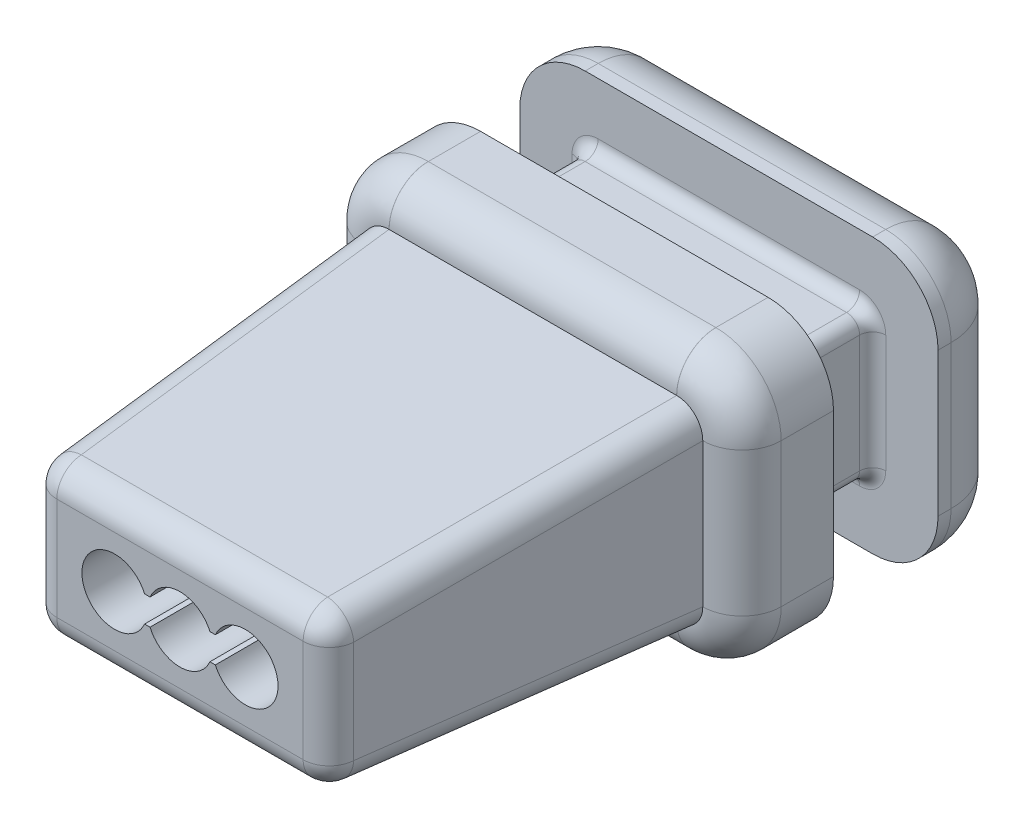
ISO-10303-21;
HEADER;
FILE_DESCRIPTION(('STEP AP214'),'2;1');
FILE_NAME('part.step','',(''),(''),'','','');
FILE_SCHEMA(('AUTOMOTIVE_DESIGN { 1 0 10303 214 1 1 1 1 }'));
ENDSEC;
DATA;
#1=APPLICATION_CONTEXT('core data for automotive mechanical design processes');
#2=APPLICATION_PROTOCOL_DEFINITION('international standard','automotive_design',2000,#1);
#3=PRODUCT_CONTEXT('',#1,'mechanical');
#4=PRODUCT('Part','Part','',(#3));
#5=PRODUCT_RELATED_PRODUCT_CATEGORY('part','',(#4));
#6=PRODUCT_DEFINITION_FORMATION('','',#4);
#7=PRODUCT_DEFINITION_CONTEXT('part definition',#1,'design');
#8=PRODUCT_DEFINITION('design','',#6,#7);
#9=PRODUCT_DEFINITION_SHAPE('','',#8);
#10=(LENGTH_UNIT() NAMED_UNIT(*) SI_UNIT(.MILLI.,.METRE.));
#11=(NAMED_UNIT(*) PLANE_ANGLE_UNIT() SI_UNIT($,.RADIAN.));
#12=(NAMED_UNIT(*) SI_UNIT($,.STERADIAN.) SOLID_ANGLE_UNIT());
#13=UNCERTAINTY_MEASURE_WITH_UNIT(LENGTH_MEASURE(1.E-05),#10,'distance_accuracy_value','');
#14=(GEOMETRIC_REPRESENTATION_CONTEXT(3) GLOBAL_UNCERTAINTY_ASSIGNED_CONTEXT((#13)) GLOBAL_UNIT_ASSIGNED_CONTEXT((#10,
#11,#12)) REPRESENTATION_CONTEXT('',''));
#15=CARTESIAN_POINT('',(0.,0.,0.));
#16=DIRECTION('',(0.,0.,1.));
#17=DIRECTION('',(1.,0.,0.));
#18=AXIS2_PLACEMENT_3D('',#15,#16,#17);
#19=CARTESIAN_POINT('',(2.2,1.1,-3.));
#20=DIRECTION('',(0.,0.,1.));
#21=DIRECTION('',(1.,0.,0.));
#22=AXIS2_PLACEMENT_3D('',#19,#20,#21);
#23=PLANE('',#22);
#24=CARTESIAN_POINT('',(2.2,1.1,-3.));
#25=DIRECTION('',(0.,0.,1.));
#26=DIRECTION('',(1.,0.,0.));
#27=AXIS2_PLACEMENT_3D('',#24,#25,#26);
#28=CIRCLE('',#27,1.);
#29=CARTESIAN_POINT('',(3.2,1.09999999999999,-3.));
#30=VERTEX_POINT('',#29);
#31=CARTESIAN_POINT('',(2.19999999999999,2.1,-3.));
#32=VERTEX_POINT('',#31);
#33=EDGE_CURVE('E468',#30,#32,#28,.T.);
#34=ORIENTED_EDGE('',*,*,#33,.T.);
#35=DIRECTION('',(-1.,0.,0.));
#36=VECTOR('',#35,1.);
#37=CARTESIAN_POINT('',(-2.19999999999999,2.1,-3.));
#38=LINE('',#37,#36);
#39=CARTESIAN_POINT('',(-2.19999999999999,2.1,-3.));
#40=VERTEX_POINT('',#39);
#41=EDGE_CURVE('E471',#32,#40,#38,.T.);
#42=ORIENTED_EDGE('',*,*,#41,.T.);
#43=CARTESIAN_POINT('',(-2.2,1.1,-3.));
#44=DIRECTION('',(0.,0.,1.));
#45=DIRECTION('',(1.,0.,0.));
#46=AXIS2_PLACEMENT_3D('',#43,#44,#45);
#47=CIRCLE('',#46,1.);
#48=CARTESIAN_POINT('',(-3.2,1.09999999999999,-3.));
#49=VERTEX_POINT('',#48);
#50=EDGE_CURVE('E475',#40,#49,#47,.T.);
#51=ORIENTED_EDGE('',*,*,#50,.T.);
#52=DIRECTION('',(0.,-1.,0.));
#53=VECTOR('',#52,1.);
#54=CARTESIAN_POINT('',(-3.2,-1.09999999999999,-3.));
#55=LINE('',#54,#53);
#56=CARTESIAN_POINT('',(-3.2,-1.09999999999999,-3.));
#57=VERTEX_POINT('',#56);
#58=EDGE_CURVE('E478',#49,#57,#55,.T.);
#59=ORIENTED_EDGE('',*,*,#58,.T.);
#60=CARTESIAN_POINT('',(-2.2,-1.1,-3.));
#61=DIRECTION('',(0.,0.,1.));
#62=DIRECTION('',(1.,0.,0.));
#63=AXIS2_PLACEMENT_3D('',#60,#61,#62);
#64=CIRCLE('',#63,1.);
#65=CARTESIAN_POINT('',(-2.19999999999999,-2.1,-3.));
#66=VERTEX_POINT('',#65);
#67=EDGE_CURVE('E481',#57,#66,#64,.T.);
#68=ORIENTED_EDGE('',*,*,#67,.T.);
#69=DIRECTION('',(1.,0.,0.));
#70=VECTOR('',#69,1.);
#71=CARTESIAN_POINT('',(2.19999999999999,-2.1,-3.));
#72=LINE('',#71,#70);
#73=CARTESIAN_POINT('',(2.19999999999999,-2.1,-3.));
#74=VERTEX_POINT('',#73);
#75=EDGE_CURVE('E484',#66,#74,#72,.T.);
#76=ORIENTED_EDGE('',*,*,#75,.T.);
#77=CARTESIAN_POINT('',(2.2,-1.1,-3.));
#78=DIRECTION('',(0.,0.,1.));
#79=DIRECTION('',(1.,0.,0.));
#80=AXIS2_PLACEMENT_3D('',#77,#78,#79);
#81=CIRCLE('',#80,1.);
#82=CARTESIAN_POINT('',(3.2,-1.09999999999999,-3.));
#83=VERTEX_POINT('',#82);
#84=EDGE_CURVE('E487',#74,#83,#81,.T.);
#85=ORIENTED_EDGE('',*,*,#84,.T.);
#86=DIRECTION('',(0.,1.,0.));
#87=VECTOR('',#86,1.);
#88=CARTESIAN_POINT('',(3.2,1.09999999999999,-3.));
#89=LINE('',#88,#87);
#90=EDGE_CURVE('E490',#83,#30,#89,.T.);
#91=ORIENTED_EDGE('',*,*,#90,.T.);
#92=EDGE_LOOP('',(#34,#42,#51,#59,#68,#76,#85,#91));
#93=FACE_BOUND('',#92,.T.);
#94=CARTESIAN_POINT('',(-2.,0.9,-3.));
#95=DIRECTION('',(0.,0.,1.));
#96=DIRECTION('',(1.,0.,0.));
#97=AXIS2_PLACEMENT_3D('',#94,#95,#96);
#98=CIRCLE('',#97,0.4);
#99=CARTESIAN_POINT('',(-2.,1.3,-3.));
#100=VERTEX_POINT('',#99);
#101=CARTESIAN_POINT('',(-2.4,0.9,-3.));
#102=VERTEX_POINT('',#101);
#103=EDGE_CURVE('E885',#100,#102,#98,.T.);
#104=ORIENTED_EDGE('',*,*,#103,.F.);
#105=DIRECTION('',(-1.,0.,0.));
#106=VECTOR('',#105,1.);
#107=CARTESIAN_POINT('',(2.2,1.3,-3.));
#108=LINE('',#107,#106);
#109=CARTESIAN_POINT('',(2.,1.3,-3.));
#110=VERTEX_POINT('',#109);
#111=EDGE_CURVE('E882',#100,#110,#108,.F.);
#112=ORIENTED_EDGE('',*,*,#111,.T.);
#113=CARTESIAN_POINT('',(2.,0.9,-3.));
#114=DIRECTION('',(0.,0.,1.));
#115=DIRECTION('',(1.,0.,0.));
#116=AXIS2_PLACEMENT_3D('',#113,#114,#115);
#117=CIRCLE('',#116,0.4);
#118=CARTESIAN_POINT('',(2.4,0.9,-3.));
#119=VERTEX_POINT('',#118);
#120=EDGE_CURVE('E880',#119,#110,#117,.T.);
#121=ORIENTED_EDGE('',*,*,#120,.F.);
#122=DIRECTION('',(0.,1.,0.));
#123=VECTOR('',#122,1.);
#124=CARTESIAN_POINT('',(2.4,-1.1,-3.));
#125=LINE('',#124,#123);
#126=CARTESIAN_POINT('',(2.4,-0.900000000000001,-3.));
#127=VERTEX_POINT('',#126);
#128=EDGE_CURVE('E878',#119,#127,#125,.F.);
#129=ORIENTED_EDGE('',*,*,#128,.T.);
#130=CARTESIAN_POINT('',(2.,-0.900000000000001,-3.));
#131=DIRECTION('',(0.,0.,1.));
#132=DIRECTION('',(1.,0.,0.));
#133=AXIS2_PLACEMENT_3D('',#130,#131,#132);
#134=CIRCLE('',#133,0.4);
#135=CARTESIAN_POINT('',(2.,-1.3,-3.));
#136=VERTEX_POINT('',#135);
#137=EDGE_CURVE('E875',#136,#127,#134,.T.);
#138=ORIENTED_EDGE('',*,*,#137,.F.);
#139=DIRECTION('',(1.,0.,0.));
#140=VECTOR('',#139,1.);
#141=CARTESIAN_POINT('',(-2.2,-1.3,-3.));
#142=LINE('',#141,#140);
#143=CARTESIAN_POINT('',(-2.,-1.3,-3.));
#144=VERTEX_POINT('',#143);
#145=EDGE_CURVE('E871',#136,#144,#142,.F.);
#146=ORIENTED_EDGE('',*,*,#145,.T.);
#147=CARTESIAN_POINT('',(-2.,-0.9,-3.));
#148=DIRECTION('',(0.,0.,1.));
#149=DIRECTION('',(1.,0.,0.));
#150=AXIS2_PLACEMENT_3D('',#147,#148,#149);
#151=CIRCLE('',#150,0.4);
#152=CARTESIAN_POINT('',(-2.4,-0.9,-3.));
#153=VERTEX_POINT('',#152);
#154=EDGE_CURVE('E868',#153,#144,#151,.T.);
#155=ORIENTED_EDGE('',*,*,#154,.F.);
#156=DIRECTION('',(0.,-1.,0.));
#157=VECTOR('',#156,1.);
#158=CARTESIAN_POINT('',(-2.4,1.1,-3.));
#159=LINE('',#158,#157);
#160=EDGE_CURVE('E873',#153,#102,#159,.F.);
#161=ORIENTED_EDGE('',*,*,#160,.T.);
#162=EDGE_LOOP('',(#104,#112,#121,#129,#138,#146,#155,#161));
#163=FACE_BOUND('',#162,.T.);
#164=ADVANCED_FACE('F36',(#93,#163),#23,.T.);
#165=CARTESIAN_POINT('',(2.2,1.1,-1.4));
#166=DIRECTION('',(0.,0.,1.));
#167=DIRECTION('',(1.,0.,0.));
#168=AXIS2_PLACEMENT_3D('',#165,#166,#167);
#169=PLANE('',#168);
#170=CARTESIAN_POINT('',(2.2,1.1,-1.4));
#171=DIRECTION('',(0.,0.,1.));
#172=DIRECTION('',(1.,0.,0.));
#173=AXIS2_PLACEMENT_3D('',#170,#171,#172);
#174=CIRCLE('',#173,1.);
#175=CARTESIAN_POINT('',(3.2,1.09999999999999,-1.4));
#176=VERTEX_POINT('',#175);
#177=CARTESIAN_POINT('',(2.19999999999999,2.1,-1.4));
#178=VERTEX_POINT('',#177);
#179=EDGE_CURVE('E456',#176,#178,#174,.T.);
#180=ORIENTED_EDGE('',*,*,#179,.F.);
#181=DIRECTION('',(0.,1.,0.));
#182=VECTOR('',#181,1.);
#183=CARTESIAN_POINT('',(3.2,1.09999999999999,-1.4));
#184=LINE('',#183,#182);
#185=CARTESIAN_POINT('',(3.2,-1.09999999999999,-1.4));
#186=VERTEX_POINT('',#185);
#187=EDGE_CURVE('E472',#186,#176,#184,.T.);
#188=ORIENTED_EDGE('',*,*,#187,.F.);
#189=CARTESIAN_POINT('',(2.2,-1.1,-1.4));
#190=DIRECTION('',(0.,0.,1.));
#191=DIRECTION('',(1.,0.,0.));
#192=AXIS2_PLACEMENT_3D('',#189,#190,#191);
#193=CIRCLE('',#192,1.);
#194=CARTESIAN_POINT('',(2.19999999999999,-2.1,-1.4));
#195=VERTEX_POINT('',#194);
#196=EDGE_CURVE('E511',#195,#186,#193,.T.);
#197=ORIENTED_EDGE('',*,*,#196,.F.);
#198=DIRECTION('',(1.,0.,0.));
#199=VECTOR('',#198,1.);
#200=CARTESIAN_POINT('',(2.19999999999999,-2.1,-1.4));
#201=LINE('',#200,#199);
#202=CARTESIAN_POINT('',(-2.19999999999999,-2.1,-1.4));
#203=VERTEX_POINT('',#202);
#204=EDGE_CURVE('E508',#203,#195,#201,.T.);
#205=ORIENTED_EDGE('',*,*,#204,.F.);
#206=CARTESIAN_POINT('',(-2.2,-1.1,-1.4));
#207=DIRECTION('',(0.,0.,1.));
#208=DIRECTION('',(1.,0.,0.));
#209=AXIS2_PLACEMENT_3D('',#206,#207,#208);
#210=CIRCLE('',#209,1.);
#211=CARTESIAN_POINT('',(-3.2,-1.09999999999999,-1.4));
#212=VERTEX_POINT('',#211);
#213=EDGE_CURVE('E505',#212,#203,#210,.T.);
#214=ORIENTED_EDGE('',*,*,#213,.F.);
#215=DIRECTION('',(0.,-1.,0.));
#216=VECTOR('',#215,1.);
#217=CARTESIAN_POINT('',(-3.2,-1.09999999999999,-1.4));
#218=LINE('',#217,#216);
#219=CARTESIAN_POINT('',(-3.2,1.09999999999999,-1.4));
#220=VERTEX_POINT('',#219);
#221=EDGE_CURVE('E502',#220,#212,#218,.T.);
#222=ORIENTED_EDGE('',*,*,#221,.F.);
#223=CARTESIAN_POINT('',(-2.2,1.1,-1.4));
#224=DIRECTION('',(0.,0.,1.));
#225=DIRECTION('',(1.,0.,0.));
#226=AXIS2_PLACEMENT_3D('',#223,#224,#225);
#227=CIRCLE('',#226,1.);
#228=CARTESIAN_POINT('',(-2.19999999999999,2.1,-1.4));
#229=VERTEX_POINT('',#228);
#230=EDGE_CURVE('E499',#229,#220,#227,.T.);
#231=ORIENTED_EDGE('',*,*,#230,.F.);
#232=DIRECTION('',(-1.,0.,0.));
#233=VECTOR('',#232,1.);
#234=CARTESIAN_POINT('',(-2.19999999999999,2.1,-1.4));
#235=LINE('',#234,#233);
#236=EDGE_CURVE('E496',#178,#229,#235,.T.);
#237=ORIENTED_EDGE('',*,*,#236,.F.);
#238=EDGE_LOOP('',(#180,#188,#197,#205,#214,#222,#231,#237));
#239=FACE_BOUND('',#238,.T.);
#240=CARTESIAN_POINT('',(-2.,-0.9,-1.4));
#241=DIRECTION('',(0.,0.,1.));
#242=DIRECTION('',(1.,0.,0.));
#243=AXIS2_PLACEMENT_3D('',#240,#241,#242);
#244=CIRCLE('',#243,0.4);
#245=CARTESIAN_POINT('',(-2.,-1.3,-1.4));
#246=VERTEX_POINT('',#245);
#247=CARTESIAN_POINT('',(-2.4,-0.9,-1.4));
#248=VERTEX_POINT('',#247);
#249=EDGE_CURVE('E847',#246,#248,#244,.F.);
#250=ORIENTED_EDGE('',*,*,#249,.F.);
#251=DIRECTION('',(1.,0.,0.));
#252=VECTOR('',#251,1.);
#253=CARTESIAN_POINT('',(2.2,-1.3,-1.4));
#254=LINE('',#253,#252);
#255=CARTESIAN_POINT('',(2.,-1.3,-1.4));
#256=VERTEX_POINT('',#255);
#257=EDGE_CURVE('E844',#246,#256,#254,.T.);
#258=ORIENTED_EDGE('',*,*,#257,.T.);
#259=CARTESIAN_POINT('',(2.,-0.900000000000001,-1.4));
#260=DIRECTION('',(0.,0.,1.));
#261=DIRECTION('',(1.,0.,0.));
#262=AXIS2_PLACEMENT_3D('',#259,#260,#261);
#263=CIRCLE('',#262,0.4);
#264=CARTESIAN_POINT('',(2.4,-0.900000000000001,-1.4));
#265=VERTEX_POINT('',#264);
#266=EDGE_CURVE('E841',#265,#256,#263,.F.);
#267=ORIENTED_EDGE('',*,*,#266,.F.);
#268=DIRECTION('',(0.,1.,0.));
#269=VECTOR('',#268,1.);
#270=CARTESIAN_POINT('',(2.4,1.1,-1.4));
#271=LINE('',#270,#269);
#272=CARTESIAN_POINT('',(2.4,0.9,-1.4));
#273=VERTEX_POINT('',#272);
#274=EDGE_CURVE('E839',#265,#273,#271,.T.);
#275=ORIENTED_EDGE('',*,*,#274,.T.);
#276=CARTESIAN_POINT('',(2.,0.9,-1.4));
#277=DIRECTION('',(0.,0.,1.));
#278=DIRECTION('',(1.,0.,0.));
#279=AXIS2_PLACEMENT_3D('',#276,#277,#278);
#280=CIRCLE('',#279,0.4);
#281=CARTESIAN_POINT('',(2.,1.3,-1.4));
#282=VERTEX_POINT('',#281);
#283=EDGE_CURVE('E836',#282,#273,#280,.F.);
#284=ORIENTED_EDGE('',*,*,#283,.F.);
#285=DIRECTION('',(-1.,0.,0.));
#286=VECTOR('',#285,1.);
#287=CARTESIAN_POINT('',(2.2,1.3,-1.4));
#288=LINE('',#287,#286);
#289=CARTESIAN_POINT('',(-2.,1.3,-1.4));
#290=VERTEX_POINT('',#289);
#291=EDGE_CURVE('E832',#282,#290,#288,.T.);
#292=ORIENTED_EDGE('',*,*,#291,.T.);
#293=CARTESIAN_POINT('',(-2.,0.9,-1.4));
#294=DIRECTION('',(0.,0.,1.));
#295=DIRECTION('',(1.,0.,0.));
#296=AXIS2_PLACEMENT_3D('',#293,#294,#295);
#297=CIRCLE('',#296,0.4);
#298=CARTESIAN_POINT('',(-2.4,0.9,-1.4));
#299=VERTEX_POINT('',#298);
#300=EDGE_CURVE('E806',#299,#290,#297,.F.);
#301=ORIENTED_EDGE('',*,*,#300,.F.);
#302=DIRECTION('',(0.,-1.,0.));
#303=VECTOR('',#302,1.);
#304=CARTESIAN_POINT('',(-2.4,1.1,-1.4));
#305=LINE('',#304,#303);
#306=EDGE_CURVE('E834',#299,#248,#305,.T.);
#307=ORIENTED_EDGE('',*,*,#306,.T.);
#308=EDGE_LOOP('',(#250,#258,#267,#275,#284,#292,#301,#307));
#309=FACE_BOUND('',#308,.T.);
#310=ADVANCED_FACE('F1017',(#239,#309),#169,.F.);
#311=CARTESIAN_POINT('',(-2.6,-1.5,0.));
#312=DIRECTION('',(-0.998026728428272,0.,0.0627905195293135));
#313=DIRECTION('',(0.0627905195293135,0.,0.998026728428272));
#314=AXIS2_PLACEMENT_3D('',#311,#312,#313);
#315=PLANE('',#314);
#316=DIRECTION('',(0.,-1.,0.));
#317=VECTOR('',#316,1.);
#318=CARTESIAN_POINT('',(-2.2838464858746,-1.5,5.02511620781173));
#319=LINE('',#318,#317);
#320=CARTESIAN_POINT('',(-2.2838464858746,-0.784635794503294,5.02511620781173));
#321=VERTEX_POINT('',#320);
#322=CARTESIAN_POINT('',(-2.2838464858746,0.784635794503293,5.02511620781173));
#323=VERTEX_POINT('',#322);
#324=EDGE_CURVE('E759',#321,#323,#319,.F.);
#325=ORIENTED_EDGE('',*,*,#324,.T.);
#326=DIRECTION('',(0.0626671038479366,-0.0626671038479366,0.99606509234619));
#327=VECTOR('',#326,1.);
#328=CARTESIAN_POINT('',(-2.58978626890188,1.09057557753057,0.162342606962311));
#329=LINE('',#328,#327);
#330=CARTESIAN_POINT('',(-2.6,1.10078930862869,0.));
#331=VERTEX_POINT('',#330);
#332=EDGE_CURVE('E750',#323,#331,#329,.F.);
#333=ORIENTED_EDGE('',*,*,#332,.T.);
#334=DIRECTION('',(0.,-1.,0.));
#335=VECTOR('',#334,1.);
#336=CARTESIAN_POINT('',(-2.6,-1.5,0.));
#337=LINE('',#336,#335);
#338=CARTESIAN_POINT('',(-2.6,-1.10000000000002,0.));
#339=VERTEX_POINT('',#338);
#340=EDGE_CURVE('E1313',#331,#339,#337,.T.);
#341=ORIENTED_EDGE('',*,*,#340,.T.);
#342=DIRECTION('',(0.0626671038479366,0.0626671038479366,0.99606509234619));
#343=VECTOR('',#342,1.);
#344=CARTESIAN_POINT('',(-2.60156776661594,-1.10235707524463,-0.0249189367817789));
#345=LINE('',#344,#343);
#346=EDGE_CURVE('E1136',#339,#321,#345,.T.);
#347=ORIENTED_EDGE('',*,*,#346,.T.);
#348=EDGE_LOOP('',(#325,#333,#341,#347));
#349=FACE_BOUND('',#348,.T.);
#350=ADVANCED_FACE('F1023',(#349),#315,.T.);
#351=CARTESIAN_POINT('',(-2.6,-1.5,0.));
#352=DIRECTION('',(0.,-0.998026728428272,0.0627905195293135));
#353=DIRECTION('',(0.,-0.0627905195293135,-0.998026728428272));
#354=AXIS2_PLACEMENT_3D('',#351,#352,#353);
#355=PLANE('',#354);
#356=DIRECTION('',(1.,0.,0.));
#357=VECTOR('',#356,1.);
#358=CARTESIAN_POINT('',(-2.6,-1.5,0.));
#359=LINE('',#358,#357);
#360=CARTESIAN_POINT('',(-2.20078930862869,-1.5,0.));
#361=VERTEX_POINT('',#360);
#362=CARTESIAN_POINT('',(-2.19999999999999,-1.5,0.));
#363=VERTEX_POINT('',#362);
#364=EDGE_CURVE('E1189',#361,#363,#359,.T.);
#365=ORIENTED_EDGE('',*,*,#364,.T.);
#366=CARTESIAN_POINT('',(2.19999999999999,-1.5,0.));
#367=VERTEX_POINT('',#366);
#368=EDGE_CURVE('E1193',#363,#367,#359,.T.);
#369=ORIENTED_EDGE('',*,*,#368,.T.);
#370=CARTESIAN_POINT('',(2.20078930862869,-1.5,0.));
#371=VERTEX_POINT('',#370);
#372=EDGE_CURVE('E1194',#367,#371,#359,.T.);
#373=ORIENTED_EDGE('',*,*,#372,.T.);
#374=DIRECTION('',(-0.0626671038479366,0.0626671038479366,0.99606509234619));
#375=VECTOR('',#374,1.);
#376=CARTESIAN_POINT('',(2.18193581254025,-1.48114650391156,0.29966773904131));
#377=LINE('',#376,#375);
#378=CARTESIAN_POINT('',(1.88463579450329,-1.1838464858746,5.02511620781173));
#379=VERTEX_POINT('',#378);
#380=EDGE_CURVE('E1134',#371,#379,#377,.T.);
#381=ORIENTED_EDGE('',*,*,#380,.T.);
#382=DIRECTION('',(1.,0.,0.));
#383=VECTOR('',#382,1.);
#384=CARTESIAN_POINT('',(-2.6,-1.1838464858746,5.02511620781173));
#385=LINE('',#384,#383);
#386=CARTESIAN_POINT('',(-1.88463579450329,-1.1838464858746,5.02511620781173));
#387=VERTEX_POINT('',#386);
#388=EDGE_CURVE('E1114',#379,#387,#385,.F.);
#389=ORIENTED_EDGE('',*,*,#388,.T.);
#390=DIRECTION('',(0.0626671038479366,0.0626671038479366,0.99606509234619));
#391=VECTOR('',#390,1.);
#392=CARTESIAN_POINT('',(-2.20235707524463,-1.50156776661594,-0.0249189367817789));
#393=LINE('',#392,#391);
#394=EDGE_CURVE('E1131',#387,#361,#393,.F.);
#395=ORIENTED_EDGE('',*,*,#394,.T.);
#396=EDGE_LOOP('',(#365,#369,#373,#381,#389,#395));
#397=FACE_BOUND('',#396,.T.);
#398=ADVANCED_FACE('F1394',(#397),#355,.T.);
#399=CARTESIAN_POINT('',(2.6,-1.5,0.));
#400=DIRECTION('',(0.998026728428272,0.,0.0627905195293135));
#401=DIRECTION('',(0.0627905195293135,0.,-0.998026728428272));
#402=AXIS2_PLACEMENT_3D('',#399,#400,#401);
#403=PLANE('',#402);
#404=DIRECTION('',(0.,1.,0.));
#405=VECTOR('',#404,1.);
#406=CARTESIAN_POINT('',(2.6,-1.5,0.));
#407=LINE('',#406,#405);
#408=CARTESIAN_POINT('',(2.6,-1.10078930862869,0.));
#409=VERTEX_POINT('',#408);
#410=CARTESIAN_POINT('',(2.6,1.10000000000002,0.));
#411=VERTEX_POINT('',#410);
#412=EDGE_CURVE('E1187',#409,#411,#407,.T.);
#413=ORIENTED_EDGE('',*,*,#412,.T.);
#414=DIRECTION('',(-0.0626671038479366,-0.0626671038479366,0.99606509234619));
#415=VECTOR('',#414,1.);
#416=CARTESIAN_POINT('',(2.58978626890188,1.09057557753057,0.162342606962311));
#417=LINE('',#416,#415);
#418=CARTESIAN_POINT('',(2.2838464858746,0.784635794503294,5.02511620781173));
#419=VERTEX_POINT('',#418);
#420=EDGE_CURVE('E1130',#411,#419,#417,.T.);
#421=ORIENTED_EDGE('',*,*,#420,.T.);
#422=DIRECTION('',(0.,1.,0.));
#423=VECTOR('',#422,1.);
#424=CARTESIAN_POINT('',(2.2838464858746,-1.5,5.02511620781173));
#425=LINE('',#424,#423);
#426=CARTESIAN_POINT('',(2.2838464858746,-0.784635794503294,5.02511620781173));
#427=VERTEX_POINT('',#426);
#428=EDGE_CURVE('E771',#419,#427,#425,.F.);
#429=ORIENTED_EDGE('',*,*,#428,.T.);
#430=DIRECTION('',(-0.0626671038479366,0.0626671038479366,0.99606509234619));
#431=VECTOR('',#430,1.);
#432=CARTESIAN_POINT('',(2.60156776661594,-1.10235707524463,-0.0249189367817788));
#433=LINE('',#432,#431);
#434=EDGE_CURVE('E769',#427,#409,#433,.F.);
#435=ORIENTED_EDGE('',*,*,#434,.T.);
#436=EDGE_LOOP('',(#413,#421,#429,#435));
#437=FACE_BOUND('',#436,.T.);
#438=ADVANCED_FACE('F1641',(#437),#403,.T.);
#439=CARTESIAN_POINT('',(-2.6,1.5,0.));
#440=DIRECTION('',(0.,0.998026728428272,0.0627905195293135));
#441=DIRECTION('',(0.,-0.0627905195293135,0.998026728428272));
#442=AXIS2_PLACEMENT_3D('',#439,#440,#441);
#443=PLANE('',#442);
#444=DIRECTION('',(-1.,0.,0.));
#445=VECTOR('',#444,1.);
#446=CARTESIAN_POINT('',(-2.6,1.5,0.));
#447=LINE('',#446,#445);
#448=CARTESIAN_POINT('',(2.20078930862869,1.5,0.));
#449=VERTEX_POINT('',#448);
#450=CARTESIAN_POINT('',(2.19999999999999,1.5,0.));
#451=VERTEX_POINT('',#450);
#452=EDGE_CURVE('E1180',#449,#451,#447,.T.);
#453=ORIENTED_EDGE('',*,*,#452,.T.);
#454=CARTESIAN_POINT('',(-2.19999999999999,1.5,0.));
#455=VERTEX_POINT('',#454);
#456=EDGE_CURVE('E1183',#451,#455,#447,.T.);
#457=ORIENTED_EDGE('',*,*,#456,.T.);
#458=CARTESIAN_POINT('',(-2.20078930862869,1.5,0.));
#459=VERTEX_POINT('',#458);
#460=EDGE_CURVE('E1185',#455,#459,#447,.T.);
#461=ORIENTED_EDGE('',*,*,#460,.T.);
#462=DIRECTION('',(0.0626671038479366,-0.0626671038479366,0.99606509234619));
#463=VECTOR('',#462,1.);
#464=CARTESIAN_POINT('',(-2.20235707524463,1.50156776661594,-0.0249189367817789));
#465=LINE('',#464,#463);
#466=CARTESIAN_POINT('',(-1.88463579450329,1.1838464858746,5.02511620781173));
#467=VERTEX_POINT('',#466);
#468=EDGE_CURVE('E766',#459,#467,#465,.T.);
#469=ORIENTED_EDGE('',*,*,#468,.T.);
#470=DIRECTION('',(-1.,0.,0.));
#471=VECTOR('',#470,1.);
#472=CARTESIAN_POINT('',(-2.6,1.1838464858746,5.02511620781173));
#473=LINE('',#472,#471);
#474=CARTESIAN_POINT('',(1.88463579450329,1.1838464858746,5.02511620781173));
#475=VERTEX_POINT('',#474);
#476=EDGE_CURVE('E1139',#467,#475,#473,.F.);
#477=ORIENTED_EDGE('',*,*,#476,.T.);
#478=DIRECTION('',(-0.0626671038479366,-0.0626671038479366,0.99606509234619));
#479=VECTOR('',#478,1.);
#480=CARTESIAN_POINT('',(2.18193581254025,1.48114650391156,0.29966773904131));
#481=LINE('',#480,#479);
#482=EDGE_CURVE('E758',#475,#449,#481,.F.);
#483=ORIENTED_EDGE('',*,*,#482,.T.);
#484=EDGE_LOOP('',(#453,#457,#461,#469,#477,#483));
#485=FACE_BOUND('',#484,.T.);
#486=ADVANCED_FACE('F1161',(#485),#443,.T.);
#487=CARTESIAN_POINT('',(-2.6,-1.5,5.4));
#488=DIRECTION('',(0.,0.,-1.));
#489=DIRECTION('',(-1.,0.,0.));
#490=AXIS2_PLACEMENT_3D('',#487,#488,#489);
#491=PLANE('',#490);
#492=DIRECTION('',(-1.,0.,0.));
#493=VECTOR('',#492,1.);
#494=CARTESIAN_POINT('',(-2.6,-0.784635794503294,5.4));
#495=LINE('',#494,#493);
#496=CARTESIAN_POINT('',(-1.88463579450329,-0.784635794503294,5.4));
#497=VERTEX_POINT('',#496);
#498=CARTESIAN_POINT('',(1.88463579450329,-0.784635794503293,5.4));
#499=VERTEX_POINT('',#498);
#500=EDGE_CURVE('E1116',#497,#499,#495,.F.);
#501=ORIENTED_EDGE('',*,*,#500,.T.);
#502=DIRECTION('',(0.,-1.,0.));
#503=VECTOR('',#502,1.);
#504=CARTESIAN_POINT('',(1.88463579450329,-1.5,5.4));
#505=LINE('',#504,#503);
#506=CARTESIAN_POINT('',(1.88463579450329,0.784635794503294,5.4));
#507=VERTEX_POINT('',#506);
#508=EDGE_CURVE('E772',#499,#507,#505,.F.);
#509=ORIENTED_EDGE('',*,*,#508,.T.);
#510=DIRECTION('',(1.,0.,0.));
#511=VECTOR('',#510,1.);
#512=CARTESIAN_POINT('',(-2.6,0.784635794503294,5.4));
#513=LINE('',#512,#511);
#514=CARTESIAN_POINT('',(-1.88463579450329,0.784635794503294,5.4));
#515=VERTEX_POINT('',#514);
#516=EDGE_CURVE('E1124',#507,#515,#513,.F.);
#517=ORIENTED_EDGE('',*,*,#516,.T.);
#518=DIRECTION('',(0.,1.,0.));
#519=VECTOR('',#518,1.);
#520=CARTESIAN_POINT('',(-1.88463579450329,-1.5,5.4));
#521=LINE('',#520,#519);
#522=EDGE_CURVE('E1089',#515,#497,#521,.F.);
#523=ORIENTED_EDGE('',*,*,#522,.T.);
#524=EDGE_LOOP('',(#501,#509,#517,#523));
#525=FACE_BOUND('',#524,.T.);
#526=DIRECTION('',(-1.,0.,0.));
#527=VECTOR('',#526,1.);
#528=CARTESIAN_POINT('',(-0.458257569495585,0.199999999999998,5.4));
#529=LINE('',#528,#527);
#530=CARTESIAN_POINT('',(-0.458257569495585,0.199999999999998,5.4));
#531=VERTEX_POINT('',#530);
#532=CARTESIAN_POINT('',(-0.541742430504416,0.2,5.4));
#533=VERTEX_POINT('',#532);
#534=EDGE_CURVE('E437',#531,#533,#529,.T.);
#535=ORIENTED_EDGE('',*,*,#534,.F.);
#536=CARTESIAN_POINT('',(0.,0.,5.4));
#537=DIRECTION('',(0.,0.,1.));
#538=DIRECTION('',(1.,0.,0.));
#539=AXIS2_PLACEMENT_3D('',#536,#537,#538);
#540=CIRCLE('',#539,0.5);
#541=CARTESIAN_POINT('',(0.458257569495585,0.199999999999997,5.4));
#542=VERTEX_POINT('',#541);
#543=EDGE_CURVE('E399',#542,#531,#540,.T.);
#544=ORIENTED_EDGE('',*,*,#543,.F.);
#545=DIRECTION('',(-1.,0.,0.));
#546=VECTOR('',#545,1.);
#547=CARTESIAN_POINT('',(0.458257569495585,0.199999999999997,5.4));
#548=LINE('',#547,#546);
#549=CARTESIAN_POINT('',(0.541742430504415,0.199999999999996,5.4));
#550=VERTEX_POINT('',#549);
#551=EDGE_CURVE('E417',#550,#542,#548,.T.);
#552=ORIENTED_EDGE('',*,*,#551,.F.);
#553=CARTESIAN_POINT('',(1.,0.,5.4));
#554=DIRECTION('',(0.,0.,1.));
#555=DIRECTION('',(1.,0.,0.));
#556=AXIS2_PLACEMENT_3D('',#553,#554,#555);
#557=CIRCLE('',#556,0.5);
#558=CARTESIAN_POINT('',(0.541742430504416,-0.200000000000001,5.4));
#559=VERTEX_POINT('',#558);
#560=EDGE_CURVE('E420',#559,#550,#557,.T.);
#561=ORIENTED_EDGE('',*,*,#560,.F.);
#562=DIRECTION('',(1.,0.,0.));
#563=VECTOR('',#562,1.);
#564=CARTESIAN_POINT('',(0.458257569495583,-0.200000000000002,5.4));
#565=LINE('',#564,#563);
#566=CARTESIAN_POINT('',(0.458257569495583,-0.200000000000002,5.4));
#567=VERTEX_POINT('',#566);
#568=EDGE_CURVE('E449',#567,#559,#565,.T.);
#569=ORIENTED_EDGE('',*,*,#568,.F.);
#570=CARTESIAN_POINT('',(0.,0.,5.4));
#571=DIRECTION('',(0.,0.,1.));
#572=DIRECTION('',(1.,0.,0.));
#573=AXIS2_PLACEMENT_3D('',#570,#571,#572);
#574=CIRCLE('',#573,0.5);
#575=CARTESIAN_POINT('',(-0.458257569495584,-0.199999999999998,5.4));
#576=VERTEX_POINT('',#575);
#577=EDGE_CURVE('E446',#576,#567,#574,.T.);
#578=ORIENTED_EDGE('',*,*,#577,.F.);
#579=DIRECTION('',(1.,0.,0.));
#580=VECTOR('',#579,1.);
#581=CARTESIAN_POINT('',(-0.541742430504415,-0.199999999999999,5.4));
#582=LINE('',#581,#580);
#583=CARTESIAN_POINT('',(-0.541742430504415,-0.199999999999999,5.4));
#584=VERTEX_POINT('',#583);
#585=EDGE_CURVE('E443',#584,#576,#582,.T.);
#586=ORIENTED_EDGE('',*,*,#585,.F.);
#587=CARTESIAN_POINT('',(-1.,0.,5.4));
#588=DIRECTION('',(0.,0.,1.));
#589=DIRECTION('',(1.,0.,0.));
#590=AXIS2_PLACEMENT_3D('',#587,#588,#589);
#591=CIRCLE('',#590,0.500000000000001);
#592=EDGE_CURVE('E440',#533,#584,#591,.T.);
#593=ORIENTED_EDGE('',*,*,#592,.F.);
#594=EDGE_LOOP('',(#535,#544,#552,#561,#569,#578,#586,#593));
#595=FACE_BOUND('',#594,.T.);
#596=ADVANCED_FACE('F1625',(#525,#595),#491,.F.);
#597=CARTESIAN_POINT('',(-2.2,1.1,-4.2));
#598=DIRECTION('',(0.,0.,1.));
#599=DIRECTION('',(1.,0.,0.));
#600=AXIS2_PLACEMENT_3D('',#597,#598,#599);
#601=CYLINDRICAL_SURFACE('',#600,1.);
#602=DIRECTION('',(0.,0.,1.));
#603=VECTOR('',#602,1.);
#604=CARTESIAN_POINT('',(-3.2,1.09999999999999,-4.2));
#605=LINE('',#604,#603);
#606=CARTESIAN_POINT('',(-3.2,1.09999999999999,-0.6));
#607=VERTEX_POINT('',#606);
#608=EDGE_CURVE('E493',#220,#607,#605,.T.);
#609=ORIENTED_EDGE('',*,*,#608,.T.);
#610=CARTESIAN_POINT('',(-1.99293956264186,2.07832815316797,-0.599999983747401));
#611=CARTESIAN_POINT('',(-1.99293974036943,2.07832819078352,0.000139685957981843));
#612=CARTESIAN_POINT('',(-2.11720491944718,1.49119467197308,0.));
#613=CARTESIAN_POINT('',(-2.02725198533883,2.08559356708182,-0.599999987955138));
#614=CARTESIAN_POINT('',(-2.02725154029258,2.08559342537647,0.000121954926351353));
#615=CARTESIAN_POINT('',(-2.13092128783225,1.49411707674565,0.));
#616=CARTESIAN_POINT('',(-2.06193217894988,2.09104349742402,-0.599999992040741));
#617=CARTESIAN_POINT('',(-2.06193162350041,2.09104343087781,0.000100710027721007));
#618=CARTESIAN_POINT('',(-2.14478607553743,1.49631752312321,0.));
#619=CARTESIAN_POINT('',(-2.13172817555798,2.09828401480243,-0.599999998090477));
#620=CARTESIAN_POINT('',(-2.13172760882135,2.09828396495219,5.32097373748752E-05));
#621=CARTESIAN_POINT('',(-2.17269420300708,1.49926043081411,0.));
#622=CARTESIAN_POINT('',(-2.1668445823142,2.10006878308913,-0.600000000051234));
#623=CARTESIAN_POINT('',(-2.1668438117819,2.10006879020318,2.69468442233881E-05));
#624=CARTESIAN_POINT('',(-2.18673779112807,1.50000057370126,0.));
#625=CARTESIAN_POINT('',(-2.2581605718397,2.09988492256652,-0.599999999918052));
#626=CARTESIAN_POINT('',(-2.25815842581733,2.09988491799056,-4.51223783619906E-05));
#627=CARTESIAN_POINT('',(-2.2232642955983,1.49999908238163,0.));
#628=CARTESIAN_POINT('',(-2.3143792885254,2.09502485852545,-0.599999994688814));
#629=CARTESIAN_POINT('',(-2.31437691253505,2.0950252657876,-9.32071471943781E-05));
#630=CARTESIAN_POINT('',(-2.24575956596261,1.49810318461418,0.));
#631=CARTESIAN_POINT('',(-2.42521515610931,2.0759331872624,-0.599999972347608));
#632=CARTESIAN_POINT('',(-2.42521256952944,2.07593363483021,-0.000187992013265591));
#633=CARTESIAN_POINT('',(-2.29012538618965,1.49055731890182,0.));
#634=CARTESIAN_POINT('',(-2.47983132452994,2.06169595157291,-0.599999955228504));
#635=CARTESIAN_POINT('',(-2.47982901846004,2.06169674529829,-0.000234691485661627));
#636=CARTESIAN_POINT('',(-2.3119955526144,1.48490509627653,0.));
#637=CARTESIAN_POINT('',(-2.58585041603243,2.02427006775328,-0.599999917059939));
#638=CARTESIAN_POINT('',(-2.58584803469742,2.0242709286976,-0.00031867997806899));
#639=CARTESIAN_POINT('',(-2.35446043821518,1.47000371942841,0.));
#640=CARTESIAN_POINT('',(-2.63725644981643,2.00109024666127,-0.599999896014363));
#641=CARTESIAN_POINT('',(-2.63725475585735,2.00109116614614,-0.000355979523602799));
#642=CARTESIAN_POINT('',(-2.37505639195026,1.46075811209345,0.));
#643=CARTESIAN_POINT('',(-2.73551699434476,1.9463970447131,-0.599999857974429));
#644=CARTESIAN_POINT('',(-2.73551537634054,1.94639796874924,-0.000415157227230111));
#645=CARTESIAN_POINT('',(-2.41442740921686,1.43891150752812,0.));
#646=CARTESIAN_POINT('',(-2.78236517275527,1.91487228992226,-0.599999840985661));
#647=CARTESIAN_POINT('',(-2.78236444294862,1.91487286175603,-0.000437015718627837));
#648=CARTESIAN_POINT('',(-2.43319993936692,1.42630593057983,0.));
#649=CARTESIAN_POINT('',(-2.87006972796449,1.84442460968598,-0.599999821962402));
#650=CARTESIAN_POINT('',(-2.87006916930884,1.84442507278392,-0.000461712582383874));
#651=CARTESIAN_POINT('',(-2.46833685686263,1.3981143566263,0.));
#652=CARTESIAN_POINT('',(-2.91093018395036,1.80550676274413,-0.599999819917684));
#653=CARTESIAN_POINT('',(-2.91093041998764,1.80550650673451,-0.000464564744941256));
#654=CARTESIAN_POINT('',(-2.48470288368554,1.38253040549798,0.));
#655=CARTESIAN_POINT('',(-2.9855373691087,1.72136356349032,-0.599999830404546));
#656=CARTESIAN_POINT('',(-2.98553774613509,1.72136312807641,-0.000450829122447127));
#657=CARTESIAN_POINT('',(-2.51456977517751,1.34882528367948,0.));
#658=CARTESIAN_POINT('',(-3.01928409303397,1.67613820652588,-0.599999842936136));
#659=CARTESIAN_POINT('',(-3.01928494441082,1.67613687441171,-0.000434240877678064));
#660=CARTESIAN_POINT('',(-2.52807063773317,1.33070411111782,0.));
#661=CARTESIAN_POINT('',(-3.078725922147,1.58063139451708,-0.599999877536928));
#662=CARTESIAN_POINT('',(-3.07872680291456,1.58062994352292,-0.000384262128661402));
#663=CARTESIAN_POINT('',(-2.55182925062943,1.29243571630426,0.));
#664=CARTESIAN_POINT('',(-3.1044155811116,1.53034654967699,-0.599999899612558));
#665=CARTESIAN_POINT('',(-3.10441651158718,1.53034433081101,-0.000350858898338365));
#666=CARTESIAN_POINT('',(-2.56208480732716,1.27228713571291,0.));
#667=CARTESIAN_POINT('',(-3.14695345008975,1.42624628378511,-0.599999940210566));
#668=CARTESIAN_POINT('',(-3.1469543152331,1.42624410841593,-0.000272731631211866));
#669=CARTESIAN_POINT('',(-2.57904076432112,1.23058501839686,0.));
#670=CARTESIAN_POINT('',(-3.16381353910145,1.37243571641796,-0.599999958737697));
#671=CARTESIAN_POINT('',(-3.16381412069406,1.37243312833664,-0.000228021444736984));
#672=CARTESIAN_POINT('',(-2.58574594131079,1.20903341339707,0.));
#673=CARTESIAN_POINT('',(-3.18827308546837,1.26271691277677,-0.599999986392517));
#674=CARTESIAN_POINT('',(-3.18827361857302,1.26271450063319,-0.000134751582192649));
#675=CARTESIAN_POINT('',(-2.59544306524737,1.16510585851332,0.));
#676=CARTESIAN_POINT('',(-3.19586716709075,1.20680747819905,-0.599999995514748));
#677=CARTESIAN_POINT('',(-3.19586729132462,1.20680514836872,-8.61890970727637E-05));
#678=CARTESIAN_POINT('',(-2.59843285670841,1.14272943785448,0.));
#679=CARTESIAN_POINT('',(-3.20156561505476,1.09449544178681,-0.600000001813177));
#680=CARTESIAN_POINT('',(-3.20156571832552,1.09449328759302,6.11688112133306E-06));
#681=CARTESIAN_POINT('',(-2.60062024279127,1.09779562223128,0.));
#682=CARTESIAN_POINT('',(-3.19966817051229,1.03809274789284,-0.599999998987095));
#683=CARTESIAN_POINT('',(-3.19966790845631,1.03809110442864,4.98587078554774E-05));
#684=CARTESIAN_POINT('',(-2.5998171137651,1.07523819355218,0.));
#685=CARTESIAN_POINT('',(-3.18642184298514,0.92643652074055,-0.599999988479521));
#686=CARTESIAN_POINT('',(-3.18642173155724,0.926435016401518,0.000123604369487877));
#687=CARTESIAN_POINT('',(-2.59444669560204,1.03059421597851,0.));
#688=CARTESIAN_POINT('',(-3.1750773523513,0.871182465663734,-0.599999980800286));
#689=CARTESIAN_POINT('',(-3.17507732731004,0.871181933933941,0.000153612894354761));
#690=CARTESIAN_POINT('',(-2.58988115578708,1.00850745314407,0.));
#691=CARTESIAN_POINT('',(-3.14330706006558,0.763307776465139,-0.599999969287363));
#692=CARTESIAN_POINT('',(-3.14330665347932,0.763306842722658,0.000192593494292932));
#693=CARTESIAN_POINT('',(-2.57714071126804,0.965386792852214,0.));
#694=CARTESIAN_POINT('',(-3.12287455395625,0.710689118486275,-0.599999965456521));
#695=CARTESIAN_POINT('',(-3.12287394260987,0.710688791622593,0.000201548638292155));
#696=CARTESIAN_POINT('',(-2.56896314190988,0.944353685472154,0.));
#697=CARTESIAN_POINT('',(-3.09808904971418,0.660186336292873,-0.599999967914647));
#698=CARTESIAN_POINT('',(-3.09808903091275,0.660186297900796,0.000196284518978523));
#699=CARTESIAN_POINT('',(-2.5590593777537,0.92416079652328,0.));
#700=(BOUNDED_SURFACE() B_SPLINE_SURFACE(3,2,((#610,#611,#612),(#613,#614,#615),(#616,#617,
#618),(#619,#620,#621),(#622,#623,#624),(#625,#626,#627),(#628,#629,#630),(#631,#632,#633),
(#634,#635,#636),(#637,#638,#639),(#640,#641,#642),(#643,#644,#645),(#646,#647,#648),(#649,#650,
#651),(#652,#653,#654),(#655,#656,#657),(#658,#659,#660),(#661,#662,#663),(#664,#665,#666),
(#667,#668,#669),(#670,#671,#672),(#673,#674,#675),(#676,#677,#678),(#679,#680,#681),(#682,#683,
#684),(#685,#686,#687),(#688,#689,#690),(#691,#692,#693),(#694,#695,#696),(#697,#698,#699)),
.UNSPECIFIED.,.F.,.F.,.F.) B_SPLINE_SURFACE_WITH_KNOTS((4,2,2,2,2,2,2,2,2,2,2,2,2,2,4),(3,3),
(0.,0.0420557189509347,0.0841781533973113,0.151551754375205,0.218965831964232,0.28631353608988,
0.353753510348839,0.421147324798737,0.488541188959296,0.555980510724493,0.623328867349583,
0.690716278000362,0.758116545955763,0.825485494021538,0.892904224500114),(0.,1.),
.UNSPECIFIED.) GEOMETRIC_REPRESENTATION_ITEM() RATIONAL_B_SPLINE_SURFACE(((1.,0.707024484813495,
1.),(1.,0.707034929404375,1.),(1.,0.707047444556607,1.),(1.,0.707075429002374,1.),(1.,
0.707090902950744,1.),(1.,0.707133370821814,1.),(1.,0.707161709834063,1.),(1.,0.70721758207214,
1.),(1.,0.707245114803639,1.),(1.,0.70729463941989,1.),(1.,0.707316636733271,1.),(1.,
0.707351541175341,1.),(1.,0.707364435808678,1.),(1.,0.707379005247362,1.),(1.,0.707380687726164,
1.),(1.,0.707372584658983,1.),(1.,0.707362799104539,1.),(1.,0.707333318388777,1.),(1.,
0.707313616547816,1.),(1.,0.707267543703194,1.),(1.,0.707241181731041,1.),(1.,0.70718619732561,
1.),(1.,0.7071575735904,1.),(1.,0.707103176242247,1.),(1.,0.707077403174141,1.),(1.,
0.707033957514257,1.),(1.,0.707016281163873,1.),(1.,0.706993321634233,1.),(1.,0.706988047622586,
1.),(1.,0.706991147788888,1.))) REPRESENTATION_ITEM('') SURFACE());
#701=CARTESIAN_POINT('',(-3.09808904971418,0.660186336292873,-0.599999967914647));
#702=CARTESIAN_POINT('',(-3.12287455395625,0.710689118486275,-0.599999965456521));
#703=CARTESIAN_POINT('',(-3.14330706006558,0.763307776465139,-0.599999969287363));
#704=CARTESIAN_POINT('',(-3.1750773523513,0.871182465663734,-0.599999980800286));
#705=CARTESIAN_POINT('',(-3.18642184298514,0.92643652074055,-0.599999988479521));
#706=CARTESIAN_POINT('',(-3.19966817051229,1.03809274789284,-0.599999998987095));
#707=CARTESIAN_POINT('',(-3.20156561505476,1.09449544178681,-0.600000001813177));
#708=CARTESIAN_POINT('',(-3.19586716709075,1.20680747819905,-0.599999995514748));
#709=CARTESIAN_POINT('',(-3.18827308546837,1.26271691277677,-0.599999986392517));
#710=CARTESIAN_POINT('',(-3.16381353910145,1.37243571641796,-0.599999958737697));
#711=CARTESIAN_POINT('',(-3.14695345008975,1.42624628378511,-0.599999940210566));
#712=CARTESIAN_POINT('',(-3.10441558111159,1.53034654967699,-0.599999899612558));
#713=CARTESIAN_POINT('',(-3.078725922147,1.58063139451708,-0.599999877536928));
#714=CARTESIAN_POINT('',(-3.01928409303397,1.67613820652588,-0.599999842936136));
#715=CARTESIAN_POINT('',(-2.9855373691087,1.72136356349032,-0.599999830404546));
#716=CARTESIAN_POINT('',(-2.91093018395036,1.80550676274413,-0.599999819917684));
#717=CARTESIAN_POINT('',(-2.87006972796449,1.84442460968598,-0.599999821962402));
#718=CARTESIAN_POINT('',(-2.78236517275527,1.91487228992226,-0.599999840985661));
#719=CARTESIAN_POINT('',(-2.73551699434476,1.9463970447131,-0.599999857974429));
#720=CARTESIAN_POINT('',(-2.63725644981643,2.00109024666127,-0.599999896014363));
#721=CARTESIAN_POINT('',(-2.58585041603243,2.02427006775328,-0.599999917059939));
#722=CARTESIAN_POINT('',(-2.47983132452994,2.06169595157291,-0.599999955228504));
#723=CARTESIAN_POINT('',(-2.42521515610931,2.0759331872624,-0.599999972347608));
#724=CARTESIAN_POINT('',(-2.3143792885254,2.09502485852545,-0.599999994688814));
#725=CARTESIAN_POINT('',(-2.2581605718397,2.09988492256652,-0.599999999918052));
#726=CARTESIAN_POINT('',(-2.1668445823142,2.10006878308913,-0.600000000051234));
#727=CARTESIAN_POINT('',(-2.13172817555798,2.09828401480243,-0.599999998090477));
#728=CARTESIAN_POINT('',(-2.06193217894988,2.09104349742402,-0.599999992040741));
#729=CARTESIAN_POINT('',(-2.02725198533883,2.08559356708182,-0.599999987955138));
#730=CARTESIAN_POINT('',(-1.99293956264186,2.07832815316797,-0.599999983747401));
#731=B_SPLINE_CURVE_WITH_KNOTS('',3,(#701,#702,#703,#704,#705,#706,#707,#708,#709,#710,#711,
#712,#713,#714,#715,#716,#717,#718,#719,#720,#721,#722,#723,#724,#725,#726,#727,#728,#729,#730),
.UNSPECIFIED.,.F.,.F.,(4,2,2,2,2,2,2,2,2,2,2,2,2,2,4),(0.,0.0674187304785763,0.134787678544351,
0.202187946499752,0.269575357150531,0.336923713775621,0.404363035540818,0.471756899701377,
0.539150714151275,0.606590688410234,0.673938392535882,0.741352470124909,0.808726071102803,
0.85084850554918,0.892904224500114),.UNSPECIFIED.);
#732=CARTESIAN_POINT('',(-2.20197327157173,2.09999805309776,-0.599999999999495));
#733=VERTEX_POINT('',#732);
#734=EDGE_CURVE('E535',#607,#733,#731,.T.);
#735=ORIENTED_EDGE('',*,*,#734,.T.);
#736=CARTESIAN_POINT('',(-2.22413128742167,1.5,0.));
#737=CARTESIAN_POINT('',(-2.2602843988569,2.09818124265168,-0.000726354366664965));
#738=CARTESIAN_POINT('',(-2.26032821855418,2.09817859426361,-0.599999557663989));
#739=CARTESIAN_POINT('',(-2.21288785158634,1.5,0.));
#740=CARTESIAN_POINT('',(-2.2322212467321,2.09988686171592,-4.03443524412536E-05));
#741=CARTESIAN_POINT('',(-2.23221962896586,2.09988022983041,-0.599998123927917));
#742=CARTESIAN_POINT('',(-2.20161577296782,1.5,0.));
#743=CARTESIAN_POINT('',(-2.20403874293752,2.10039086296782,0.000157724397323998));
#744=CARTESIAN_POINT('',(-2.20403943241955,2.10038894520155,-0.59999947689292));
#745=CARTESIAN_POINT('',(-2.17917380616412,1.5,0.));
#746=CARTESIAN_POINT('',(-2.14795348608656,2.09903289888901,-0.00038815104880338));
#747=CARTESIAN_POINT('',(-2.1479345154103,2.09903436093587,-0.600000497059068));
#748=CARTESIAN_POINT('',(-2.16800375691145,1.5,0.));
#749=CARTESIAN_POINT('',(-2.12009371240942,2.09718966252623,-0.00112463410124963));
#750=CARTESIAN_POINT('',(-2.12000939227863,2.09718772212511,-0.60000017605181));
#751=CARTESIAN_POINT('',(-2.1457648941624,1.5,0.));
#752=CARTESIAN_POINT('',(-2.06488007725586,2.09121773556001,-0.00348899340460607));
#753=CARTESIAN_POINT('',(-2.06441223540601,2.0911598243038,-0.599990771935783));
#754=CARTESIAN_POINT('',(-2.13469608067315,1.5,0.));
#755=CARTESIAN_POINT('',(-2.03756659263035,2.0870980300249,-0.00511333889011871));
#756=CARTESIAN_POINT('',(-2.03674020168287,2.08697856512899,-0.599981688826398));
#757=CARTESIAN_POINT('',(-2.11265953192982,1.5,0.));
#758=CARTESIAN_POINT('',(-1.98363409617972,2.07670409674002,-0.00913502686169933));
#759=CARTESIAN_POINT('',(-1.98164882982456,2.0762771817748,-0.599928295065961));
#760=CARTESIAN_POINT('',(-2.10169306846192,1.5,0.));
#761=CARTESIAN_POINT('',(-1.95705380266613,2.07042891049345,-0.0115325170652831));
#762=CARTESIAN_POINT('',(-1.95423267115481,2.06974069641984,-0.599883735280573));
#763=CARTESIAN_POINT('',(-2.09085695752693,1.5,0.));
#764=CARTESIAN_POINT('',(-1.93103207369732,2.06315762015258,-0.0142507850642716));
#765=CARTESIAN_POINT('',(-1.92714239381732,2.062054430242,-0.599807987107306));
#766=(BOUNDED_SURFACE() B_SPLINE_SURFACE(3,2,((#736,#737,#738),(#739,#740,#741),(#742,#743,
#744),(#745,#746,#747),(#748,#749,#750),(#751,#752,#753),(#754,#755,#756),(#757,#758,#759),
(#760,#761,#762),(#763,#764,#765)),.UNSPECIFIED.,.F.,.F.,.F.) B_SPLINE_SURFACE_WITH_KNOTS((4,2,
2,2,4),(3,3),(0.,0.0337816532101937,0.0673256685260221,0.1008696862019,0.134651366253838),(0.,
1.),.UNSPECIFIED.) GEOMETRIC_REPRESENTATION_ITEM() RATIONAL_B_SPLINE_SURFACE(((1.,
0.707535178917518,1.),(1.,0.707131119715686,1.),(1.,0.707014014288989,1.),(1.,0.707335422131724,
1.),(1.,0.707770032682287,1.),(1.,0.709171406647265,1.),(1.,0.710138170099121,1.),(1.,
0.712551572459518,1.),(1.,0.714001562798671,1.),(1.,0.715659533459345,1.))) REPRESENTATION_ITEM('') SURFACE());
#767=CARTESIAN_POINT('',(-2.26032821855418,2.09817859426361,-0.599999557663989));
#768=CARTESIAN_POINT('',(-2.23221962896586,2.09988022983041,-0.599998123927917));
#769=CARTESIAN_POINT('',(-2.20403943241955,2.10038894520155,-0.59999947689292));
#770=CARTESIAN_POINT('',(-2.1479345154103,2.09903436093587,-0.600000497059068));
#771=CARTESIAN_POINT('',(-2.12000939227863,2.09718772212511,-0.60000017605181));
#772=CARTESIAN_POINT('',(-2.06441223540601,2.0911598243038,-0.599990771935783));
#773=CARTESIAN_POINT('',(-2.03674020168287,2.08697856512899,-0.599981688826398));
#774=CARTESIAN_POINT('',(-1.98164882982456,2.0762771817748,-0.599928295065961));
#775=CARTESIAN_POINT('',(-1.95423267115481,2.06974069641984,-0.599883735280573));
#776=CARTESIAN_POINT('',(-1.92714239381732,2.062054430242,-0.599807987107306));
#777=B_SPLINE_CURVE_WITH_KNOTS('',3,(#767,#768,#769,#770,#771,#772,#773,#774,#775,#776),
.UNSPECIFIED.,.F.,.F.,(4,2,2,2,4),(0.,0.0337816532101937,0.0673256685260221,0.1008696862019,
0.134651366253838),.UNSPECIFIED.);
#778=CARTESIAN_POINT('',(-2.19999999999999,2.1,-0.6));
#779=VERTEX_POINT('',#778);
#780=EDGE_CURVE('E528',#733,#779,#777,.T.);
#781=ORIENTED_EDGE('',*,*,#780,.T.);
#782=DIRECTION('',(0.,0.,1.));
#783=VECTOR('',#782,1.);
#784=CARTESIAN_POINT('',(-2.19999999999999,2.1,-4.2));
#785=LINE('',#784,#783);
#786=EDGE_CURVE('E1367',#229,#779,#785,.T.);
#787=ORIENTED_EDGE('',*,*,#786,.F.);
#788=ORIENTED_EDGE('',*,*,#230,.T.);
#789=EDGE_LOOP('',(#609,#735,#781,#787,#788));
#790=FACE_BOUND('',#789,.T.);
#791=ADVANCED_FACE('F538',(#790),#601,.T.);
#792=CARTESIAN_POINT('',(-2.19999999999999,2.1,-4.2));
#793=DIRECTION('',(0.,-1.,0.));
#794=DIRECTION('',(0.,0.,-1.));
#795=AXIS2_PLACEMENT_3D('',#792,#793,#794);
#796=PLANE('',#795);
#797=ORIENTED_EDGE('',*,*,#786,.T.);
#798=DIRECTION('',(1.,0.,0.));
#799=VECTOR('',#798,1.);
#800=CARTESIAN_POINT('',(2.19999999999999,2.1,-0.6));
#801=LINE('',#800,#799);
#802=CARTESIAN_POINT('',(2.19999999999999,2.1,-0.59999999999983));
#803=VERTEX_POINT('',#802);
#804=EDGE_CURVE('E1232',#779,#803,#801,.T.);
#805=ORIENTED_EDGE('',*,*,#804,.T.);
#806=DIRECTION('',(0.,0.,1.));
#807=VECTOR('',#806,1.);
#808=CARTESIAN_POINT('',(2.19999999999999,2.1,-4.2));
#809=LINE('',#808,#807);
#810=EDGE_CURVE('E1225',#178,#803,#809,.T.);
#811=ORIENTED_EDGE('',*,*,#810,.F.);
#812=ORIENTED_EDGE('',*,*,#236,.T.);
#813=EDGE_LOOP('',(#797,#805,#811,#812));
#814=FACE_BOUND('',#813,.T.);
#815=ADVANCED_FACE('F1639',(#814),#796,.F.);
#816=CARTESIAN_POINT('',(2.2,1.1,-4.2));
#817=DIRECTION('',(0.,0.,1.));
#818=DIRECTION('',(1.,0.,0.));
#819=AXIS2_PLACEMENT_3D('',#816,#817,#818);
#820=CYLINDRICAL_SURFACE('',#819,1.);
#821=ORIENTED_EDGE('',*,*,#810,.T.);
#822=CARTESIAN_POINT('',(2.17586871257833,1.5,0.));
#823=CARTESIAN_POINT('',(2.1397156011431,2.09818124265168,-0.000726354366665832));
#824=CARTESIAN_POINT('',(2.13967178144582,2.09817859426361,-0.599999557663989));
#825=CARTESIAN_POINT('',(2.18711214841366,1.5,0.));
#826=CARTESIAN_POINT('',(2.1677787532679,2.09988686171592,-4.03443524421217E-05));
#827=CARTESIAN_POINT('',(2.16778037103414,2.09988022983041,-0.599998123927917));
#828=CARTESIAN_POINT('',(2.19838422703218,1.5,0.));
#829=CARTESIAN_POINT('',(2.19596125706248,2.10039086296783,0.000157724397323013));
#830=CARTESIAN_POINT('',(2.19596056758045,2.10038894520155,-0.59999947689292));
#831=CARTESIAN_POINT('',(2.22082619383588,1.5,0.));
#832=CARTESIAN_POINT('',(2.25204651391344,2.09903289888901,-0.000388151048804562));
#833=CARTESIAN_POINT('',(2.2520654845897,2.09903436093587,-0.600000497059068));
#834=CARTESIAN_POINT('',(2.23199624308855,1.5,0.));
#835=CARTESIAN_POINT('',(2.27990628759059,2.09718966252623,-0.00112463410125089));
#836=CARTESIAN_POINT('',(2.27999060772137,2.09718772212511,-0.60000017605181));
#837=CARTESIAN_POINT('',(2.2542351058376,1.5,0.));
#838=CARTESIAN_POINT('',(2.33511992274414,2.09121773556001,-0.00348899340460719));
#839=CARTESIAN_POINT('',(2.33558776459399,2.0911598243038,-0.599990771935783));
#840=CARTESIAN_POINT('',(2.26530391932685,1.5,0.));
#841=CARTESIAN_POINT('',(2.36243340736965,2.0870980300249,-0.00511333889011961));
#842=CARTESIAN_POINT('',(2.36325979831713,2.08697856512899,-0.599981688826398));
#843=CARTESIAN_POINT('',(2.28734046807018,1.5,0.));
#844=CARTESIAN_POINT('',(2.41636590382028,2.07670409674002,-0.00913502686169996));
#845=CARTESIAN_POINT('',(2.41835117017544,2.0762771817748,-0.599928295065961));
#846=CARTESIAN_POINT('',(2.29830693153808,1.5,0.));
#847=CARTESIAN_POINT('',(2.44294619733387,2.07042891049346,-0.0115325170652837));
#848=CARTESIAN_POINT('',(2.44576732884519,2.06974069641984,-0.599883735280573));
#849=CARTESIAN_POINT('',(2.30914304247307,1.5,0.));
#850=CARTESIAN_POINT('',(2.46896792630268,2.06315762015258,-0.0142507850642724));
#851=CARTESIAN_POINT('',(2.47285760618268,2.062054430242,-0.599807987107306));
#852=(BOUNDED_SURFACE() B_SPLINE_SURFACE(3,2,((#822,#823,#824),(#825,#826,#827),(#828,#829,
#830),(#831,#832,#833),(#834,#835,#836),(#837,#838,#839),(#840,#841,#842),(#843,#844,#845),
(#846,#847,#848),(#849,#850,#851)),.UNSPECIFIED.,.F.,.F.,.F.) B_SPLINE_SURFACE_WITH_KNOTS((4,2,
2,2,4),(3,3),(0.,0.0337816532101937,0.0673256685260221,0.1008696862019,0.134651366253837),(0.,
1.),.UNSPECIFIED.) GEOMETRIC_REPRESENTATION_ITEM() RATIONAL_B_SPLINE_SURFACE(((1.,
0.707535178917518,1.),(1.,0.707131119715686,1.),(1.,0.707014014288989,1.),(1.,0.707335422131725,
1.),(1.,0.707770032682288,1.),(1.,0.709171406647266,1.),(1.,0.710138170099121,1.),(1.,
0.712551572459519,1.),(1.,0.714001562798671,1.),(1.,0.715659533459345,1.))) REPRESENTATION_ITEM('') SURFACE());
#853=CARTESIAN_POINT('',(2.13967178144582,2.09817859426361,-0.599999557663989));
#854=CARTESIAN_POINT('',(2.16778037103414,2.09988022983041,-0.599998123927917));
#855=CARTESIAN_POINT('',(2.19596056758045,2.10038894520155,-0.59999947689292));
#856=CARTESIAN_POINT('',(2.2520654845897,2.09903436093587,-0.600000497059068));
#857=CARTESIAN_POINT('',(2.27999060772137,2.09718772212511,-0.60000017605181));
#858=CARTESIAN_POINT('',(2.33558776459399,2.0911598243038,-0.599990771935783));
#859=CARTESIAN_POINT('',(2.36325979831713,2.08697856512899,-0.599981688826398));
#860=CARTESIAN_POINT('',(2.41835117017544,2.0762771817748,-0.599928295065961));
#861=CARTESIAN_POINT('',(2.44576732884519,2.06974069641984,-0.599883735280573));
#862=CARTESIAN_POINT('',(2.47285760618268,2.062054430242,-0.599807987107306));
#863=B_SPLINE_CURVE_WITH_KNOTS('',3,(#853,#854,#855,#856,#857,#858,#859,#860,#861,#862),
.UNSPECIFIED.,.F.,.F.,(4,2,2,2,4),(0.,0.0337816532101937,0.0673256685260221,0.1008696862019,
0.134651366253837),.UNSPECIFIED.);
#864=CARTESIAN_POINT('',(2.20197326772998,2.09999805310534,-0.6));
#865=VERTEX_POINT('',#864);
#866=EDGE_CURVE('E1208',#803,#865,#863,.T.);
#867=ORIENTED_EDGE('',*,*,#866,.T.);
#868=CARTESIAN_POINT('',(2.11720490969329,1.4911946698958,0.));
#869=CARTESIAN_POINT('',(1.99293973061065,2.0783281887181,0.000139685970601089));
#870=CARTESIAN_POINT('',(1.99293956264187,2.07832815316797,-0.599999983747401));
#871=CARTESIAN_POINT('',(2.13092128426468,1.4941170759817,0.));
#872=CARTESIAN_POINT('',(2.02725153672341,2.08559342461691,0.000121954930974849));
#873=CARTESIAN_POINT('',(2.02725198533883,2.08559356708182,-0.599999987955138));
#874=CARTESIAN_POINT('',(2.14478607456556,1.49631752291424,0.));
#875=CARTESIAN_POINT('',(2.06193162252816,2.09104343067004,0.000100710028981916));
#876=CARTESIAN_POINT('',(2.06193217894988,2.09104349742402,-0.599999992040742));
#877=CARTESIAN_POINT('',(2.17269420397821,1.49926043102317,0.));
#878=CARTESIAN_POINT('',(2.13172760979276,2.09828396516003,5.32097361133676E-05));
#879=CARTESIAN_POINT('',(2.13172817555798,2.09828401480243,-0.599999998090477));
#880=CARTESIAN_POINT('',(2.18673779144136,1.50000057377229,0.));
#881=CARTESIAN_POINT('',(2.16684381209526,2.10006879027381,2.6946843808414E-05));
#882=CARTESIAN_POINT('',(2.1668445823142,2.10006878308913,-0.600000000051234));
#883=CARTESIAN_POINT('',(2.22326429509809,1.49999908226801,0.));
#884=CARTESIAN_POINT('',(2.25815842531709,2.0998849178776,-4.51223777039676E-05));
#885=CARTESIAN_POINT('',(2.2581605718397,2.09988492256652,-0.599999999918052));
#886=CARTESIAN_POINT('',(2.24575956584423,1.49810318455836,0.));
#887=CARTESIAN_POINT('',(2.31437691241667,2.09502526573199,-9.32071469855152E-05));
#888=CARTESIAN_POINT('',(2.3143792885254,2.09502485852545,-0.599999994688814));
#889=CARTESIAN_POINT('',(2.29012538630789,1.49055731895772,0.));
#890=CARTESIAN_POINT('',(2.42521256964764,2.07593363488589,-0.000187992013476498));
#891=CARTESIAN_POINT('',(2.42521515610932,2.0759331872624,-0.599999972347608));
#892=CARTESIAN_POINT('',(2.31199555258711,1.48490509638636,0.));
#893=CARTESIAN_POINT('',(2.47982901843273,2.0616967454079,-0.000234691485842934));
#894=CARTESIAN_POINT('',(2.47983132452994,2.06169595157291,-0.599999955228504));
#895=CARTESIAN_POINT('',(2.35446043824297,1.47000371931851,0.));
#896=CARTESIAN_POINT('',(2.58584803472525,2.02427092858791,-0.000318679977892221));
#897=CARTESIAN_POINT('',(2.58585041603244,2.02427006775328,-0.599999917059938));
#898=CARTESIAN_POINT('',(2.37505639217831,1.46075811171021,0.));
#899=CARTESIAN_POINT('',(2.6372547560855,2.00109116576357,-0.000355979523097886));
#900=CARTESIAN_POINT('',(2.63725644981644,2.00109024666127,-0.599999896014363));
#901=CARTESIAN_POINT('',(2.41442740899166,1.43891150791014,0.));
#902=CARTESIAN_POINT('',(2.73551537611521,1.94639796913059,-0.000415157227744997));
#903=CARTESIAN_POINT('',(2.73551699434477,1.9463970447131,-0.599999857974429));
#904=CARTESIAN_POINT('',(2.43319993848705,1.42630593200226,0.));
#905=CARTESIAN_POINT('',(2.78236444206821,1.91487286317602,-0.000437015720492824));
#906=CARTESIAN_POINT('',(2.78236517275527,1.91487228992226,-0.599999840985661));
#907=CARTESIAN_POINT('',(2.46833685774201,1.39811435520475,0.));
#908=CARTESIAN_POINT('',(2.87006917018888,1.84442507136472,-0.000461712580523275));
#909=CARTESIAN_POINT('',(2.87006972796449,1.84442460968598,-0.599999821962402));
#910=CARTESIAN_POINT('',(2.48470288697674,1.38253040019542,0.));
#911=CARTESIAN_POINT('',(2.91093042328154,1.8055065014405,-0.000464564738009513));
#912=CARTESIAN_POINT('',(2.91093018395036,1.80550676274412,-0.599999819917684));
#913=CARTESIAN_POINT('',(2.51456977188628,1.34882528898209,0.));
#914=CARTESIAN_POINT('',(2.98553774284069,1.72136313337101,-0.000450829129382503));
#915=CARTESIAN_POINT('',(2.9855373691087,1.72136356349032,-0.599999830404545));
#916=CARTESIAN_POINT('',(2.52807062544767,1.33070413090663,0.));
#917=CARTESIAN_POINT('',(3.01928493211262,1.67613689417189,-0.000434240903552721));
#918=CARTESIAN_POINT('',(3.01928409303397,1.67613820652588,-0.599999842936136));
#919=CARTESIAN_POINT('',(2.55182923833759,1.29243573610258,0.));
#920=CARTESIAN_POINT('',(3.07872679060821,1.5806299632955,-0.000384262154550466));
#921=CARTESIAN_POINT('',(3.078725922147,1.58063139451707,-0.599999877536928));
#922=CARTESIAN_POINT('',(2.56208480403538,1.27228714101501,0.));
#923=CARTESIAN_POINT('',(3.10441650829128,1.53034433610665,-0.000350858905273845));
#924=CARTESIAN_POINT('',(3.1044155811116,1.53034654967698,-0.599999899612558));
#925=CARTESIAN_POINT('',(2.57904076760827,1.23058501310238,0.));
#926=CARTESIAN_POINT('',(3.14695431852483,1.42624410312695,-0.000272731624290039));
#927=CARTESIAN_POINT('',(3.14695345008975,1.42624628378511,-0.599999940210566));
#928=CARTESIAN_POINT('',(2.5857459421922,1.20903341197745,0.));
#929=CARTESIAN_POINT('',(3.16381412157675,1.37243312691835,-0.000228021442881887));
#930=CARTESIAN_POINT('',(3.16381353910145,1.37243571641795,-0.599999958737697));
#931=CARTESIAN_POINT('',(2.59544306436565,1.16510585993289,0.));
#932=CARTESIAN_POINT('',(3.18827361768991,1.2627145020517,-0.000134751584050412));
#933=CARTESIAN_POINT('',(3.18827308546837,1.26271691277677,-0.599999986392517));
#934=CARTESIAN_POINT('',(2.59843285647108,1.14272943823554,0.));
#935=CARTESIAN_POINT('',(3.1958672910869,1.20680514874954,-8.61890975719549E-05));
#936=CARTESIAN_POINT('',(3.19586716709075,1.20680747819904,-0.599999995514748));
#937=CARTESIAN_POINT('',(2.60062024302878,1.09779562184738,0.));
#938=CARTESIAN_POINT('',(3.20156571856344,1.09449328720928,6.11688162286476E-06));
#939=CARTESIAN_POINT('',(3.20156561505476,1.0944954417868,-0.600000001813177));
#940=CARTESIAN_POINT('',(2.5998171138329,1.07523819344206,0.));
#941=CARTESIAN_POINT('',(3.19966790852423,1.03809110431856,4.98587079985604E-05));
#942=CARTESIAN_POINT('',(3.19966817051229,1.03809274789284,-0.599999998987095));
#943=CARTESIAN_POINT('',(2.59444669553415,1.03059421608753,0.));
#944=CARTESIAN_POINT('',(3.18642173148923,0.926435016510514,0.000123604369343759));
#945=CARTESIAN_POINT('',(3.18642184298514,0.926436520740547,-0.599999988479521));
#946=CARTESIAN_POINT('',(2.58988115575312,1.00850745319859,0.));
#947=CARTESIAN_POINT('',(3.17507732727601,0.871181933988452,0.00015361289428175));
#948=CARTESIAN_POINT('',(3.1750773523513,0.871182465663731,-0.599999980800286));
#949=CARTESIAN_POINT('',(2.57714071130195,0.965386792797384,0.));
#950=CARTESIAN_POINT('',(3.14330665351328,0.763306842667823,0.000192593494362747));
#951=CARTESIAN_POINT('',(3.14330706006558,0.763307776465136,-0.599999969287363));
#952=CARTESIAN_POINT('',(2.56896314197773,0.944353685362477,0.));
#953=CARTESIAN_POINT('',(3.12287394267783,0.7106887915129,0.000201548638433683));
#954=CARTESIAN_POINT('',(3.12287455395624,0.710689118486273,-0.599999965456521));
#955=CARTESIAN_POINT('',(2.55905937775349,0.924160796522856,0.));
#956=CARTESIAN_POINT('',(3.09808903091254,0.66018629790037,0.000196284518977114));
#957=CARTESIAN_POINT('',(3.09808904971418,0.660186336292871,-0.599999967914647));
#958=(BOUNDED_SURFACE() B_SPLINE_SURFACE(3,2,((#868,#869,#870),(#871,#872,#873),(#874,#875,
#876),(#877,#878,#879),(#880,#881,#882),(#883,#884,#885),(#886,#887,#888),(#889,#890,#891),
(#892,#893,#894),(#895,#896,#897),(#898,#899,#900),(#901,#902,#903),(#904,#905,#906),(#907,#908,
#909),(#910,#911,#912),(#913,#914,#915),(#916,#917,#918),(#919,#920,#921),(#922,#923,#924),
(#925,#926,#927),(#928,#929,#930),(#931,#932,#933),(#934,#935,#936),(#937,#938,#939),(#940,#941,
#942),(#943,#944,#945),(#946,#947,#948),(#949,#950,#951),(#952,#953,#954),(#955,#956,#957)),
.UNSPECIFIED.,.F.,.F.,.F.) B_SPLINE_SURFACE_WITH_KNOTS((4,2,2,2,2,2,2,2,2,2,2,2,2,2,4),(3,3),
(0.,0.0420557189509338,0.0841781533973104,0.151551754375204,0.218965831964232,0.286313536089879,
0.353753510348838,0.421147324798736,0.488541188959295,0.555980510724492,0.623328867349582,
0.690716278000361,0.758116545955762,0.825485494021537,0.892904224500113),(0.,1.),
.UNSPECIFIED.) GEOMETRIC_REPRESENTATION_ITEM() RATIONAL_B_SPLINE_SURFACE(((1.,0.707024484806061,
1.),(1.,0.707034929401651,1.),(1.,0.707047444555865,1.),(1.,0.707075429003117,1.),(1.,
0.707090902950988,1.),(1.,0.707133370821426,1.),(1.,0.70716170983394,1.),(1.,0.707217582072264,
1.),(1.,0.707245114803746,1.),(1.,0.707294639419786,1.),(1.,0.707316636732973,1.),(1.,
0.707351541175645,1.),(1.,0.707364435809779,1.),(1.,0.707379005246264,1.),(1.,0.707380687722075,
1.),(1.,0.707372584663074,1.),(1.,0.707362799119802,1.),(1.,0.707333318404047,1.),(1.,
0.707313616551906,1.),(1.,0.707267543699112,1.),(1.,0.707241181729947,1.),(1.,0.707186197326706,
1.),(1.,0.707157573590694,1.),(1.,0.707103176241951,1.),(1.,0.707077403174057,1.),(1.,
0.707033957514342,1.),(1.,0.707016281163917,1.),(1.,0.706993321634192,1.),(1.,0.706988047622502,
1.),(1.,0.706991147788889,1.))) REPRESENTATION_ITEM('') SURFACE());
#959=CARTESIAN_POINT('',(1.99293956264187,2.07832815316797,-0.599999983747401));
#960=CARTESIAN_POINT('',(2.02725198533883,2.08559356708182,-0.599999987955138));
#961=CARTESIAN_POINT('',(2.06193217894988,2.09104349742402,-0.599999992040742));
#962=CARTESIAN_POINT('',(2.13172817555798,2.09828401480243,-0.599999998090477));
#963=CARTESIAN_POINT('',(2.1668445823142,2.10006878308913,-0.600000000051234));
#964=CARTESIAN_POINT('',(2.2581605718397,2.09988492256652,-0.599999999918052));
#965=CARTESIAN_POINT('',(2.3143792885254,2.09502485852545,-0.599999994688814));
#966=CARTESIAN_POINT('',(2.42521515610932,2.0759331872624,-0.599999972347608));
#967=CARTESIAN_POINT('',(2.47983132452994,2.06169595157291,-0.599999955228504));
#968=CARTESIAN_POINT('',(2.58585041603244,2.02427006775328,-0.599999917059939));
#969=CARTESIAN_POINT('',(2.63725644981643,2.00109024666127,-0.599999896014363));
#970=CARTESIAN_POINT('',(2.73551699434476,1.9463970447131,-0.599999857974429));
#971=CARTESIAN_POINT('',(2.78236517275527,1.91487228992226,-0.599999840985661));
#972=CARTESIAN_POINT('',(2.87006972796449,1.84442460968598,-0.599999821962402));
#973=CARTESIAN_POINT('',(2.91093018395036,1.80550676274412,-0.599999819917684));
#974=CARTESIAN_POINT('',(2.9855373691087,1.72136356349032,-0.599999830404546));
#975=CARTESIAN_POINT('',(3.01928409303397,1.67613820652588,-0.599999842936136));
#976=CARTESIAN_POINT('',(3.078725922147,1.58063139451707,-0.599999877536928));
#977=CARTESIAN_POINT('',(3.1044155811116,1.53034654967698,-0.599999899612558));
#978=CARTESIAN_POINT('',(3.14695345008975,1.42624628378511,-0.599999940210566));
#979=CARTESIAN_POINT('',(3.16381353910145,1.37243571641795,-0.599999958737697));
#980=CARTESIAN_POINT('',(3.18827308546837,1.26271691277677,-0.599999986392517));
#981=CARTESIAN_POINT('',(3.19586716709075,1.20680747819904,-0.599999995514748));
#982=CARTESIAN_POINT('',(3.20156561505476,1.0944954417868,-0.600000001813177));
#983=CARTESIAN_POINT('',(3.19966817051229,1.03809274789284,-0.599999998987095));
#984=CARTESIAN_POINT('',(3.18642184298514,0.926436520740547,-0.599999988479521));
#985=CARTESIAN_POINT('',(3.1750773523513,0.871182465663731,-0.599999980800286));
#986=CARTESIAN_POINT('',(3.14330706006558,0.763307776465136,-0.599999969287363));
#987=CARTESIAN_POINT('',(3.12287455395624,0.710689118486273,-0.599999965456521));
#988=CARTESIAN_POINT('',(3.09808904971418,0.660186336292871,-0.599999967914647));
#989=B_SPLINE_CURVE_WITH_KNOTS('',3,(#959,#960,#961,#962,#963,#964,#965,#966,#967,#968,#969,
#970,#971,#972,#973,#974,#975,#976,#977,#978,#979,#980,#981,#982,#983,#984,#985,#986,#987,#988),
.UNSPECIFIED.,.F.,.F.,(4,2,2,2,2,2,2,2,2,2,2,2,2,2,4),(0.,0.0420557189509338,0.0841781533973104,
0.151551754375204,0.218965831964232,0.286313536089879,0.353753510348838,0.421147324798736,
0.488541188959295,0.555980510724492,0.623328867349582,0.690716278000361,0.758116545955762,
0.825485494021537,0.892904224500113),.UNSPECIFIED.);
#990=CARTESIAN_POINT('',(3.2,1.09999999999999,-0.6));
#991=VERTEX_POINT('',#990);
#992=EDGE_CURVE('E1176',#865,#991,#989,.T.);
#993=ORIENTED_EDGE('',*,*,#992,.T.);
#994=DIRECTION('',(0.,0.,1.));
#995=VECTOR('',#994,1.);
#996=CARTESIAN_POINT('',(3.2,1.09999999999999,-4.2));
#997=LINE('',#996,#995);
#998=EDGE_CURVE('E1221',#176,#991,#997,.T.);
#999=ORIENTED_EDGE('',*,*,#998,.F.);
#1000=ORIENTED_EDGE('',*,*,#179,.T.);
#1001=EDGE_LOOP('',(#821,#867,#993,#999,#1000));
#1002=FACE_BOUND('',#1001,.T.);
#1003=ADVANCED_FACE('F627',(#1002),#820,.T.);
#1004=CARTESIAN_POINT('',(3.2,-1.09999999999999,-4.2));
#1005=DIRECTION('',(-1.,0.,0.));
#1006=DIRECTION('',(0.,-1.,0.));
#1007=AXIS2_PLACEMENT_3D('',#1004,#1005,#1006);
#1008=PLANE('',#1007);
#1009=ORIENTED_EDGE('',*,*,#998,.T.);
#1010=DIRECTION('',(0.,-1.,0.));
#1011=VECTOR('',#1010,1.);
#1012=CARTESIAN_POINT('',(3.2,-1.09999999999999,-0.6));
#1013=LINE('',#1012,#1011);
#1014=CARTESIAN_POINT('',(3.2,-1.09999999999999,-0.6));
#1015=VERTEX_POINT('',#1014);
#1016=EDGE_CURVE('E1207',#991,#1015,#1013,.T.);
#1017=ORIENTED_EDGE('',*,*,#1016,.T.);
#1018=DIRECTION('',(0.,0.,1.));
#1019=VECTOR('',#1018,1.);
#1020=CARTESIAN_POINT('',(3.2,-1.09999999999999,-4.2));
#1021=LINE('',#1020,#1019);
#1022=EDGE_CURVE('E1211',#186,#1015,#1021,.T.);
#1023=ORIENTED_EDGE('',*,*,#1022,.F.);
#1024=ORIENTED_EDGE('',*,*,#187,.T.);
#1025=EDGE_LOOP('',(#1009,#1017,#1023,#1024));
#1026=FACE_BOUND('',#1025,.T.);
#1027=ADVANCED_FACE('F1441',(#1026),#1008,.F.);
#1028=CARTESIAN_POINT('',(2.2,-1.1,-4.2));
#1029=DIRECTION('',(0.,0.,1.));
#1030=DIRECTION('',(1.,0.,0.));
#1031=AXIS2_PLACEMENT_3D('',#1028,#1029,#1030);
#1032=CYLINDRICAL_SURFACE('',#1031,1.);
#1033=ORIENTED_EDGE('',*,*,#1022,.T.);
#1034=CARTESIAN_POINT('',(1.99293956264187,-2.07832815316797,-0.599999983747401));
#1035=CARTESIAN_POINT('',(1.9929397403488,-2.07832819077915,0.000139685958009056));
#1036=CARTESIAN_POINT('',(2.11720491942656,-1.49119467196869,0.));
#1037=CARTESIAN_POINT('',(2.02725198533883,-2.08559356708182,-0.599999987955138));
#1038=CARTESIAN_POINT('',(2.02725154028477,-2.08559342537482,0.000121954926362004));
#1039=CARTESIAN_POINT('',(2.13092128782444,-1.49411707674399,0.));
#1040=CARTESIAN_POINT('',(2.06193217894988,-2.09104349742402,-0.599999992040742));
#1041=CARTESIAN_POINT('',(2.06193162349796,-2.09104343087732,0.000100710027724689));
#1042=CARTESIAN_POINT('',(2.14478607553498,-1.49631752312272,0.));
#1043=CARTESIAN_POINT('',(2.13172817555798,-2.09828401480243,-0.599999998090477));
#1044=CARTESIAN_POINT('',(2.13172760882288,-2.09828396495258,5.32097373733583E-05));
#1045=CARTESIAN_POINT('',(2.1726942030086,-1.49926043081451,0.));
#1046=CARTESIAN_POINT('',(2.1668445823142,-2.10006878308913,-0.600000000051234));
#1047=CARTESIAN_POINT('',(2.16684381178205,-2.10006879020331,2.69468442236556E-05));
#1048=CARTESIAN_POINT('',(2.18673779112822,-1.50000057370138,0.));
#1049=CARTESIAN_POINT('',(2.2581605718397,-2.09988492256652,-0.599999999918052));
#1050=CARTESIAN_POINT('',(2.2581584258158,-2.09988491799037,-4.51223783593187E-05));
#1051=CARTESIAN_POINT('',(2.22326429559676,-1.49999908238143,0.));
#1052=CARTESIAN_POINT('',(2.3143792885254,-2.09502485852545,-0.599999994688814));
#1053=CARTESIAN_POINT('',(2.31437691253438,-2.09502526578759,-9.32071471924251E-05));
#1054=CARTESIAN_POINT('',(2.24575956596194,-1.49810318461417,0.));
#1055=CARTESIAN_POINT('',(2.42521515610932,-2.0759331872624,-0.599999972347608));
#1056=CARTESIAN_POINT('',(2.42521256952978,-2.07593363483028,-0.000187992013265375));
#1057=CARTESIAN_POINT('',(2.29012538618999,-1.49055731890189,0.));
#1058=CARTESIAN_POINT('',(2.47983132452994,-2.06169595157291,-0.599999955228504));
#1059=CARTESIAN_POINT('',(2.47982901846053,-2.06169674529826,-0.00023469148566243));
#1060=CARTESIAN_POINT('',(2.31199555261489,-1.4849050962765,0.));
#1061=CARTESIAN_POINT('',(2.58585041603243,-2.02427006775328,-0.599999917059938));
#1062=CARTESIAN_POINT('',(2.58584803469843,-2.0242709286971,-0.000318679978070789));
#1063=CARTESIAN_POINT('',(2.3544604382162,-1.47000371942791,0.));
#1064=CARTESIAN_POINT('',(2.63725644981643,-2.00109024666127,-0.599999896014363));
#1065=CARTESIAN_POINT('',(2.63725475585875,-2.00109116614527,-0.000355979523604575));
#1066=CARTESIAN_POINT('',(2.37505639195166,-1.46075811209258,0.));
#1067=CARTESIAN_POINT('',(2.73551699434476,-1.9463970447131,-0.599999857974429));
#1068=CARTESIAN_POINT('',(2.73551537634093,-1.94639796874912,-0.000415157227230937));
#1069=CARTESIAN_POINT('',(2.41442740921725,-1.438911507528,0.));
#1070=CARTESIAN_POINT('',(2.78236517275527,-1.91487228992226,-0.599999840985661));
#1071=CARTESIAN_POINT('',(2.78236444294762,-1.91487286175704,-0.000437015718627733));
#1072=CARTESIAN_POINT('',(2.43319993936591,-1.42630593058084,0.));
#1073=CARTESIAN_POINT('',(2.87006972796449,-1.84442460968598,-0.599999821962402));
#1074=CARTESIAN_POINT('',(2.87006916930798,-1.8444250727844,-0.000461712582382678));
#1075=CARTESIAN_POINT('',(2.46833685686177,-1.39811435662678,0.));
#1076=CARTESIAN_POINT('',(2.91093018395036,-1.80550676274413,-0.599999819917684));
#1077=CARTESIAN_POINT('',(2.91093041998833,-1.80550650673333,-0.000464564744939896));
#1078=CARTESIAN_POINT('',(2.48470288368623,-1.3825304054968,0.));
#1079=CARTESIAN_POINT('',(2.9855373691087,-1.72136356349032,-0.599999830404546));
#1080=CARTESIAN_POINT('',(2.98553774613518,-1.7213631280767,-0.00045082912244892));
#1081=CARTESIAN_POINT('',(2.51456977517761,-1.34882528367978,0.));
#1082=CARTESIAN_POINT('',(3.01928409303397,-1.67613820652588,-0.599999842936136));
#1083=CARTESIAN_POINT('',(3.01928494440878,-1.67613687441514,-0.000434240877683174));
#1084=CARTESIAN_POINT('',(2.52807063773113,-1.33070411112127,0.));
#1085=CARTESIAN_POINT('',(3.078725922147,-1.58063139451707,-0.599999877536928));
#1086=CARTESIAN_POINT('',(3.07872680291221,-1.58062994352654,-0.00038426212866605));
#1087=CARTESIAN_POINT('',(2.55182925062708,-1.29243571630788,0.));
#1088=CARTESIAN_POINT('',(3.1044155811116,-1.53034654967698,-0.599999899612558));
#1089=CARTESIAN_POINT('',(3.10441651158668,-1.53034433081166,-0.00035085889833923));
#1090=CARTESIAN_POINT('',(2.56208480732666,-1.27228713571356,0.));
#1091=CARTESIAN_POINT('',(3.14695345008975,-1.42624628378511,-0.599999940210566));
#1092=CARTESIAN_POINT('',(3.1469543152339,-1.42624410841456,-0.000272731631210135));
#1093=CARTESIAN_POINT('',(2.57904076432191,-1.23058501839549,0.));
#1094=CARTESIAN_POINT('',(3.16381353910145,-1.37243571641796,-0.599999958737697));
#1095=CARTESIAN_POINT('',(3.16381412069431,-1.37243312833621,-0.000228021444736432));
#1096=CARTESIAN_POINT('',(2.58574594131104,-1.20903341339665,0.));
#1097=CARTESIAN_POINT('',(3.18827308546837,-1.26271691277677,-0.599999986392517));
#1098=CARTESIAN_POINT('',(3.1882736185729,-1.26271450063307,-0.000134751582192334));
#1099=CARTESIAN_POINT('',(2.59544306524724,-1.16510585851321,0.));
#1100=CARTESIAN_POINT('',(3.19586716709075,-1.20680747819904,-0.599999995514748));
#1101=CARTESIAN_POINT('',(3.19586729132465,-1.20680514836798,-8.61890970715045E-05));
#1102=CARTESIAN_POINT('',(2.59843285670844,-1.14272943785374,0.));
#1103=CARTESIAN_POINT('',(3.20156561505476,-1.09449544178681,-0.600000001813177));
#1104=CARTESIAN_POINT('',(3.20156571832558,-1.09449328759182,6.11688112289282E-06));
#1105=CARTESIAN_POINT('',(2.60062024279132,-1.09779562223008,0.));
#1106=CARTESIAN_POINT('',(3.19966817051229,-1.03809274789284,-0.599999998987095));
#1107=CARTESIAN_POINT('',(3.19966790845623,-1.0380911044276,4.98587078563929E-05));
#1108=CARTESIAN_POINT('',(2.59981711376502,-1.07523819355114,0.));
#1109=CARTESIAN_POINT('',(3.18642184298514,-0.926436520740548,-0.599999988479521));
#1110=CARTESIAN_POINT('',(3.18642173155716,-0.9264350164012,0.000123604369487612));
#1111=CARTESIAN_POINT('',(2.59444669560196,-1.0305942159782,0.));
#1112=CARTESIAN_POINT('',(3.1750773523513,-0.871182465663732,-0.599999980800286));
#1113=CARTESIAN_POINT('',(3.17507732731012,-0.871181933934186,0.00015361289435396));
#1114=CARTESIAN_POINT('',(2.58988115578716,-1.00850745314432,0.));
#1115=CARTESIAN_POINT('',(3.14330706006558,-0.763307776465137,-0.599999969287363));
#1116=CARTESIAN_POINT('',(3.14330665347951,-0.763306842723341,0.000192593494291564));
#1117=CARTESIAN_POINT('',(2.57714071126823,-0.965386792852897,0.));
#1118=CARTESIAN_POINT('',(3.12287455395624,-0.710689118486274,-0.599999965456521));
#1119=CARTESIAN_POINT('',(3.12287394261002,-0.710688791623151,0.000201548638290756));
#1120=CARTESIAN_POINT('',(2.56896314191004,-0.944353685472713,0.));
#1121=CARTESIAN_POINT('',(3.09808904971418,-0.660186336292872,-0.599999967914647));
#1122=CARTESIAN_POINT('',(3.09808903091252,-0.66018629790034,0.000196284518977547));
#1123=CARTESIAN_POINT('',(2.55905937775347,-0.924160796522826,0.));
#1124=(BOUNDED_SURFACE() B_SPLINE_SURFACE(3,2,((#1034,#1035,#1036),(#1037,#1038,#1039),(#1040,
#1041,#1042),(#1043,#1044,#1045),(#1046,#1047,#1048),(#1049,#1050,#1051),(#1052,#1053,#1054),
(#1055,#1056,#1057),(#1058,#1059,#1060),(#1061,#1062,#1063),(#1064,#1065,#1066),(#1067,#1068,
#1069),(#1070,#1071,#1072),(#1073,#1074,#1075),(#1076,#1077,#1078),(#1079,#1080,#1081),(#1082,
#1083,#1084),(#1085,#1086,#1087),(#1088,#1089,#1090),(#1091,#1092,#1093),(#1094,#1095,#1096),
(#1097,#1098,#1099),(#1100,#1101,#1102),(#1103,#1104,#1105),(#1106,#1107,#1108),(#1109,#1110,
#1111),(#1112,#1113,#1114),(#1115,#1116,#1117),(#1118,#1119,#1120),(#1121,#1122,#1123)),
.UNSPECIFIED.,.F.,.F.,.F.) B_SPLINE_SURFACE_WITH_KNOTS((4,2,2,2,2,2,2,2,2,2,2,2,2,2,4),(3,3),
(0.,0.0420557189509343,0.0841781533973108,0.151551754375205,0.218965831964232,0.28631353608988,
0.353753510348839,0.421147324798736,0.488541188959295,0.555980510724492,0.623328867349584,
0.690716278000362,0.758116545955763,0.825485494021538,0.892904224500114),(0.,1.),
.UNSPECIFIED.) GEOMETRIC_REPRESENTATION_ITEM() RATIONAL_B_SPLINE_SURFACE(((1.,0.707024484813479,
1.),(1.,0.707034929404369,1.),(1.,0.707047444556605,1.),(1.,0.707075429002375,1.),(1.,
0.707090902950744,1.),(1.,0.707133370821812,1.),(1.,0.707161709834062,1.),(1.,0.707217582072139,
1.),(1.,0.707245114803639,1.),(1.,0.707294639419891,1.),(1.,0.707316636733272,1.),(1.,
0.707351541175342,1.),(1.,0.707364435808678,1.),(1.,0.707379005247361,1.),(1.,0.707380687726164,
1.),(1.,0.707372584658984,1.),(1.,0.707362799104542,1.),(1.,0.70733331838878,1.),(1.,
0.707313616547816,1.),(1.,0.707267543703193,1.),(1.,0.707241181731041,1.),(1.,0.70718619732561,
1.),(1.,0.707157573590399,1.),(1.,0.707103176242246,1.),(1.,0.707077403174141,1.),(1.,
0.707033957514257,1.),(1.,0.707016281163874,1.),(1.,0.706993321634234,1.),(1.,0.706988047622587,
1.),(1.,0.706991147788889,1.))) REPRESENTATION_ITEM('') SURFACE());
#1125=CARTESIAN_POINT('',(3.09808904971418,-0.660186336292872,-0.599999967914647));
#1126=CARTESIAN_POINT('',(3.12287455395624,-0.710689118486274,-0.599999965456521));
#1127=CARTESIAN_POINT('',(3.14330706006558,-0.763307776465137,-0.599999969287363));
#1128=CARTESIAN_POINT('',(3.1750773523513,-0.871182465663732,-0.599999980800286));
#1129=CARTESIAN_POINT('',(3.18642184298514,-0.926436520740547,-0.599999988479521));
#1130=CARTESIAN_POINT('',(3.19966817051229,-1.03809274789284,-0.599999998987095));
#1131=CARTESIAN_POINT('',(3.20156561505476,-1.09449544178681,-0.600000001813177));
#1132=CARTESIAN_POINT('',(3.19586716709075,-1.20680747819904,-0.599999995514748));
#1133=CARTESIAN_POINT('',(3.18827308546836,-1.26271691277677,-0.599999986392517));
#1134=CARTESIAN_POINT('',(3.16381353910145,-1.37243571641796,-0.599999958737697));
#1135=CARTESIAN_POINT('',(3.14695345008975,-1.42624628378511,-0.599999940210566));
#1136=CARTESIAN_POINT('',(3.1044155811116,-1.53034654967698,-0.599999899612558));
#1137=CARTESIAN_POINT('',(3.078725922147,-1.58063139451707,-0.599999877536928));
#1138=CARTESIAN_POINT('',(3.01928409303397,-1.67613820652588,-0.599999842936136));
#1139=CARTESIAN_POINT('',(2.9855373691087,-1.72136356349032,-0.599999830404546));
#1140=CARTESIAN_POINT('',(2.91093018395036,-1.80550676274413,-0.599999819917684));
#1141=CARTESIAN_POINT('',(2.87006972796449,-1.84442460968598,-0.599999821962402));
#1142=CARTESIAN_POINT('',(2.78236517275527,-1.91487228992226,-0.599999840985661));
#1143=CARTESIAN_POINT('',(2.73551699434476,-1.9463970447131,-0.599999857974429));
#1144=CARTESIAN_POINT('',(2.63725644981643,-2.00109024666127,-0.599999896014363));
#1145=CARTESIAN_POINT('',(2.58585041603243,-2.02427006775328,-0.599999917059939));
#1146=CARTESIAN_POINT('',(2.47983132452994,-2.06169595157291,-0.599999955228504));
#1147=CARTESIAN_POINT('',(2.42521515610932,-2.0759331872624,-0.599999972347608));
#1148=CARTESIAN_POINT('',(2.3143792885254,-2.09502485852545,-0.599999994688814));
#1149=CARTESIAN_POINT('',(2.2581605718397,-2.09988492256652,-0.599999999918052));
#1150=CARTESIAN_POINT('',(2.1668445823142,-2.10006878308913,-0.600000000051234));
#1151=CARTESIAN_POINT('',(2.13172817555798,-2.09828401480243,-0.599999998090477));
#1152=CARTESIAN_POINT('',(2.06193217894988,-2.09104349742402,-0.599999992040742));
#1153=CARTESIAN_POINT('',(2.02725198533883,-2.08559356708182,-0.599999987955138));
#1154=CARTESIAN_POINT('',(1.99293956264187,-2.07832815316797,-0.599999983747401));
#1155=B_SPLINE_CURVE_WITH_KNOTS('',3,(#1125,#1126,#1127,#1128,#1129,#1130,#1131,#1132,#1133,
#1134,#1135,#1136,#1137,#1138,#1139,#1140,#1141,#1142,#1143,#1144,#1145,#1146,#1147,#1148,#1149,
#1150,#1151,#1152,#1153,#1154),.UNSPECIFIED.,.F.,.F.,(4,2,2,2,2,2,2,2,2,2,2,2,2,2,4),(0.,
0.0674187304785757,0.134787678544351,0.202187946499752,0.26957535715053,0.336923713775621,
0.404363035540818,0.471756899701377,0.539150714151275,0.606590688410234,0.673938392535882,
0.741352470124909,0.808726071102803,0.85084850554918,0.892904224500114),.UNSPECIFIED.);
#1156=CARTESIAN_POINT('',(2.20197327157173,-2.09999805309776,-0.599999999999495));
#1157=VERTEX_POINT('',#1156);
#1158=EDGE_CURVE('E1255',#1015,#1157,#1155,.T.);
#1159=ORIENTED_EDGE('',*,*,#1158,.T.);
#1160=CARTESIAN_POINT('',(2.22413128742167,-1.5,0.));
#1161=CARTESIAN_POINT('',(2.2602843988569,-2.09818124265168,-0.000726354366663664));
#1162=CARTESIAN_POINT('',(2.26032821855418,-2.09817859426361,-0.599999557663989));
#1163=CARTESIAN_POINT('',(2.21288785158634,-1.5,0.));
#1164=CARTESIAN_POINT('',(2.2322212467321,-2.09988686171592,-4.03443524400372E-05));
#1165=CARTESIAN_POINT('',(2.23221962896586,-2.09988022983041,-0.599998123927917));
#1166=CARTESIAN_POINT('',(2.20161577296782,-1.5,0.));
#1167=CARTESIAN_POINT('',(2.20403874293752,-2.10039086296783,0.000157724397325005));
#1168=CARTESIAN_POINT('',(2.20403943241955,-2.10038894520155,-0.59999947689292));
#1169=CARTESIAN_POINT('',(2.17917380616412,-1.5,0.));
#1170=CARTESIAN_POINT('',(2.14795348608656,-2.09903289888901,-0.000388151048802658));
#1171=CARTESIAN_POINT('',(2.1479345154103,-2.09903436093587,-0.600000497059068));
#1172=CARTESIAN_POINT('',(2.16800375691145,-1.5,0.));
#1173=CARTESIAN_POINT('',(2.12009371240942,-2.09718966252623,-0.001124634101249));
#1174=CARTESIAN_POINT('',(2.12000939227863,-2.09718772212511,-0.60000017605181));
#1175=CARTESIAN_POINT('',(2.1457648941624,-1.5,0.));
#1176=CARTESIAN_POINT('',(2.06488007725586,-2.09121773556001,-0.00348899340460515));
#1177=CARTESIAN_POINT('',(2.06441223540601,-2.0911598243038,-0.599990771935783));
#1178=CARTESIAN_POINT('',(2.13469608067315,-1.5,0.));
#1179=CARTESIAN_POINT('',(2.03756659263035,-2.0870980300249,-0.00511333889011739));
#1180=CARTESIAN_POINT('',(2.03674020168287,-2.086978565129,-0.599981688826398));
#1181=CARTESIAN_POINT('',(2.11265953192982,-1.5,0.));
#1182=CARTESIAN_POINT('',(1.98363409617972,-2.07670409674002,-0.00913502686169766));
#1183=CARTESIAN_POINT('',(1.98164882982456,-2.0762771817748,-0.599928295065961));
#1184=CARTESIAN_POINT('',(2.10169306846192,-1.5,0.));
#1185=CARTESIAN_POINT('',(1.95705380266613,-2.07042891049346,-0.0115325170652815));
#1186=CARTESIAN_POINT('',(1.95423267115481,-2.06974069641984,-0.599883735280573));
#1187=CARTESIAN_POINT('',(2.09085695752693,-1.5,0.));
#1188=CARTESIAN_POINT('',(1.93103207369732,-2.06315762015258,-0.0142507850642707));
#1189=CARTESIAN_POINT('',(1.92714239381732,-2.062054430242,-0.599807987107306));
#1190=(BOUNDED_SURFACE() B_SPLINE_SURFACE(3,2,((#1160,#1161,#1162),(#1163,#1164,#1165),(#1166,
#1167,#1168),(#1169,#1170,#1171),(#1172,#1173,#1174),(#1175,#1176,#1177),(#1178,#1179,#1180),
(#1181,#1182,#1183),(#1184,#1185,#1186),(#1187,#1188,#1189)),.UNSPECIFIED.,.F.,.F.,
.F.) B_SPLINE_SURFACE_WITH_KNOTS((4,2,2,2,4),(3,3),(0.,0.0337816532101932,0.0673256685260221,
0.1008696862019,0.134651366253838),(0.,1.),
.UNSPECIFIED.) GEOMETRIC_REPRESENTATION_ITEM() RATIONAL_B_SPLINE_SURFACE(((1.,0.707535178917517,
1.),(1.,0.707131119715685,1.),(1.,0.707014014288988,1.),(1.,0.707335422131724,1.),(1.,
0.707770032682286,1.),(1.,0.709171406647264,1.),(1.,0.71013817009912,1.),(1.,0.712551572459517,
1.),(1.,0.71400156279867,1.),(1.,0.715659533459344,1.))) REPRESENTATION_ITEM('') SURFACE());
#1191=CARTESIAN_POINT('',(2.26032821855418,-2.09817859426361,-0.599999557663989));
#1192=CARTESIAN_POINT('',(2.23221962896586,-2.09988022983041,-0.599998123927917));
#1193=CARTESIAN_POINT('',(2.20403943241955,-2.10038894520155,-0.59999947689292));
#1194=CARTESIAN_POINT('',(2.1479345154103,-2.09903436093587,-0.600000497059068));
#1195=CARTESIAN_POINT('',(2.12000939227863,-2.09718772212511,-0.60000017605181));
#1196=CARTESIAN_POINT('',(2.06441223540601,-2.0911598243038,-0.599990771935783));
#1197=CARTESIAN_POINT('',(2.03674020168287,-2.086978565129,-0.599981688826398));
#1198=CARTESIAN_POINT('',(1.98164882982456,-2.0762771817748,-0.599928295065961));
#1199=CARTESIAN_POINT('',(1.95423267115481,-2.06974069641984,-0.599883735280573));
#1200=CARTESIAN_POINT('',(1.92714239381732,-2.062054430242,-0.599807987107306));
#1201=B_SPLINE_CURVE_WITH_KNOTS('',3,(#1191,#1192,#1193,#1194,#1195,#1196,#1197,#1198,#1199,
#1200),.UNSPECIFIED.,.F.,.F.,(4,2,2,2,4),(0.,0.0337816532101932,0.0673256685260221,
0.1008696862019,0.134651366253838),.UNSPECIFIED.);
#1202=CARTESIAN_POINT('',(2.19999999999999,-2.1,-0.6));
#1203=VERTEX_POINT('',#1202);
#1204=EDGE_CURVE('E1250',#1157,#1203,#1201,.T.);
#1205=ORIENTED_EDGE('',*,*,#1204,.T.);
#1206=DIRECTION('',(0.,0.,1.));
#1207=VECTOR('',#1206,1.);
#1208=CARTESIAN_POINT('',(2.19999999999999,-2.1,-4.2));
#1209=LINE('',#1208,#1207);
#1210=EDGE_CURVE('E1404',#195,#1203,#1209,.T.);
#1211=ORIENTED_EDGE('',*,*,#1210,.F.);
#1212=ORIENTED_EDGE('',*,*,#196,.T.);
#1213=EDGE_LOOP('',(#1033,#1159,#1205,#1211,#1212));
#1214=FACE_BOUND('',#1213,.T.);
#1215=ADVANCED_FACE('F704',(#1214),#1032,.T.);
#1216=CARTESIAN_POINT('',(-2.19999999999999,-2.1,-4.2));
#1217=DIRECTION('',(0.,1.,0.));
#1218=DIRECTION('',(-1.,0.,0.));
#1219=AXIS2_PLACEMENT_3D('',#1216,#1217,#1218);
#1220=PLANE('',#1219);
#1221=ORIENTED_EDGE('',*,*,#1210,.T.);
#1222=DIRECTION('',(-1.,0.,0.));
#1223=VECTOR('',#1222,1.);
#1224=CARTESIAN_POINT('',(-2.19999999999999,-2.1,-0.6));
#1225=LINE('',#1224,#1223);
#1226=CARTESIAN_POINT('',(-2.19999999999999,-2.1,-0.59999999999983));
#1227=VERTEX_POINT('',#1226);
#1228=EDGE_CURVE('E1258',#1203,#1227,#1225,.T.);
#1229=ORIENTED_EDGE('',*,*,#1228,.T.);
#1230=DIRECTION('',(0.,0.,1.));
#1231=VECTOR('',#1230,1.);
#1232=CARTESIAN_POINT('',(-2.19999999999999,-2.1,-4.2));
#1233=LINE('',#1232,#1231);
#1234=EDGE_CURVE('E1410',#203,#1227,#1233,.T.);
#1235=ORIENTED_EDGE('',*,*,#1234,.F.);
#1236=ORIENTED_EDGE('',*,*,#204,.T.);
#1237=EDGE_LOOP('',(#1221,#1229,#1235,#1236));
#1238=FACE_BOUND('',#1237,.T.);
#1239=ADVANCED_FACE('F1406',(#1238),#1220,.F.);
#1240=CARTESIAN_POINT('',(-2.2,-1.1,-4.2));
#1241=DIRECTION('',(0.,0.,1.));
#1242=DIRECTION('',(1.,0.,0.));
#1243=AXIS2_PLACEMENT_3D('',#1240,#1241,#1242);
#1244=CYLINDRICAL_SURFACE('',#1243,1.);
#1245=ORIENTED_EDGE('',*,*,#1234,.T.);
#1246=CARTESIAN_POINT('',(-2.17586871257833,-1.5,0.));
#1247=CARTESIAN_POINT('',(-2.1397156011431,-2.09818124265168,-0.000726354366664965));
#1248=CARTESIAN_POINT('',(-2.13967178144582,-2.09817859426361,-0.599999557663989));
#1249=CARTESIAN_POINT('',(-2.18711214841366,-1.5,0.));
#1250=CARTESIAN_POINT('',(-2.1677787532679,-2.09988686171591,-4.03443524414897E-05));
#1251=CARTESIAN_POINT('',(-2.16778037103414,-2.09988022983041,-0.599998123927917));
#1252=CARTESIAN_POINT('',(-2.19838422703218,-1.5,0.));
#1253=CARTESIAN_POINT('',(-2.19596125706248,-2.10039086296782,0.000157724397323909));
#1254=CARTESIAN_POINT('',(-2.19596056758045,-2.10038894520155,-0.59999947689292));
#1255=CARTESIAN_POINT('',(-2.22082619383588,-1.5,0.));
#1256=CARTESIAN_POINT('',(-2.25204651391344,-2.09903289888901,-0.000388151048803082));
#1257=CARTESIAN_POINT('',(-2.2520654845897,-2.09903436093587,-0.600000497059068));
#1258=CARTESIAN_POINT('',(-2.23199624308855,-1.5,0.));
#1259=CARTESIAN_POINT('',(-2.27990628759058,-2.09718966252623,-0.00112463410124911));
#1260=CARTESIAN_POINT('',(-2.27999060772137,-2.09718772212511,-0.60000017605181));
#1261=CARTESIAN_POINT('',(-2.2542351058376,-1.5,0.));
#1262=CARTESIAN_POINT('',(-2.33511992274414,-2.09121773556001,-0.00348899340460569));
#1263=CARTESIAN_POINT('',(-2.33558776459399,-2.0911598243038,-0.599990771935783));
#1264=CARTESIAN_POINT('',(-2.26530391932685,-1.5,0.));
#1265=CARTESIAN_POINT('',(-2.36243340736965,-2.0870980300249,-0.00511333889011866));
#1266=CARTESIAN_POINT('',(-2.36325979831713,-2.086978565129,-0.599981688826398));
#1267=CARTESIAN_POINT('',(-2.28734046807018,-1.5,0.));
#1268=CARTESIAN_POINT('',(-2.41636590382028,-2.07670409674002,-0.00913502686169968));
#1269=CARTESIAN_POINT('',(-2.41835117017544,-2.0762771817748,-0.599928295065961));
#1270=CARTESIAN_POINT('',(-2.29830693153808,-1.5,0.));
#1271=CARTESIAN_POINT('',(-2.44294619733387,-2.07042891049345,-0.0115325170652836));
#1272=CARTESIAN_POINT('',(-2.44576732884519,-2.06974069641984,-0.599883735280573));
#1273=CARTESIAN_POINT('',(-2.30914304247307,-1.5,0.));
#1274=CARTESIAN_POINT('',(-2.46896792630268,-2.06315762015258,-0.0142507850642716));
#1275=CARTESIAN_POINT('',(-2.47285760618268,-2.062054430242,-0.599807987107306));
#1276=(BOUNDED_SURFACE() B_SPLINE_SURFACE(3,2,((#1246,#1247,#1248),(#1249,#1250,#1251),(#1252,
#1253,#1254),(#1255,#1256,#1257),(#1258,#1259,#1260),(#1261,#1262,#1263),(#1264,#1265,#1266),
(#1267,#1268,#1269),(#1270,#1271,#1272),(#1273,#1274,#1275)),.UNSPECIFIED.,.F.,.F.,
.F.) B_SPLINE_SURFACE_WITH_KNOTS((4,2,2,2,4),(3,3),(0.,0.0337816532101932,0.0673256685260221,
0.100869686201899,0.134651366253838),(0.,1.),
.UNSPECIFIED.) GEOMETRIC_REPRESENTATION_ITEM() RATIONAL_B_SPLINE_SURFACE(((1.,0.707535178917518,
1.),(1.,0.707131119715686,1.),(1.,0.707014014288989,1.),(1.,0.707335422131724,1.),(1.,
0.707770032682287,1.),(1.,0.709171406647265,1.),(1.,0.710138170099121,1.),(1.,0.712551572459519,
1.),(1.,0.714001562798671,1.),(1.,0.715659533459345,1.))) REPRESENTATION_ITEM('') SURFACE());
#1277=CARTESIAN_POINT('',(-2.13967178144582,-2.09817859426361,-0.599999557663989));
#1278=CARTESIAN_POINT('',(-2.16778037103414,-2.09988022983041,-0.599998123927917));
#1279=CARTESIAN_POINT('',(-2.19596056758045,-2.10038894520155,-0.59999947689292));
#1280=CARTESIAN_POINT('',(-2.2520654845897,-2.09903436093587,-0.600000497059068));
#1281=CARTESIAN_POINT('',(-2.27999060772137,-2.09718772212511,-0.60000017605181));
#1282=CARTESIAN_POINT('',(-2.33558776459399,-2.0911598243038,-0.599990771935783));
#1283=CARTESIAN_POINT('',(-2.36325979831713,-2.08697856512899,-0.599981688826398));
#1284=CARTESIAN_POINT('',(-2.41835117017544,-2.0762771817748,-0.599928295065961));
#1285=CARTESIAN_POINT('',(-2.44576732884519,-2.06974069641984,-0.599883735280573));
#1286=CARTESIAN_POINT('',(-2.47285760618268,-2.062054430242,-0.599807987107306));
#1287=B_SPLINE_CURVE_WITH_KNOTS('',3,(#1277,#1278,#1279,#1280,#1281,#1282,#1283,#1284,#1285,
#1286),.UNSPECIFIED.,.F.,.F.,(4,2,2,2,4),(0.,0.0337816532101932,0.0673256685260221,
0.100869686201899,0.134651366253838),.UNSPECIFIED.);
#1288=CARTESIAN_POINT('',(-2.20197326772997,-2.09999805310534,-0.6));
#1289=VERTEX_POINT('',#1288);
#1290=EDGE_CURVE('E783',#1227,#1289,#1287,.T.);
#1291=ORIENTED_EDGE('',*,*,#1290,.T.);
#1292=CARTESIAN_POINT('',(-2.11720490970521,-1.49119466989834,0.));
#1293=CARTESIAN_POINT('',(-1.99293973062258,-2.07832818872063,0.000139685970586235));
#1294=CARTESIAN_POINT('',(-1.99293956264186,-2.07832815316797,-0.599999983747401));
#1295=CARTESIAN_POINT('',(-2.13092128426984,-1.49411707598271,0.));
#1296=CARTESIAN_POINT('',(-2.02725153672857,-2.08559342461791,0.000121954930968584));
#1297=CARTESIAN_POINT('',(-2.02725198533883,-2.08559356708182,-0.599999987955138));
#1298=CARTESIAN_POINT('',(-2.1447860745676,-1.49631752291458,0.));
#1299=CARTESIAN_POINT('',(-2.0619316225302,-2.09104343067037,0.000100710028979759));
#1300=CARTESIAN_POINT('',(-2.06193217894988,-2.09104349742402,-0.599999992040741));
#1301=CARTESIAN_POINT('',(-2.17269420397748,-1.49926043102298,0.));
#1302=CARTESIAN_POINT('',(-2.13172760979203,-2.09828396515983,5.32097361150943E-05));
#1303=CARTESIAN_POINT('',(-2.13172817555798,-2.09828401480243,-0.599999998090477));
#1304=CARTESIAN_POINT('',(-2.18673779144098,-1.50000057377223,0.));
#1305=CARTESIAN_POINT('',(-2.16684381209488,-2.10006879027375,2.69468438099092E-05));
#1306=CARTESIAN_POINT('',(-2.1668445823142,-2.10006878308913,-0.600000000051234));
#1307=CARTESIAN_POINT('',(-2.22326429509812,-1.49999908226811,0.));
#1308=CARTESIAN_POINT('',(-2.25815842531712,-2.0998849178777,-4.51223777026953E-05));
#1309=CARTESIAN_POINT('',(-2.2581605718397,-2.09988492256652,-0.599999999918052));
#1310=CARTESIAN_POINT('',(-2.24575956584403,-1.49810318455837,0.));
#1311=CARTESIAN_POINT('',(-2.31437691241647,-2.09502526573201,-9.3207146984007E-05));
#1312=CARTESIAN_POINT('',(-2.3143792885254,-2.09502485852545,-0.599999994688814));
#1313=CARTESIAN_POINT('',(-2.29012538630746,-1.49055731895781,0.));
#1314=CARTESIAN_POINT('',(-2.42521256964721,-2.07593363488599,-0.00018799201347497));
#1315=CARTESIAN_POINT('',(-2.42521515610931,-2.0759331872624,-0.599999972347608));
#1316=CARTESIAN_POINT('',(-2.3119955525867,-1.48490509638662,0.));
#1317=CARTESIAN_POINT('',(-2.47982901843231,-2.06169674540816,-0.000234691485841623));
#1318=CARTESIAN_POINT('',(-2.47983132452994,-2.06169595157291,-0.599999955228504));
#1319=CARTESIAN_POINT('',(-2.35446043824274,-1.47000371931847,0.));
#1320=CARTESIAN_POINT('',(-2.58584803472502,-2.02427092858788,-0.00031867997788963));
#1321=CARTESIAN_POINT('',(-2.58585041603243,-2.02427006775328,-0.599999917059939));
#1322=CARTESIAN_POINT('',(-2.37505639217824,-1.46075811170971,0.));
#1323=CARTESIAN_POINT('',(-2.63725475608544,-2.00109116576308,-0.000355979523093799));
#1324=CARTESIAN_POINT('',(-2.63725644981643,-2.00109024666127,-0.599999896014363));
#1325=CARTESIAN_POINT('',(-2.41442740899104,-1.43891150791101,0.));
#1326=CARTESIAN_POINT('',(-2.73551537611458,-1.94639796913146,-0.000415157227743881));
#1327=CARTESIAN_POINT('',(-2.73551699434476,-1.9463970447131,-0.599999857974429));
#1328=CARTESIAN_POINT('',(-2.4331999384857,-1.42630593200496,0.));
#1329=CARTESIAN_POINT('',(-2.78236444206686,-1.91487286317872,-0.00043701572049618));
#1330=CARTESIAN_POINT('',(-2.78236517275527,-1.91487228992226,-0.599999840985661));
#1331=CARTESIAN_POINT('',(-2.46833685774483,-1.39811435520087,0.));
#1332=CARTESIAN_POINT('',(-2.8700691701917,-1.84442507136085,-0.000461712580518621));
#1333=CARTESIAN_POINT('',(-2.87006972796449,-1.84442460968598,-0.599999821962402));
#1334=CARTESIAN_POINT('',(-2.48470288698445,-1.38253040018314,0.));
#1335=CARTESIAN_POINT('',(-2.91093042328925,-1.80550650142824,-0.000464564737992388));
#1336=CARTESIAN_POINT('',(-2.91093018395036,-1.80550676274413,-0.599999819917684));
#1337=CARTESIAN_POINT('',(-2.51456977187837,-1.34882528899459,0.));
#1338=CARTESIAN_POINT('',(-2.98553774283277,-1.72136313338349,-0.000450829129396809));
#1339=CARTESIAN_POINT('',(-2.9855373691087,-1.72136356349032,-0.599999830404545));
#1340=CARTESIAN_POINT('',(-2.52807062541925,-1.33070413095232,0.));
#1341=CARTESIAN_POINT('',(-3.01928493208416,-1.67613689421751,-0.000434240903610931));
#1342=CARTESIAN_POINT('',(-3.01928409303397,-1.67613820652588,-0.599999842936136));
#1343=CARTESIAN_POINT('',(-2.55182923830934,-1.29243573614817,0.));
#1344=CARTESIAN_POINT('',(-3.07872679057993,-1.58062996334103,-0.000384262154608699));
#1345=CARTESIAN_POINT('',(-3.078725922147,-1.58063139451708,-0.599999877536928));
#1346=CARTESIAN_POINT('',(-2.56208480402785,-1.27228714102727,0.));
#1347=CARTESIAN_POINT('',(-3.10441650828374,-1.5303443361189,-0.000350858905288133));
#1348=CARTESIAN_POINT('',(-3.1044155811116,-1.53034654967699,-0.599999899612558));
#1349=CARTESIAN_POINT('',(-2.57904076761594,-1.23058501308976,0.));
#1350=CARTESIAN_POINT('',(-3.14695431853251,-1.42624410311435,-0.000272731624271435));
#1351=CARTESIAN_POINT('',(-3.14695345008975,-1.42624628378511,-0.599999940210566));
#1352=CARTESIAN_POINT('',(-2.58574594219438,-1.20903341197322,0.));
#1353=CARTESIAN_POINT('',(-3.16381412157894,-1.37243312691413,-0.000228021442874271));
#1354=CARTESIAN_POINT('',(-3.16381353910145,-1.37243571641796,-0.599999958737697));
#1355=CARTESIAN_POINT('',(-2.59544306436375,-1.16510585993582,0.));
#1356=CARTESIAN_POINT('',(-3.18827361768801,-1.26271450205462,-0.000134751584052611));
#1357=CARTESIAN_POINT('',(-3.18827308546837,-1.26271691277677,-0.599999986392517));
#1358=CARTESIAN_POINT('',(-2.59843285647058,-1.14272943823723,0.));
#1359=CARTESIAN_POINT('',(-3.1958672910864,-1.20680514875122,-8.61890975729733E-05));
#1360=CARTESIAN_POINT('',(-3.19586716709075,-1.20680747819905,-0.599999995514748));
#1361=CARTESIAN_POINT('',(-2.60062024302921,-1.09779562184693,0.));
#1362=CARTESIAN_POINT('',(-3.20156571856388,-1.09449328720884,6.11688162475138E-06));
#1363=CARTESIAN_POINT('',(-3.20156561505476,-1.09449544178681,-0.600000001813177));
#1364=CARTESIAN_POINT('',(-2.59981711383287,-1.07523819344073,0.));
#1365=CARTESIAN_POINT('',(-3.19966790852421,-1.03809110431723,4.98587080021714E-05));
#1366=CARTESIAN_POINT('',(-3.19966817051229,-1.03809274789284,-0.599999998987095));
#1367=CARTESIAN_POINT('',(-2.59444669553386,-1.03059421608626,0.));
#1368=CARTESIAN_POINT('',(-3.18642173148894,-0.926435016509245,0.000123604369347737));
#1369=CARTESIAN_POINT('',(-3.18642184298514,-0.92643652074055,-0.599999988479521));
#1370=CARTESIAN_POINT('',(-2.58988115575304,-1.00850745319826,0.));
#1371=CARTESIAN_POINT('',(-3.17507732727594,-0.871181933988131,0.000153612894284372));
#1372=CARTESIAN_POINT('',(-3.1750773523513,-0.871182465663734,-0.599999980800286));
#1373=CARTESIAN_POINT('',(-2.57714071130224,-0.965386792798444,0.));
#1374=CARTESIAN_POINT('',(-3.14330665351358,-0.763306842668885,0.000192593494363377));
#1375=CARTESIAN_POINT('',(-3.14330706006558,-0.763307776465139,-0.599999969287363));
#1376=CARTESIAN_POINT('',(-2.56896314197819,-0.944353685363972,0.));
#1377=CARTESIAN_POINT('',(-3.12287394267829,-0.710688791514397,0.000201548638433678));
#1378=CARTESIAN_POINT('',(-3.12287455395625,-0.710689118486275,-0.599999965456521));
#1379=CARTESIAN_POINT('',(-2.55905937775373,-0.924160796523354,0.));
#1380=CARTESIAN_POINT('',(-3.09808903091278,-0.660186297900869,0.00019628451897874));
#1381=CARTESIAN_POINT('',(-3.09808904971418,-0.660186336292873,-0.599999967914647));
#1382=(BOUNDED_SURFACE() B_SPLINE_SURFACE(3,2,((#1292,#1293,#1294),(#1295,#1296,#1297),(#1298,
#1299,#1300),(#1301,#1302,#1303),(#1304,#1305,#1306),(#1307,#1308,#1309),(#1310,#1311,#1312),
(#1313,#1314,#1315),(#1316,#1317,#1318),(#1319,#1320,#1321),(#1322,#1323,#1324),(#1325,#1326,
#1327),(#1328,#1329,#1330),(#1331,#1332,#1333),(#1334,#1335,#1336),(#1337,#1338,#1339),(#1340,
#1341,#1342),(#1343,#1344,#1345),(#1346,#1347,#1348),(#1349,#1350,#1351),(#1352,#1353,#1354),
(#1355,#1356,#1357),(#1358,#1359,#1360),(#1361,#1362,#1363),(#1364,#1365,#1366),(#1367,#1368,
#1369),(#1370,#1371,#1372),(#1373,#1374,#1375),(#1376,#1377,#1378),(#1379,#1380,#1381)),
.UNSPECIFIED.,.F.,.F.,.F.) B_SPLINE_SURFACE_WITH_KNOTS((4,2,2,2,2,2,2,2,2,2,2,2,2,2,4),(3,3),
(0.,0.0420557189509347,0.0841781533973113,0.151551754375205,0.218965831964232,0.28631353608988,
0.353753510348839,0.421147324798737,0.488541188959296,0.555980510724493,0.623328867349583,
0.690716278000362,0.758116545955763,0.825485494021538,0.892904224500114),(0.,1.),
.UNSPECIFIED.) GEOMETRIC_REPRESENTATION_ITEM() RATIONAL_B_SPLINE_SURFACE(((1.,0.70702448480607,
1.),(1.,0.707034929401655,1.),(1.,0.707047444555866,1.),(1.,0.707075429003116,1.),(1.,
0.707090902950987,1.),(1.,0.707133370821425,1.),(1.,0.707161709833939,1.),(1.,0.707217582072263,
1.),(1.,0.707245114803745,1.),(1.,0.707294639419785,1.),(1.,0.70731663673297,1.),(1.,
0.707351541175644,1.),(1.,0.707364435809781,1.),(1.,0.707379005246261,1.),(1.,0.707380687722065,
1.),(1.,0.707372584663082,1.),(1.,0.707362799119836,1.),(1.,0.707333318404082,1.),(1.,
0.707313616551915,1.),(1.,0.707267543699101,1.),(1.,0.707241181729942,1.),(1.,0.707186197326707,
1.),(1.,0.707157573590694,1.),(1.,0.70710317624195,1.),(1.,0.707077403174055,1.),(1.,
0.707033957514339,1.),(1.,0.707016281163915,1.),(1.,0.706993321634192,1.),(1.,0.706988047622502,
1.),(1.,0.706991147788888,1.))) REPRESENTATION_ITEM('') SURFACE());
#1383=CARTESIAN_POINT('',(-1.99293956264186,-2.07832815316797,-0.599999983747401));
#1384=CARTESIAN_POINT('',(-2.02725198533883,-2.08559356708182,-0.599999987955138));
#1385=CARTESIAN_POINT('',(-2.06193217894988,-2.09104349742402,-0.599999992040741));
#1386=CARTESIAN_POINT('',(-2.13172817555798,-2.09828401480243,-0.599999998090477));
#1387=CARTESIAN_POINT('',(-2.1668445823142,-2.10006878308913,-0.600000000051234));
#1388=CARTESIAN_POINT('',(-2.2581605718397,-2.09988492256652,-0.599999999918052));
#1389=CARTESIAN_POINT('',(-2.3143792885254,-2.09502485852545,-0.599999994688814));
#1390=CARTESIAN_POINT('',(-2.42521515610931,-2.0759331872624,-0.599999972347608));
#1391=CARTESIAN_POINT('',(-2.47983132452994,-2.06169595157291,-0.599999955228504));
#1392=CARTESIAN_POINT('',(-2.58585041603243,-2.02427006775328,-0.599999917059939));
#1393=CARTESIAN_POINT('',(-2.63725644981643,-2.00109024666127,-0.599999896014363));
#1394=CARTESIAN_POINT('',(-2.73551699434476,-1.9463970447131,-0.599999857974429));
#1395=CARTESIAN_POINT('',(-2.78236517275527,-1.91487228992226,-0.599999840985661));
#1396=CARTESIAN_POINT('',(-2.87006972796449,-1.84442460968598,-0.599999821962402));
#1397=CARTESIAN_POINT('',(-2.91093018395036,-1.80550676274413,-0.599999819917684));
#1398=CARTESIAN_POINT('',(-2.9855373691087,-1.72136356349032,-0.599999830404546));
#1399=CARTESIAN_POINT('',(-3.01928409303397,-1.67613820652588,-0.599999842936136));
#1400=CARTESIAN_POINT('',(-3.078725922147,-1.58063139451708,-0.599999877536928));
#1401=CARTESIAN_POINT('',(-3.10441558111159,-1.53034654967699,-0.599999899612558));
#1402=CARTESIAN_POINT('',(-3.14695345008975,-1.42624628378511,-0.599999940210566));
#1403=CARTESIAN_POINT('',(-3.16381353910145,-1.37243571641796,-0.599999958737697));
#1404=CARTESIAN_POINT('',(-3.18827308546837,-1.26271691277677,-0.599999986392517));
#1405=CARTESIAN_POINT('',(-3.19586716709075,-1.20680747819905,-0.599999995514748));
#1406=CARTESIAN_POINT('',(-3.20156561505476,-1.09449544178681,-0.600000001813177));
#1407=CARTESIAN_POINT('',(-3.19966817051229,-1.03809274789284,-0.599999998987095));
#1408=CARTESIAN_POINT('',(-3.18642184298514,-0.92643652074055,-0.599999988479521));
#1409=CARTESIAN_POINT('',(-3.1750773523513,-0.871182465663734,-0.599999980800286));
#1410=CARTESIAN_POINT('',(-3.14330706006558,-0.763307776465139,-0.599999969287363));
#1411=CARTESIAN_POINT('',(-3.12287455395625,-0.710689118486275,-0.599999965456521));
#1412=CARTESIAN_POINT('',(-3.09808904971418,-0.660186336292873,-0.599999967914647));
#1413=B_SPLINE_CURVE_WITH_KNOTS('',3,(#1383,#1384,#1385,#1386,#1387,#1388,#1389,#1390,#1391,
#1392,#1393,#1394,#1395,#1396,#1397,#1398,#1399,#1400,#1401,#1402,#1403,#1404,#1405,#1406,#1407,
#1408,#1409,#1410,#1411,#1412),.UNSPECIFIED.,.F.,.F.,(4,2,2,2,2,2,2,2,2,2,2,2,2,2,4),(0.,
0.0420557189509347,0.0841781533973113,0.151551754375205,0.218965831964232,0.28631353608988,
0.353753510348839,0.421147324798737,0.488541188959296,0.555980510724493,0.623328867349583,
0.690716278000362,0.758116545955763,0.825485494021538,0.892904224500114),.UNSPECIFIED.);
#1414=CARTESIAN_POINT('',(-3.2,-1.09999999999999,-0.6));
#1415=VERTEX_POINT('',#1414);
#1416=EDGE_CURVE('E1265',#1289,#1415,#1413,.T.);
#1417=ORIENTED_EDGE('',*,*,#1416,.T.);
#1418=DIRECTION('',(0.,0.,1.));
#1419=VECTOR('',#1418,1.);
#1420=CARTESIAN_POINT('',(-3.2,-1.09999999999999,-4.2));
#1421=LINE('',#1420,#1419);
#1422=EDGE_CURVE('E519',#212,#1415,#1421,.T.);
#1423=ORIENTED_EDGE('',*,*,#1422,.F.);
#1424=ORIENTED_EDGE('',*,*,#213,.T.);
#1425=EDGE_LOOP('',(#1245,#1291,#1417,#1423,#1424));
#1426=FACE_BOUND('',#1425,.T.);
#1427=ADVANCED_FACE('F597',(#1426),#1244,.T.);
#1428=CARTESIAN_POINT('',(-3.2,-1.09999999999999,-4.2));
#1429=DIRECTION('',(1.,0.,0.));
#1430=DIRECTION('',(0.,0.,-1.));
#1431=AXIS2_PLACEMENT_3D('',#1428,#1429,#1430);
#1432=PLANE('',#1431);
#1433=ORIENTED_EDGE('',*,*,#1422,.T.);
#1434=DIRECTION('',(0.,1.,0.));
#1435=VECTOR('',#1434,1.);
#1436=CARTESIAN_POINT('',(-3.2,1.09999999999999,-0.6));
#1437=LINE('',#1436,#1435);
#1438=EDGE_CURVE('E1205',#1415,#607,#1437,.T.);
#1439=ORIENTED_EDGE('',*,*,#1438,.T.);
#1440=ORIENTED_EDGE('',*,*,#608,.F.);
#1441=ORIENTED_EDGE('',*,*,#221,.T.);
#1442=EDGE_LOOP('',(#1433,#1439,#1440,#1441));
#1443=FACE_BOUND('',#1442,.T.);
#1444=ADVANCED_FACE('F1036',(#1443),#1432,.F.);
#1445=CARTESIAN_POINT('',(-2.2,1.1,-3.));
#1446=DIRECTION('',(-1.,0.,0.));
#1447=DIRECTION('',(0.,0.,1.));
#1448=AXIS2_PLACEMENT_3D('',#1445,#1446,#1447);
#1449=PLANE('',#1448);
#1450=DIRECTION('',(0.,-1.,0.));
#1451=VECTOR('',#1450,1.);
#1452=CARTESIAN_POINT('',(-2.2,1.1,-1.6));
#1453=LINE('',#1452,#1451);
#1454=CARTESIAN_POINT('',(-2.2,-0.9,-1.6));
#1455=VERTEX_POINT('',#1454);
#1456=CARTESIAN_POINT('',(-2.2,0.9,-1.6));
#1457=VERTEX_POINT('',#1456);
#1458=EDGE_CURVE('E45',#1455,#1457,#1453,.F.);
#1459=ORIENTED_EDGE('',*,*,#1458,.T.);
#1460=DIRECTION('',(0.,0.,1.));
#1461=VECTOR('',#1460,1.);
#1462=CARTESIAN_POINT('',(-2.2,0.9,-3.));
#1463=LINE('',#1462,#1461);
#1464=CARTESIAN_POINT('',(-2.2,0.9,-2.8));
#1465=VERTEX_POINT('',#1464);
#1466=EDGE_CURVE('E11',#1457,#1465,#1463,.F.);
#1467=ORIENTED_EDGE('',*,*,#1466,.T.);
#1468=DIRECTION('',(0.,-1.,0.));
#1469=VECTOR('',#1468,1.);
#1470=CARTESIAN_POINT('',(-2.2,-1.1,-2.8));
#1471=LINE('',#1470,#1469);
#1472=CARTESIAN_POINT('',(-2.2,-0.9,-2.8));
#1473=VERTEX_POINT('',#1472);
#1474=EDGE_CURVE('E899',#1465,#1473,#1471,.T.);
#1475=ORIENTED_EDGE('',*,*,#1474,.T.);
#1476=DIRECTION('',(0.,0.,1.));
#1477=VECTOR('',#1476,1.);
#1478=CARTESIAN_POINT('',(-2.2,-0.9,-3.));
#1479=LINE('',#1478,#1477);
#1480=EDGE_CURVE('E897',#1473,#1455,#1479,.T.);
#1481=ORIENTED_EDGE('',*,*,#1480,.T.);
#1482=EDGE_LOOP('',(#1459,#1467,#1475,#1481));
#1483=FACE_BOUND('',#1482,.T.);
#1484=ADVANCED_FACE('F1028',(#1483),#1449,.T.);
#1485=CARTESIAN_POINT('',(-2.2,1.1,-3.));
#1486=DIRECTION('',(0.,1.,0.));
#1487=DIRECTION('',(-1.,0.,0.));
#1488=AXIS2_PLACEMENT_3D('',#1485,#1486,#1487);
#1489=PLANE('',#1488);
#1490=DIRECTION('',(-1.,0.,0.));
#1491=VECTOR('',#1490,1.);
#1492=CARTESIAN_POINT('',(-2.2,1.1,-2.8));
#1493=LINE('',#1492,#1491);
#1494=CARTESIAN_POINT('',(2.,1.1,-2.8));
#1495=VERTEX_POINT('',#1494);
#1496=CARTESIAN_POINT('',(-2.,1.1,-2.8));
#1497=VERTEX_POINT('',#1496);
#1498=EDGE_CURVE('E863',#1495,#1497,#1493,.T.);
#1499=ORIENTED_EDGE('',*,*,#1498,.T.);
#1500=DIRECTION('',(0.,0.,1.));
#1501=VECTOR('',#1500,1.);
#1502=CARTESIAN_POINT('',(-2.,1.1,-3.));
#1503=LINE('',#1502,#1501);
#1504=CARTESIAN_POINT('',(-2.,1.1,-1.6));
#1505=VERTEX_POINT('',#1504);
#1506=EDGE_CURVE('E866',#1497,#1505,#1503,.T.);
#1507=ORIENTED_EDGE('',*,*,#1506,.T.);
#1508=DIRECTION('',(-1.,0.,0.));
#1509=VECTOR('',#1508,1.);
#1510=CARTESIAN_POINT('',(-2.2,1.1,-1.6));
#1511=LINE('',#1510,#1509);
#1512=CARTESIAN_POINT('',(2.,1.1,-1.6));
#1513=VERTEX_POINT('',#1512);
#1514=EDGE_CURVE('E861',#1505,#1513,#1511,.F.);
#1515=ORIENTED_EDGE('',*,*,#1514,.T.);
#1516=DIRECTION('',(0.,0.,1.));
#1517=VECTOR('',#1516,1.);
#1518=CARTESIAN_POINT('',(2.,1.1,-3.));
#1519=LINE('',#1518,#1517);
#1520=EDGE_CURVE('E859',#1513,#1495,#1519,.F.);
#1521=ORIENTED_EDGE('',*,*,#1520,.T.);
#1522=EDGE_LOOP('',(#1499,#1507,#1515,#1521));
#1523=FACE_BOUND('',#1522,.T.);
#1524=ADVANCED_FACE('F975',(#1523),#1489,.T.);
#1525=CARTESIAN_POINT('',(2.2,1.1,-3.));
#1526=DIRECTION('',(1.,0.,0.));
#1527=DIRECTION('',(0.,1.,0.));
#1528=AXIS2_PLACEMENT_3D('',#1525,#1526,#1527);
#1529=PLANE('',#1528);
#1530=DIRECTION('',(0.,1.,0.));
#1531=VECTOR('',#1530,1.);
#1532=CARTESIAN_POINT('',(2.2,1.1,-2.8));
#1533=LINE('',#1532,#1531);
#1534=CARTESIAN_POINT('',(2.2,-0.900000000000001,-2.8));
#1535=VERTEX_POINT('',#1534);
#1536=CARTESIAN_POINT('',(2.2,0.9,-2.8));
#1537=VERTEX_POINT('',#1536);
#1538=EDGE_CURVE('E890',#1535,#1537,#1533,.T.);
#1539=ORIENTED_EDGE('',*,*,#1538,.T.);
#1540=DIRECTION('',(0.,0.,1.));
#1541=VECTOR('',#1540,1.);
#1542=CARTESIAN_POINT('',(2.2,0.9,-3.));
#1543=LINE('',#1542,#1541);
#1544=CARTESIAN_POINT('',(2.2,0.9,-1.6));
#1545=VERTEX_POINT('',#1544);
#1546=EDGE_CURVE('E895',#1537,#1545,#1543,.T.);
#1547=ORIENTED_EDGE('',*,*,#1546,.T.);
#1548=DIRECTION('',(0.,1.,0.));
#1549=VECTOR('',#1548,1.);
#1550=CARTESIAN_POINT('',(2.2,1.1,-1.6));
#1551=LINE('',#1550,#1549);
#1552=CARTESIAN_POINT('',(2.2,-0.900000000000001,-1.6));
#1553=VERTEX_POINT('',#1552);
#1554=EDGE_CURVE('E892',#1545,#1553,#1551,.F.);
#1555=ORIENTED_EDGE('',*,*,#1554,.T.);
#1556=DIRECTION('',(0.,0.,1.));
#1557=VECTOR('',#1556,1.);
#1558=CARTESIAN_POINT('',(2.2,-0.900000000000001,-3.));
#1559=LINE('',#1558,#1557);
#1560=EDGE_CURVE('E888',#1553,#1535,#1559,.F.);
#1561=ORIENTED_EDGE('',*,*,#1560,.T.);
#1562=EDGE_LOOP('',(#1539,#1547,#1555,#1561));
#1563=FACE_BOUND('',#1562,.T.);
#1564=ADVANCED_FACE('F998',(#1563),#1529,.T.);
#1565=CARTESIAN_POINT('',(-2.2,-1.1,-3.));
#1566=DIRECTION('',(0.,-1.,0.));
#1567=DIRECTION('',(1.,0.,0.));
#1568=AXIS2_PLACEMENT_3D('',#1565,#1566,#1567);
#1569=PLANE('',#1568);
#1570=DIRECTION('',(0.,0.,1.));
#1571=VECTOR('',#1570,1.);
#1572=CARTESIAN_POINT('',(2.,-1.1,-3.));
#1573=LINE('',#1572,#1571);
#1574=CARTESIAN_POINT('',(2.,-1.1,-2.8));
#1575=VERTEX_POINT('',#1574);
#1576=CARTESIAN_POINT('',(2.,-1.1,-1.6));
#1577=VERTEX_POINT('',#1576);
#1578=EDGE_CURVE('E854',#1575,#1577,#1573,.T.);
#1579=ORIENTED_EDGE('',*,*,#1578,.T.);
#1580=DIRECTION('',(1.,0.,0.));
#1581=VECTOR('',#1580,1.);
#1582=CARTESIAN_POINT('',(-2.2,-1.1,-1.6));
#1583=LINE('',#1582,#1581);
#1584=CARTESIAN_POINT('',(-2.,-1.1,-1.6));
#1585=VERTEX_POINT('',#1584);
#1586=EDGE_CURVE('E856',#1577,#1585,#1583,.F.);
#1587=ORIENTED_EDGE('',*,*,#1586,.T.);
#1588=DIRECTION('',(0.,0.,1.));
#1589=VECTOR('',#1588,1.);
#1590=CARTESIAN_POINT('',(-2.,-1.1,-3.));
#1591=LINE('',#1590,#1589);
#1592=CARTESIAN_POINT('',(-2.,-1.1,-2.8));
#1593=VERTEX_POINT('',#1592);
#1594=EDGE_CURVE('E850',#1585,#1593,#1591,.F.);
#1595=ORIENTED_EDGE('',*,*,#1594,.T.);
#1596=DIRECTION('',(1.,0.,0.));
#1597=VECTOR('',#1596,1.);
#1598=CARTESIAN_POINT('',(2.2,-1.1,-2.8));
#1599=LINE('',#1598,#1597);
#1600=EDGE_CURVE('E852',#1593,#1575,#1599,.T.);
#1601=ORIENTED_EDGE('',*,*,#1600,.T.);
#1602=EDGE_LOOP('',(#1579,#1587,#1595,#1601));
#1603=FACE_BOUND('',#1602,.T.);
#1604=ADVANCED_FACE('F1033',(#1603),#1569,.T.);
#1605=CARTESIAN_POINT('',(-2.2,1.1,-4.2));
#1606=DIRECTION('',(0.,0.,1.));
#1607=DIRECTION('',(1.,0.,0.));
#1608=AXIS2_PLACEMENT_3D('',#1605,#1606,#1607);
#1609=PLANE('',#1608);
#1610=DIRECTION('',(1.,0.,0.));
#1611=VECTOR('',#1610,1.);
#1612=CARTESIAN_POINT('',(-2.2,1.1,-4.2));
#1613=LINE('',#1612,#1611);
#1614=CARTESIAN_POINT('',(-2.2,1.1,-4.2));
#1615=VERTEX_POINT('',#1614);
#1616=CARTESIAN_POINT('',(2.2,1.1,-4.2));
#1617=VERTEX_POINT('',#1616);
#1618=EDGE_CURVE('E787',#1615,#1617,#1613,.T.);
#1619=ORIENTED_EDGE('',*,*,#1618,.T.);
#1620=DIRECTION('',(0.,-1.,0.));
#1621=VECTOR('',#1620,1.);
#1622=CARTESIAN_POINT('',(2.2,1.1,-4.2));
#1623=LINE('',#1622,#1621);
#1624=CARTESIAN_POINT('',(2.2,-1.1,-4.2));
#1625=VERTEX_POINT('',#1624);
#1626=EDGE_CURVE('E789',#1617,#1625,#1623,.T.);
#1627=ORIENTED_EDGE('',*,*,#1626,.T.);
#1628=DIRECTION('',(-1.,0.,0.));
#1629=VECTOR('',#1628,1.);
#1630=CARTESIAN_POINT('',(-2.2,-1.1,-4.2));
#1631=LINE('',#1630,#1629);
#1632=CARTESIAN_POINT('',(-2.2,-1.1,-4.2));
#1633=VERTEX_POINT('',#1632);
#1634=EDGE_CURVE('E782',#1625,#1633,#1631,.T.);
#1635=ORIENTED_EDGE('',*,*,#1634,.T.);
#1636=DIRECTION('',(0.,1.,0.));
#1637=VECTOR('',#1636,1.);
#1638=CARTESIAN_POINT('',(-2.2,1.1,-4.2));
#1639=LINE('',#1638,#1637);
#1640=EDGE_CURVE('E785',#1633,#1615,#1639,.T.);
#1641=ORIENTED_EDGE('',*,*,#1640,.T.);
#1642=EDGE_LOOP('',(#1619,#1627,#1635,#1641));
#1643=FACE_BOUND('',#1642,.T.);
#1644=DIRECTION('',(-1.,0.,0.));
#1645=VECTOR('',#1644,1.);
#1646=CARTESIAN_POINT('',(0.458257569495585,0.199999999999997,-4.2));
#1647=LINE('',#1646,#1645);
#1648=CARTESIAN_POINT('',(0.541742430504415,0.199999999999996,-4.2));
#1649=VERTEX_POINT('',#1648);
#1650=CARTESIAN_POINT('',(0.458257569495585,0.199999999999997,-4.2));
#1651=VERTEX_POINT('',#1650);
#1652=EDGE_CURVE('E404',#1649,#1651,#1647,.T.);
#1653=ORIENTED_EDGE('',*,*,#1652,.T.);
#1654=CARTESIAN_POINT('',(0.,0.,-4.2));
#1655=DIRECTION('',(0.,0.,1.));
#1656=DIRECTION('',(1.,0.,0.));
#1657=AXIS2_PLACEMENT_3D('',#1654,#1655,#1656);
#1658=CIRCLE('',#1657,0.5);
#1659=CARTESIAN_POINT('',(-0.458257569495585,0.199999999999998,-4.2));
#1660=VERTEX_POINT('',#1659);
#1661=EDGE_CURVE('E396',#1651,#1660,#1658,.T.);
#1662=ORIENTED_EDGE('',*,*,#1661,.T.);
#1663=DIRECTION('',(-1.,0.,0.));
#1664=VECTOR('',#1663,1.);
#1665=CARTESIAN_POINT('',(-0.458257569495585,0.199999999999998,-4.2));
#1666=LINE('',#1665,#1664);
#1667=CARTESIAN_POINT('',(-0.541742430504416,0.2,-4.2));
#1668=VERTEX_POINT('',#1667);
#1669=EDGE_CURVE('E408',#1660,#1668,#1666,.T.);
#1670=ORIENTED_EDGE('',*,*,#1669,.T.);
#1671=CARTESIAN_POINT('',(-1.,0.,-4.2));
#1672=DIRECTION('',(0.,0.,1.));
#1673=DIRECTION('',(1.,0.,0.));
#1674=AXIS2_PLACEMENT_3D('',#1671,#1672,#1673);
#1675=CIRCLE('',#1674,0.500000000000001);
#1676=CARTESIAN_POINT('',(-0.541742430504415,-0.199999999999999,-4.2));
#1677=VERTEX_POINT('',#1676);
#1678=EDGE_CURVE('E412',#1668,#1677,#1675,.T.);
#1679=ORIENTED_EDGE('',*,*,#1678,.T.);
#1680=DIRECTION('',(1.,0.,0.));
#1681=VECTOR('',#1680,1.);
#1682=CARTESIAN_POINT('',(-0.541742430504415,-0.199999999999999,-4.2));
#1683=LINE('',#1682,#1681);
#1684=CARTESIAN_POINT('',(-0.458257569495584,-0.199999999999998,-4.2));
#1685=VERTEX_POINT('',#1684);
#1686=EDGE_CURVE('E424',#1677,#1685,#1683,.T.);
#1687=ORIENTED_EDGE('',*,*,#1686,.T.);
#1688=CARTESIAN_POINT('',(0.,0.,-4.2));
#1689=DIRECTION('',(0.,0.,1.));
#1690=DIRECTION('',(1.,0.,0.));
#1691=AXIS2_PLACEMENT_3D('',#1688,#1689,#1690);
#1692=CIRCLE('',#1691,0.5);
#1693=CARTESIAN_POINT('',(0.458257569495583,-0.200000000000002,-4.2));
#1694=VERTEX_POINT('',#1693);
#1695=EDGE_CURVE('E427',#1685,#1694,#1692,.T.);
#1696=ORIENTED_EDGE('',*,*,#1695,.T.);
#1697=DIRECTION('',(1.,0.,0.));
#1698=VECTOR('',#1697,1.);
#1699=CARTESIAN_POINT('',(0.458257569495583,-0.200000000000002,-4.2));
#1700=LINE('',#1699,#1698);
#1701=CARTESIAN_POINT('',(0.541742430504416,-0.200000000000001,-4.2));
#1702=VERTEX_POINT('',#1701);
#1703=EDGE_CURVE('E430',#1694,#1702,#1700,.T.);
#1704=ORIENTED_EDGE('',*,*,#1703,.T.);
#1705=CARTESIAN_POINT('',(1.,0.,-4.2));
#1706=DIRECTION('',(0.,0.,1.));
#1707=DIRECTION('',(1.,0.,0.));
#1708=AXIS2_PLACEMENT_3D('',#1705,#1706,#1707);
#1709=CIRCLE('',#1708,0.5);
#1710=EDGE_CURVE('E433',#1702,#1649,#1709,.T.);
#1711=ORIENTED_EDGE('',*,*,#1710,.T.);
#1712=EDGE_LOOP('',(#1653,#1662,#1670,#1679,#1687,#1696,#1704,#1711));
#1713=FACE_BOUND('',#1712,.T.);
#1714=ADVANCED_FACE('F414',(#1643,#1713),#1609,.F.);
#1715=CARTESIAN_POINT('',(-3.2,1.09999999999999,-3.2));
#1716=VERTEX_POINT('',#1715);
#1717=EDGE_CURVE('E516',#1716,#49,#605,.T.);
#1718=ORIENTED_EDGE('',*,*,#1717,.F.);
#1719=DIRECTION('',(0.,1.,0.));
#1720=VECTOR('',#1719,1.);
#1721=CARTESIAN_POINT('',(-3.2,-1.09999999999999,-3.2));
#1722=LINE('',#1721,#1720);
#1723=CARTESIAN_POINT('',(-3.2,-1.09999999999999,-3.2));
#1724=VERTEX_POINT('',#1723);
#1725=EDGE_CURVE('E800',#1716,#1724,#1722,.F.);
#1726=ORIENTED_EDGE('',*,*,#1725,.T.);
#1727=EDGE_CURVE('E520',#1724,#57,#1421,.T.);
#1728=ORIENTED_EDGE('',*,*,#1727,.T.);
#1729=ORIENTED_EDGE('',*,*,#58,.F.);
#1730=EDGE_LOOP('',(#1718,#1726,#1728,#1729));
#1731=FACE_BOUND('',#1730,.T.);
#1732=ADVANCED_FACE('F1032',(#1731),#1432,.F.);
#1733=ORIENTED_EDGE('',*,*,#1727,.F.);
#1734=CARTESIAN_POINT('',(-2.2,-1.1,-3.2));
#1735=DIRECTION('',(0.,0.,1.));
#1736=DIRECTION('',(1.,0.,0.));
#1737=AXIS2_PLACEMENT_3D('',#1734,#1735,#1736);
#1738=CIRCLE('',#1737,1.);
#1739=CARTESIAN_POINT('',(-2.19999999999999,-2.1,-3.2));
#1740=VERTEX_POINT('',#1739);
#1741=EDGE_CURVE('E802',#1724,#1740,#1738,.T.);
#1742=ORIENTED_EDGE('',*,*,#1741,.T.);
#1743=EDGE_CURVE('E1409',#1740,#66,#1233,.T.);
#1744=ORIENTED_EDGE('',*,*,#1743,.T.);
#1745=ORIENTED_EDGE('',*,*,#67,.F.);
#1746=EDGE_LOOP('',(#1733,#1742,#1744,#1745));
#1747=FACE_BOUND('',#1746,.T.);
#1748=ADVANCED_FACE('F1423',(#1747),#1244,.T.);
#1749=ORIENTED_EDGE('',*,*,#1743,.F.);
#1750=DIRECTION('',(-1.,0.,0.));
#1751=VECTOR('',#1750,1.);
#1752=CARTESIAN_POINT('',(-2.19999999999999,-2.1,-3.2));
#1753=LINE('',#1752,#1751);
#1754=CARTESIAN_POINT('',(2.19999999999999,-2.1,-3.2));
#1755=VERTEX_POINT('',#1754);
#1756=EDGE_CURVE('E804',#1740,#1755,#1753,.F.);
#1757=ORIENTED_EDGE('',*,*,#1756,.T.);
#1758=EDGE_CURVE('E1216',#1755,#74,#1209,.T.);
#1759=ORIENTED_EDGE('',*,*,#1758,.T.);
#1760=ORIENTED_EDGE('',*,*,#75,.F.);
#1761=EDGE_LOOP('',(#1749,#1757,#1759,#1760));
#1762=FACE_BOUND('',#1761,.T.);
#1763=ADVANCED_FACE('F1425',(#1762),#1220,.F.);
#1764=ORIENTED_EDGE('',*,*,#1758,.F.);
#1765=CARTESIAN_POINT('',(2.2,-1.1,-3.2));
#1766=DIRECTION('',(0.,0.,1.));
#1767=DIRECTION('',(1.,0.,0.));
#1768=AXIS2_PLACEMENT_3D('',#1765,#1766,#1767);
#1769=CIRCLE('',#1768,1.);
#1770=CARTESIAN_POINT('',(3.2,-1.09999999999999,-3.2));
#1771=VERTEX_POINT('',#1770);
#1772=EDGE_CURVE('E779',#1755,#1771,#1769,.T.);
#1773=ORIENTED_EDGE('',*,*,#1772,.T.);
#1774=EDGE_CURVE('E1215',#1771,#83,#1021,.T.);
#1775=ORIENTED_EDGE('',*,*,#1774,.T.);
#1776=ORIENTED_EDGE('',*,*,#84,.F.);
#1777=EDGE_LOOP('',(#1764,#1773,#1775,#1776));
#1778=FACE_BOUND('',#1777,.T.);
#1779=ADVANCED_FACE('F1430',(#1778),#1032,.T.);
#1780=ORIENTED_EDGE('',*,*,#1774,.F.);
#1781=DIRECTION('',(0.,-1.,0.));
#1782=VECTOR('',#1781,1.);
#1783=CARTESIAN_POINT('',(3.2,-1.09999999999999,-3.2));
#1784=LINE('',#1783,#1782);
#1785=CARTESIAN_POINT('',(3.2,1.09999999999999,-3.2));
#1786=VERTEX_POINT('',#1785);
#1787=EDGE_CURVE('E792',#1771,#1786,#1784,.F.);
#1788=ORIENTED_EDGE('',*,*,#1787,.T.);
#1789=EDGE_CURVE('E1222',#1786,#30,#997,.T.);
#1790=ORIENTED_EDGE('',*,*,#1789,.T.);
#1791=ORIENTED_EDGE('',*,*,#90,.F.);
#1792=EDGE_LOOP('',(#1780,#1788,#1790,#1791));
#1793=FACE_BOUND('',#1792,.T.);
#1794=ADVANCED_FACE('F1446',(#1793),#1008,.F.);
#1795=ORIENTED_EDGE('',*,*,#1789,.F.);
#1796=CARTESIAN_POINT('',(2.2,1.1,-3.2));
#1797=DIRECTION('',(0.,0.,1.));
#1798=DIRECTION('',(1.,0.,0.));
#1799=AXIS2_PLACEMENT_3D('',#1796,#1797,#1798);
#1800=CIRCLE('',#1799,1.);
#1801=CARTESIAN_POINT('',(2.19999999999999,2.1,-3.2));
#1802=VERTEX_POINT('',#1801);
#1803=EDGE_CURVE('E794',#1786,#1802,#1800,.T.);
#1804=ORIENTED_EDGE('',*,*,#1803,.T.);
#1805=EDGE_CURVE('E1226',#1802,#32,#809,.T.);
#1806=ORIENTED_EDGE('',*,*,#1805,.T.);
#1807=ORIENTED_EDGE('',*,*,#33,.F.);
#1808=EDGE_LOOP('',(#1795,#1804,#1806,#1807));
#1809=FACE_BOUND('',#1808,.T.);
#1810=ADVANCED_FACE('F1452',(#1809),#820,.T.);
#1811=ORIENTED_EDGE('',*,*,#1805,.F.);
#1812=DIRECTION('',(1.,0.,0.));
#1813=VECTOR('',#1812,1.);
#1814=CARTESIAN_POINT('',(-2.19999999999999,2.1,-3.2));
#1815=LINE('',#1814,#1813);
#1816=CARTESIAN_POINT('',(-2.19999999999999,2.1,-3.2));
#1817=VERTEX_POINT('',#1816);
#1818=EDGE_CURVE('E796',#1802,#1817,#1815,.F.);
#1819=ORIENTED_EDGE('',*,*,#1818,.T.);
#1820=EDGE_CURVE('E1366',#1817,#40,#785,.T.);
#1821=ORIENTED_EDGE('',*,*,#1820,.T.);
#1822=ORIENTED_EDGE('',*,*,#41,.F.);
#1823=EDGE_LOOP('',(#1811,#1819,#1821,#1822));
#1824=FACE_BOUND('',#1823,.T.);
#1825=ADVANCED_FACE('F1484',(#1824),#796,.F.);
#1826=ORIENTED_EDGE('',*,*,#1820,.F.);
#1827=CARTESIAN_POINT('',(-2.2,1.1,-3.2));
#1828=DIRECTION('',(0.,0.,1.));
#1829=DIRECTION('',(1.,0.,0.));
#1830=AXIS2_PLACEMENT_3D('',#1827,#1828,#1829);
#1831=CIRCLE('',#1830,1.);
#1832=EDGE_CURVE('E798',#1817,#1716,#1831,.T.);
#1833=ORIENTED_EDGE('',*,*,#1832,.T.);
#1834=ORIENTED_EDGE('',*,*,#1717,.T.);
#1835=ORIENTED_EDGE('',*,*,#50,.F.);
#1836=EDGE_LOOP('',(#1826,#1833,#1834,#1835));
#1837=FACE_BOUND('',#1836,.T.);
#1838=ADVANCED_FACE('F1487',(#1837),#601,.T.);
#1839=CARTESIAN_POINT('',(0.,0.,-4.2));
#1840=DIRECTION('',(0.,0.,1.));
#1841=DIRECTION('',(1.,0.,0.));
#1842=AXIS2_PLACEMENT_3D('',#1839,#1840,#1841);
#1843=CYLINDRICAL_SURFACE('',#1842,0.5);
#1844=ORIENTED_EDGE('',*,*,#543,.T.);
#1845=DIRECTION('',(0.,0.,1.));
#1846=VECTOR('',#1845,1.);
#1847=CARTESIAN_POINT('',(-0.458257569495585,0.199999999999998,-4.2));
#1848=LINE('',#1847,#1846);
#1849=EDGE_CURVE('E392',#1660,#531,#1848,.T.);
#1850=ORIENTED_EDGE('',*,*,#1849,.F.);
#1851=ORIENTED_EDGE('',*,*,#1661,.F.);
#1852=DIRECTION('',(0.,0.,1.));
#1853=VECTOR('',#1852,1.);
#1854=CARTESIAN_POINT('',(0.458257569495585,0.199999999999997,-4.2));
#1855=LINE('',#1854,#1853);
#1856=EDGE_CURVE('E454',#1651,#542,#1855,.T.);
#1857=ORIENTED_EDGE('',*,*,#1856,.T.);
#1858=EDGE_LOOP('',(#1844,#1850,#1851,#1857));
#1859=FACE_BOUND('',#1858,.T.);
#1860=ADVANCED_FACE('F394',(#1859),#1843,.F.);
#1861=CARTESIAN_POINT('',(0.458257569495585,0.199999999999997,-4.2));
#1862=DIRECTION('',(0.,1.,0.));
#1863=DIRECTION('',(-1.,0.,0.));
#1864=AXIS2_PLACEMENT_3D('',#1861,#1862,#1863);
#1865=PLANE('',#1864);
#1866=ORIENTED_EDGE('',*,*,#551,.T.);
#1867=ORIENTED_EDGE('',*,*,#1856,.F.);
#1868=ORIENTED_EDGE('',*,*,#1652,.F.);
#1869=DIRECTION('',(0.,0.,1.));
#1870=VECTOR('',#1869,1.);
#1871=CARTESIAN_POINT('',(0.541742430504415,0.199999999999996,-4.2));
#1872=LINE('',#1871,#1870);
#1873=EDGE_CURVE('E457',#1649,#550,#1872,.T.);
#1874=ORIENTED_EDGE('',*,*,#1873,.T.);
#1875=EDGE_LOOP('',(#1866,#1867,#1868,#1874));
#1876=FACE_BOUND('',#1875,.T.);
#1877=ADVANCED_FACE('F1595',(#1876),#1865,.F.);
#1878=CARTESIAN_POINT('',(1.,0.,-4.2));
#1879=DIRECTION('',(0.,0.,1.));
#1880=DIRECTION('',(1.,0.,0.));
#1881=AXIS2_PLACEMENT_3D('',#1878,#1879,#1880);
#1882=CYLINDRICAL_SURFACE('',#1881,0.5);
#1883=ORIENTED_EDGE('',*,*,#560,.T.);
#1884=ORIENTED_EDGE('',*,*,#1873,.F.);
#1885=ORIENTED_EDGE('',*,*,#1710,.F.);
#1886=DIRECTION('',(0.,0.,1.));
#1887=VECTOR('',#1886,1.);
#1888=CARTESIAN_POINT('',(0.541742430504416,-0.200000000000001,-4.2));
#1889=LINE('',#1888,#1887);
#1890=EDGE_CURVE('E459',#1702,#559,#1889,.T.);
#1891=ORIENTED_EDGE('',*,*,#1890,.T.);
#1892=EDGE_LOOP('',(#1883,#1884,#1885,#1891));
#1893=FACE_BOUND('',#1892,.T.);
#1894=ADVANCED_FACE('F1613',(#1893),#1882,.F.);
#1895=CARTESIAN_POINT('',(0.458257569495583,-0.200000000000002,-4.2));
#1896=DIRECTION('',(0.,-1.,0.));
#1897=DIRECTION('',(1.,0.,0.));
#1898=AXIS2_PLACEMENT_3D('',#1895,#1896,#1897);
#1899=PLANE('',#1898);
#1900=ORIENTED_EDGE('',*,*,#568,.T.);
#1901=ORIENTED_EDGE('',*,*,#1890,.F.);
#1902=ORIENTED_EDGE('',*,*,#1703,.F.);
#1903=DIRECTION('',(0.,0.,1.));
#1904=VECTOR('',#1903,1.);
#1905=CARTESIAN_POINT('',(0.458257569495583,-0.200000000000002,-4.2));
#1906=LINE('',#1905,#1904);
#1907=EDGE_CURVE('E461',#1694,#567,#1906,.T.);
#1908=ORIENTED_EDGE('',*,*,#1907,.T.);
#1909=EDGE_LOOP('',(#1900,#1901,#1902,#1908));
#1910=FACE_BOUND('',#1909,.T.);
#1911=ADVANCED_FACE('F1609',(#1910),#1899,.F.);
#1912=CARTESIAN_POINT('',(0.,0.,-4.2));
#1913=DIRECTION('',(0.,0.,1.));
#1914=DIRECTION('',(1.,0.,0.));
#1915=AXIS2_PLACEMENT_3D('',#1912,#1913,#1914);
#1916=CYLINDRICAL_SURFACE('',#1915,0.5);
#1917=ORIENTED_EDGE('',*,*,#577,.T.);
#1918=ORIENTED_EDGE('',*,*,#1907,.F.);
#1919=ORIENTED_EDGE('',*,*,#1695,.F.);
#1920=DIRECTION('',(0.,0.,1.));
#1921=VECTOR('',#1920,1.);
#1922=CARTESIAN_POINT('',(-0.458257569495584,-0.199999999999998,-4.2));
#1923=LINE('',#1922,#1921);
#1924=EDGE_CURVE('E463',#1685,#576,#1923,.T.);
#1925=ORIENTED_EDGE('',*,*,#1924,.T.);
#1926=EDGE_LOOP('',(#1917,#1918,#1919,#1925));
#1927=FACE_BOUND('',#1926,.T.);
#1928=ADVANCED_FACE('F1605',(#1927),#1916,.F.);
#1929=CARTESIAN_POINT('',(-0.541742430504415,-0.199999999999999,-4.2));
#1930=DIRECTION('',(0.,-1.,0.));
#1931=DIRECTION('',(0.,0.,-1.));
#1932=AXIS2_PLACEMENT_3D('',#1929,#1930,#1931);
#1933=PLANE('',#1932);
#1934=ORIENTED_EDGE('',*,*,#585,.T.);
#1935=ORIENTED_EDGE('',*,*,#1924,.F.);
#1936=ORIENTED_EDGE('',*,*,#1686,.F.);
#1937=DIRECTION('',(0.,0.,1.));
#1938=VECTOR('',#1937,1.);
#1939=CARTESIAN_POINT('',(-0.541742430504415,-0.199999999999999,-4.2));
#1940=LINE('',#1939,#1938);
#1941=EDGE_CURVE('E465',#1677,#584,#1940,.T.);
#1942=ORIENTED_EDGE('',*,*,#1941,.T.);
#1943=EDGE_LOOP('',(#1934,#1935,#1936,#1942));
#1944=FACE_BOUND('',#1943,.T.);
#1945=ADVANCED_FACE('F1601',(#1944),#1933,.F.);
#1946=CARTESIAN_POINT('',(-1.,0.,-4.2));
#1947=DIRECTION('',(0.,0.,1.));
#1948=DIRECTION('',(1.,0.,0.));
#1949=AXIS2_PLACEMENT_3D('',#1946,#1947,#1948);
#1950=CYLINDRICAL_SURFACE('',#1949,0.500000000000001);
#1951=ORIENTED_EDGE('',*,*,#592,.T.);
#1952=ORIENTED_EDGE('',*,*,#1941,.F.);
#1953=ORIENTED_EDGE('',*,*,#1678,.F.);
#1954=DIRECTION('',(0.,0.,1.));
#1955=VECTOR('',#1954,1.);
#1956=CARTESIAN_POINT('',(-0.541742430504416,0.2,-4.2));
#1957=LINE('',#1956,#1955);
#1958=EDGE_CURVE('E403',#1668,#533,#1957,.T.);
#1959=ORIENTED_EDGE('',*,*,#1958,.T.);
#1960=EDGE_LOOP('',(#1951,#1952,#1953,#1959));
#1961=FACE_BOUND('',#1960,.T.);
#1962=ADVANCED_FACE('F1598',(#1961),#1950,.F.);
#1963=CARTESIAN_POINT('',(-0.458257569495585,0.199999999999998,-4.2));
#1964=DIRECTION('',(0.,1.,0.));
#1965=DIRECTION('',(-1.,0.,0.));
#1966=AXIS2_PLACEMENT_3D('',#1963,#1964,#1965);
#1967=PLANE('',#1966);
#1968=ORIENTED_EDGE('',*,*,#534,.T.);
#1969=ORIENTED_EDGE('',*,*,#1958,.F.);
#1970=ORIENTED_EDGE('',*,*,#1669,.F.);
#1971=ORIENTED_EDGE('',*,*,#1849,.T.);
#1972=EDGE_LOOP('',(#1968,#1969,#1970,#1971));
#1973=FACE_BOUND('',#1972,.T.);
#1974=ADVANCED_FACE('F409',(#1973),#1967,.F.);
#1975=CARTESIAN_POINT('',(-2.20235707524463,-1.10235707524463,-0.0500351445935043));
#1976=DIRECTION('',(-0.0626671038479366,-0.0626671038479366,-0.99606509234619));
#1977=DIRECTION('',(-0.998026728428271,0.,0.0627905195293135));
#1978=AXIS2_PLACEMENT_3D('',#1975,#1976,#1977);
#1979=CYLINDRICAL_SURFACE('',#1978,0.4);
#1980=CARTESIAN_POINT('',(-2.19920913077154,-1.09920913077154,0.));
#1981=DIRECTION('',(0.,0.,1.));
#1982=DIRECTION('',(-0.707106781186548,-0.707106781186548,0.));
#1983=AXIS2_PLACEMENT_3D('',#1980,#1981,#1982);
#1984=ELLIPSE('',#1983,0.40158018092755,0.4);
#1985=EDGE_CURVE('E536',#361,#339,#1984,.F.);
#1986=ORIENTED_EDGE('',*,*,#1985,.F.);
#1987=ORIENTED_EDGE('',*,*,#394,.F.);
#1988=CARTESIAN_POINT('',(-1.88463579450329,-0.784635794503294,5.));
#1989=DIRECTION('',(0.0626671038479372,0.0626671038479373,0.99606509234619));
#1990=DIRECTION('',(0.,-0.998026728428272,0.0627905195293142));
#1991=AXIS2_PLACEMENT_3D('',#1988,#1989,#1990);
#1992=CIRCLE('',#1991,0.4);
#1993=EDGE_CURVE('E438',#321,#387,#1992,.T.);
#1994=ORIENTED_EDGE('',*,*,#1993,.F.);
#1995=ORIENTED_EDGE('',*,*,#346,.F.);
#1996=EDGE_LOOP('',(#1986,#1987,#1994,#1995));
#1997=FACE_BOUND('',#1996,.T.);
#1998=ADVANCED_FACE('F546',(#1997),#1979,.T.);
#1999=CARTESIAN_POINT('',(-1.88463579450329,-1.5,5.));
#2000=DIRECTION('',(0.,1.,0.));
#2001=DIRECTION('',(0.,0.,1.));
#2002=AXIS2_PLACEMENT_3D('',#1999,#2000,#2001);
#2003=CYLINDRICAL_SURFACE('',#2002,0.4);
#2004=CARTESIAN_POINT('',(-1.88463579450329,0.784635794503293,5.));
#2005=DIRECTION('',(0.,1.,0.));
#2006=DIRECTION('',(0.,0.,1.));
#2007=AXIS2_PLACEMENT_3D('',#2004,#2005,#2006);
#2008=CIRCLE('',#2007,0.4);
#2009=EDGE_CURVE('E1085',#323,#515,#2008,.T.);
#2010=ORIENTED_EDGE('',*,*,#2009,.F.);
#2011=ORIENTED_EDGE('',*,*,#324,.F.);
#2012=CARTESIAN_POINT('',(-1.88463579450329,-0.784635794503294,5.));
#2013=DIRECTION('',(0.,-1.,0.));
#2014=DIRECTION('',(0.,0.,-1.));
#2015=AXIS2_PLACEMENT_3D('',#2012,#2013,#2014);
#2016=CIRCLE('',#2015,0.4);
#2017=EDGE_CURVE('E1092',#497,#321,#2016,.T.);
#2018=ORIENTED_EDGE('',*,*,#2017,.F.);
#2019=ORIENTED_EDGE('',*,*,#522,.F.);
#2020=EDGE_LOOP('',(#2010,#2011,#2018,#2019));
#2021=FACE_BOUND('',#2020,.T.);
#2022=ADVANCED_FACE('F1073',(#2021),#2003,.T.);
#2023=CARTESIAN_POINT('',(-2.19057557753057,1.09057557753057,0.137226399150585));
#2024=DIRECTION('',(-0.0626671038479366,0.0626671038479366,-0.99606509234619));
#2025=DIRECTION('',(-0.998026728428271,0.,0.0627905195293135));
#2026=AXIS2_PLACEMENT_3D('',#2023,#2024,#2025);
#2027=CYLINDRICAL_SURFACE('',#2026,0.4);
#2028=CARTESIAN_POINT('',(-2.19920913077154,1.09920913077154,0.));
#2029=DIRECTION('',(0.,0.,1.));
#2030=DIRECTION('',(-0.707106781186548,0.707106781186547,0.));
#2031=AXIS2_PLACEMENT_3D('',#2028,#2029,#2030);
#2032=ELLIPSE('',#2031,0.40158018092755,0.4);
#2033=EDGE_CURVE('E762',#331,#459,#2032,.F.);
#2034=ORIENTED_EDGE('',*,*,#2033,.F.);
#2035=ORIENTED_EDGE('',*,*,#332,.F.);
#2036=CARTESIAN_POINT('',(-1.88463579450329,0.784635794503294,5.));
#2037=DIRECTION('',(0.0626671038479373,-0.0626671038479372,0.99606509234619));
#2038=DIRECTION('',(0.998026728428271,0.,-0.0627905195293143));
#2039=AXIS2_PLACEMENT_3D('',#2036,#2037,#2038);
#2040=CIRCLE('',#2039,0.4);
#2041=EDGE_CURVE('E1093',#467,#323,#2040,.T.);
#2042=ORIENTED_EDGE('',*,*,#2041,.F.);
#2043=ORIENTED_EDGE('',*,*,#468,.F.);
#2044=EDGE_LOOP('',(#2034,#2035,#2042,#2043));
#2045=FACE_BOUND('',#2044,.T.);
#2046=ADVANCED_FACE('F1069',(#2045),#2027,.T.);
#2047=CARTESIAN_POINT('',(-1.88463579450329,-0.784635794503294,5.));
#2048=DIRECTION('',(0.,0.,1.));
#2049=DIRECTION('',(1.,0.,0.));
#2050=AXIS2_PLACEMENT_3D('',#2047,#2048,#2049);
#2051=SPHERICAL_SURFACE('',#2050,0.4);
#2052=ORIENTED_EDGE('',*,*,#2017,.T.);
#2053=ORIENTED_EDGE('',*,*,#1993,.T.);
#2054=CARTESIAN_POINT('',(-1.88463579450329,-0.784635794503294,5.));
#2055=DIRECTION('',(-1.,0.,0.));
#2056=DIRECTION('',(0.,0.,1.));
#2057=AXIS2_PLACEMENT_3D('',#2054,#2055,#2056);
#2058=CIRCLE('',#2057,0.4);
#2059=EDGE_CURVE('E1100',#497,#387,#2058,.F.);
#2060=ORIENTED_EDGE('',*,*,#2059,.F.);
#2061=EDGE_LOOP('',(#2052,#2053,#2060));
#2062=FACE_BOUND('',#2061,.T.);
#2063=ADVANCED_FACE('F1066',(#2062),#2051,.T.);
#2064=CARTESIAN_POINT('',(-1.88463579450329,0.784635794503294,5.));
#2065=DIRECTION('',(0.,0.,1.));
#2066=DIRECTION('',(1.,0.,0.));
#2067=AXIS2_PLACEMENT_3D('',#2064,#2065,#2066);
#2068=SPHERICAL_SURFACE('',#2067,0.4);
#2069=ORIENTED_EDGE('',*,*,#2041,.T.);
#2070=ORIENTED_EDGE('',*,*,#2009,.T.);
#2071=CARTESIAN_POINT('',(-1.88463579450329,0.784635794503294,5.));
#2072=DIRECTION('',(-1.,0.,0.));
#2073=DIRECTION('',(0.,-1.,0.));
#2074=AXIS2_PLACEMENT_3D('',#2071,#2072,#2073);
#2075=CIRCLE('',#2074,0.4);
#2076=EDGE_CURVE('E1096',#467,#515,#2075,.F.);
#2077=ORIENTED_EDGE('',*,*,#2076,.F.);
#2078=EDGE_LOOP('',(#2069,#2070,#2077));
#2079=FACE_BOUND('',#2078,.T.);
#2080=ADVANCED_FACE('F1061',(#2079),#2068,.T.);
#2081=CARTESIAN_POINT('',(2.20235707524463,-1.10235707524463,-0.0500351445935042));
#2082=DIRECTION('',(0.0626671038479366,-0.0626671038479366,-0.99606509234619));
#2083=DIRECTION('',(0.,0.998026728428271,-0.0627905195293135));
#2084=AXIS2_PLACEMENT_3D('',#2081,#2082,#2083);
#2085=CYLINDRICAL_SURFACE('',#2084,0.4);
#2086=CARTESIAN_POINT('',(2.19920913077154,-1.09920913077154,0.));
#2087=DIRECTION('',(0.,0.,1.));
#2088=DIRECTION('',(0.707106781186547,-0.707106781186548,0.));
#2089=AXIS2_PLACEMENT_3D('',#2086,#2087,#2088);
#2090=ELLIPSE('',#2089,0.40158018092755,0.4);
#2091=EDGE_CURVE('E775',#409,#371,#2090,.F.);
#2092=ORIENTED_EDGE('',*,*,#2091,.F.);
#2093=ORIENTED_EDGE('',*,*,#434,.F.);
#2094=CARTESIAN_POINT('',(1.88463579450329,-0.784635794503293,5.));
#2095=DIRECTION('',(-0.0626671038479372,0.0626671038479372,0.99606509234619));
#2096=DIRECTION('',(0.,-0.998026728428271,0.0627905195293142));
#2097=AXIS2_PLACEMENT_3D('',#2094,#2095,#2096);
#2098=CIRCLE('',#2097,0.4);
#2099=EDGE_CURVE('E1153',#379,#427,#2098,.T.);
#2100=ORIENTED_EDGE('',*,*,#2099,.F.);
#2101=ORIENTED_EDGE('',*,*,#380,.F.);
#2102=EDGE_LOOP('',(#2092,#2093,#2100,#2101));
#2103=FACE_BOUND('',#2102,.T.);
#2104=ADVANCED_FACE('F1055',(#2103),#2085,.T.);
#2105=CARTESIAN_POINT('',(-2.6,-0.784635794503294,5.));
#2106=DIRECTION('',(-1.,0.,0.));
#2107=DIRECTION('',(0.,-1.,0.));
#2108=AXIS2_PLACEMENT_3D('',#2105,#2106,#2107);
#2109=CYLINDRICAL_SURFACE('',#2108,0.4);
#2110=ORIENTED_EDGE('',*,*,#2059,.T.);
#2111=ORIENTED_EDGE('',*,*,#388,.F.);
#2112=CARTESIAN_POINT('',(1.88463579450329,-0.784635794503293,5.));
#2113=DIRECTION('',(1.,0.,0.));
#2114=DIRECTION('',(0.,1.,0.));
#2115=AXIS2_PLACEMENT_3D('',#2112,#2113,#2114);
#2116=CIRCLE('',#2115,0.4);
#2117=EDGE_CURVE('E1118',#499,#379,#2116,.T.);
#2118=ORIENTED_EDGE('',*,*,#2117,.F.);
#2119=ORIENTED_EDGE('',*,*,#500,.F.);
#2120=EDGE_LOOP('',(#2110,#2111,#2118,#2119));
#2121=FACE_BOUND('',#2120,.T.);
#2122=ADVANCED_FACE('F1060',(#2121),#2109,.T.);
#2123=CARTESIAN_POINT('',(-2.6,0.784635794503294,5.));
#2124=DIRECTION('',(1.,0.,0.));
#2125=DIRECTION('',(0.,1.,0.));
#2126=AXIS2_PLACEMENT_3D('',#2123,#2124,#2125);
#2127=CYLINDRICAL_SURFACE('',#2126,0.4);
#2128=ORIENTED_EDGE('',*,*,#2076,.T.);
#2129=ORIENTED_EDGE('',*,*,#516,.F.);
#2130=CARTESIAN_POINT('',(1.88463579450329,0.784635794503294,5.));
#2131=DIRECTION('',(1.,0.,0.));
#2132=DIRECTION('',(0.,0.,-1.));
#2133=AXIS2_PLACEMENT_3D('',#2130,#2131,#2132);
#2134=CIRCLE('',#2133,0.4);
#2135=EDGE_CURVE('E1149',#475,#507,#2134,.T.);
#2136=ORIENTED_EDGE('',*,*,#2135,.F.);
#2137=ORIENTED_EDGE('',*,*,#476,.F.);
#2138=EDGE_LOOP('',(#2128,#2129,#2136,#2137));
#2139=FACE_BOUND('',#2138,.T.);
#2140=ADVANCED_FACE('F1157',(#2139),#2127,.T.);
#2141=CARTESIAN_POINT('',(2.18193581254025,1.08193581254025,0.274551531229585));
#2142=DIRECTION('',(0.0626671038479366,0.0626671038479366,-0.99606509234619));
#2143=DIRECTION('',(-0.998026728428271,0.,-0.0627905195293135));
#2144=AXIS2_PLACEMENT_3D('',#2141,#2142,#2143);
#2145=CYLINDRICAL_SURFACE('',#2144,0.4);
#2146=CARTESIAN_POINT('',(2.19920913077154,1.09920913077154,0.));
#2147=DIRECTION('',(0.,0.,1.));
#2148=DIRECTION('',(0.707106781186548,0.707106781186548,0.));
#2149=AXIS2_PLACEMENT_3D('',#2146,#2147,#2148);
#2150=ELLIPSE('',#2149,0.40158018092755,0.4);
#2151=EDGE_CURVE('E765',#449,#411,#2150,.F.);
#2152=ORIENTED_EDGE('',*,*,#2151,.F.);
#2153=ORIENTED_EDGE('',*,*,#482,.F.);
#2154=CARTESIAN_POINT('',(1.88463579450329,0.784635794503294,5.));
#2155=DIRECTION('',(-0.0626671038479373,-0.0626671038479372,0.99606509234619));
#2156=DIRECTION('',(0.998026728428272,0.,0.0627905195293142));
#2157=AXIS2_PLACEMENT_3D('',#2154,#2155,#2156);
#2158=CIRCLE('',#2157,0.4);
#2159=EDGE_CURVE('E1146',#419,#475,#2158,.T.);
#2160=ORIENTED_EDGE('',*,*,#2159,.F.);
#2161=ORIENTED_EDGE('',*,*,#420,.F.);
#2162=EDGE_LOOP('',(#2152,#2153,#2160,#2161));
#2163=FACE_BOUND('',#2162,.T.);
#2164=ADVANCED_FACE('F1165',(#2163),#2145,.T.);
#2165=CARTESIAN_POINT('',(1.88463579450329,-0.784635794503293,5.));
#2166=DIRECTION('',(0.,0.,1.));
#2167=DIRECTION('',(1.,0.,0.));
#2168=AXIS2_PLACEMENT_3D('',#2165,#2166,#2167);
#2169=SPHERICAL_SURFACE('',#2168,0.4);
#2170=ORIENTED_EDGE('',*,*,#2117,.T.);
#2171=ORIENTED_EDGE('',*,*,#2099,.T.);
#2172=CARTESIAN_POINT('',(1.88463579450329,-0.784635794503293,5.));
#2173=DIRECTION('',(0.,-1.,0.));
#2174=DIRECTION('',(1.,0.,0.));
#2175=AXIS2_PLACEMENT_3D('',#2172,#2173,#2174);
#2176=CIRCLE('',#2175,0.4);
#2177=EDGE_CURVE('E1144',#499,#427,#2176,.F.);
#2178=ORIENTED_EDGE('',*,*,#2177,.F.);
#2179=EDGE_LOOP('',(#2170,#2171,#2178));
#2180=FACE_BOUND('',#2179,.T.);
#2181=ADVANCED_FACE('F1659',(#2180),#2169,.T.);
#2182=CARTESIAN_POINT('',(1.88463579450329,0.784635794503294,5.));
#2183=DIRECTION('',(0.,0.,1.));
#2184=DIRECTION('',(1.,0.,0.));
#2185=AXIS2_PLACEMENT_3D('',#2182,#2183,#2184);
#2186=SPHERICAL_SURFACE('',#2185,0.4);
#2187=ORIENTED_EDGE('',*,*,#2159,.T.);
#2188=ORIENTED_EDGE('',*,*,#2135,.T.);
#2189=CARTESIAN_POINT('',(1.88463579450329,0.784635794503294,5.));
#2190=DIRECTION('',(0.,1.,0.));
#2191=DIRECTION('',(-1.,0.,0.));
#2192=AXIS2_PLACEMENT_3D('',#2189,#2190,#2191);
#2193=CIRCLE('',#2192,0.4);
#2194=EDGE_CURVE('E1142',#419,#507,#2193,.F.);
#2195=ORIENTED_EDGE('',*,*,#2194,.F.);
#2196=EDGE_LOOP('',(#2187,#2188,#2195));
#2197=FACE_BOUND('',#2196,.T.);
#2198=ADVANCED_FACE('F1655',(#2197),#2186,.T.);
#2199=CARTESIAN_POINT('',(1.88463579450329,-1.5,5.));
#2200=DIRECTION('',(0.,-1.,0.));
#2201=DIRECTION('',(1.,0.,0.));
#2202=AXIS2_PLACEMENT_3D('',#2199,#2200,#2201);
#2203=CYLINDRICAL_SURFACE('',#2202,0.4);
#2204=ORIENTED_EDGE('',*,*,#2177,.T.);
#2205=ORIENTED_EDGE('',*,*,#428,.F.);
#2206=ORIENTED_EDGE('',*,*,#2194,.T.);
#2207=ORIENTED_EDGE('',*,*,#508,.F.);
#2208=EDGE_LOOP('',(#2204,#2205,#2206,#2207));
#2209=FACE_BOUND('',#2208,.T.);
#2210=ADVANCED_FACE('F1651',(#2209),#2203,.T.);
#2211=CARTESIAN_POINT('',(2.6,-1.09999999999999,-0.6));
#2212=DIRECTION('',(0.,1.,0.));
#2213=DIRECTION('',(0.,0.,1.));
#2214=AXIS2_PLACEMENT_3D('',#2211,#2212,#2213);
#2215=CIRCLE('',#2214,0.6);
#2216=EDGE_CURVE('E746',#1015,#409,#2215,.F.);
#2217=ORIENTED_EDGE('',*,*,#2216,.T.);
#2218=ORIENTED_EDGE('',*,*,#2091,.T.);
#2219=CARTESIAN_POINT('',(2.20078930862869,-1.5,-0.6));
#2220=DIRECTION('',(-0.999998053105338,-0.0019732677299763,0.));
#2221=DIRECTION('',(0.0019732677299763,-0.999998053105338,0.));
#2222=AXIS2_PLACEMENT_3D('',#2219,#2220,#2221);
#2223=CIRCLE('',#2222,0.6);
#2224=EDGE_CURVE('E1354',#1157,#371,#2223,.T.);
#2225=ORIENTED_EDGE('',*,*,#2224,.F.);
#2226=ORIENTED_EDGE('',*,*,#1158,.F.);
#2227=EDGE_LOOP('',(#2217,#2218,#2225,#2226));
#2228=FACE_BOUND('',#2227,.T.);
#2229=ADVANCED_FACE('F721',(#2228),#1124,.T.);
#2230=CARTESIAN_POINT('',(2.6,-1.09999999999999,-0.6));
#2231=DIRECTION('',(0.,1.,0.));
#2232=DIRECTION('',(-1.,0.,0.));
#2233=AXIS2_PLACEMENT_3D('',#2230,#2231,#2232);
#2234=CYLINDRICAL_SURFACE('',#2233,0.6);
#2235=ORIENTED_EDGE('',*,*,#2216,.F.);
#2236=ORIENTED_EDGE('',*,*,#1016,.F.);
#2237=CARTESIAN_POINT('',(2.6,1.10000000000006,-0.6));
#2238=DIRECTION('',(0.,-1.,0.));
#2239=DIRECTION('',(1.,0.,0.));
#2240=AXIS2_PLACEMENT_3D('',#2237,#2238,#2239);
#2241=CIRCLE('',#2240,0.6);
#2242=EDGE_CURVE('E1344',#411,#991,#2241,.F.);
#2243=ORIENTED_EDGE('',*,*,#2242,.F.);
#2244=ORIENTED_EDGE('',*,*,#412,.F.);
#2245=EDGE_LOOP('',(#2235,#2236,#2243,#2244));
#2246=FACE_BOUND('',#2245,.T.);
#2247=ADVANCED_FACE('F698',(#2246),#2234,.T.);
#2248=ORIENTED_EDGE('',*,*,#2224,.T.);
#2249=ORIENTED_EDGE('',*,*,#372,.F.);
#2250=CARTESIAN_POINT('',(2.20000000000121,-1.5,-0.6));
#2251=DIRECTION('',(1.,3.01841884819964E-12,0.));
#2252=DIRECTION('',(-3.01841884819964E-12,1.,0.));
#2253=AXIS2_PLACEMENT_3D('',#2250,#2251,#2252);
#2254=CIRCLE('',#2253,0.6);
#2255=EDGE_CURVE('E680',#1203,#367,#2254,.F.);
#2256=ORIENTED_EDGE('',*,*,#2255,.F.);
#2257=ORIENTED_EDGE('',*,*,#1204,.F.);
#2258=EDGE_LOOP('',(#2248,#2249,#2256,#2257));
#2259=FACE_BOUND('',#2258,.T.);
#2260=ADVANCED_FACE('F691',(#2259),#1190,.T.);
#2261=CARTESIAN_POINT('',(-2.19999999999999,-1.5,-0.6));
#2262=DIRECTION('',(1.,0.,0.));
#2263=DIRECTION('',(0.,1.,0.));
#2264=AXIS2_PLACEMENT_3D('',#2261,#2262,#2263);
#2265=CYLINDRICAL_SURFACE('',#2264,0.6);
#2266=ORIENTED_EDGE('',*,*,#2255,.T.);
#2267=ORIENTED_EDGE('',*,*,#368,.F.);
#2268=CARTESIAN_POINT('',(-2.19999999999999,-1.5,-0.6));
#2269=DIRECTION('',(-1.,0.,0.));
#2270=DIRECTION('',(0.,0.,1.));
#2271=AXIS2_PLACEMENT_3D('',#2268,#2269,#2270);
#2272=CIRCLE('',#2271,0.6);
#2273=EDGE_CURVE('E637',#1227,#363,#2272,.T.);
#2274=ORIENTED_EDGE('',*,*,#2273,.F.);
#2275=ORIENTED_EDGE('',*,*,#1228,.F.);
#2276=EDGE_LOOP('',(#2266,#2267,#2274,#2275));
#2277=FACE_BOUND('',#2276,.T.);
#2278=ADVANCED_FACE('F667',(#2277),#2265,.T.);
#2279=ORIENTED_EDGE('',*,*,#2242,.T.);
#2280=ORIENTED_EDGE('',*,*,#992,.F.);
#2281=CARTESIAN_POINT('',(2.20078930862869,1.5,-0.6));
#2282=DIRECTION('',(-0.999998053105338,0.0019732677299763,0.));
#2283=DIRECTION('',(-0.0019732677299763,-0.999998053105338,0.));
#2284=AXIS2_PLACEMENT_3D('',#2281,#2282,#2283);
#2285=CIRCLE('',#2284,0.6);
#2286=EDGE_CURVE('E608',#449,#865,#2285,.T.);
#2287=ORIENTED_EDGE('',*,*,#2286,.F.);
#2288=ORIENTED_EDGE('',*,*,#2151,.T.);
#2289=EDGE_LOOP('',(#2279,#2280,#2287,#2288));
#2290=FACE_BOUND('',#2289,.T.);
#2291=ADVANCED_FACE('F646',(#2290),#958,.T.);
#2292=ORIENTED_EDGE('',*,*,#2273,.T.);
#2293=ORIENTED_EDGE('',*,*,#364,.F.);
#2294=CARTESIAN_POINT('',(-2.20078930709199,-1.49999922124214,-0.599999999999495));
#2295=DIRECTION('',(0.999998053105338,-0.00197326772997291,-2.56116293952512E-09));
#2296=DIRECTION('',(0.00197326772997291,0.999998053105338,0.));
#2297=AXIS2_PLACEMENT_3D('',#2294,#2295,#2296);
#2298=CIRCLE('',#2297,0.6);
#2299=EDGE_CURVE('E1178',#1289,#361,#2298,.F.);
#2300=ORIENTED_EDGE('',*,*,#2299,.F.);
#2301=ORIENTED_EDGE('',*,*,#1290,.F.);
#2302=EDGE_LOOP('',(#2292,#2293,#2300,#2301));
#2303=FACE_BOUND('',#2302,.T.);
#2304=ADVANCED_FACE('F622',(#2303),#1276,.T.);
#2305=ORIENTED_EDGE('',*,*,#2286,.T.);
#2306=ORIENTED_EDGE('',*,*,#866,.F.);
#2307=CARTESIAN_POINT('',(2.19999999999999,1.5,-0.6));
#2308=DIRECTION('',(-1.,0.,0.));
#2309=DIRECTION('',(0.,-1.,0.));
#2310=AXIS2_PLACEMENT_3D('',#2307,#2308,#2309);
#2311=CIRCLE('',#2310,0.6);
#2312=EDGE_CURVE('E576',#451,#803,#2311,.T.);
#2313=ORIENTED_EDGE('',*,*,#2312,.F.);
#2314=ORIENTED_EDGE('',*,*,#452,.F.);
#2315=EDGE_LOOP('',(#2305,#2306,#2313,#2314));
#2316=FACE_BOUND('',#2315,.T.);
#2317=ADVANCED_FACE('F590',(#2316),#852,.T.);
#2318=ORIENTED_EDGE('',*,*,#2299,.T.);
#2319=ORIENTED_EDGE('',*,*,#1985,.T.);
#2320=CARTESIAN_POINT('',(-2.6,-1.09999999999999,-0.6));
#2321=DIRECTION('',(0.,1.,0.));
#2322=DIRECTION('',(-1.,0.,0.));
#2323=AXIS2_PLACEMENT_3D('',#2320,#2321,#2322);
#2324=CIRCLE('',#2323,0.6);
#2325=EDGE_CURVE('E1299',#1415,#339,#2324,.T.);
#2326=ORIENTED_EDGE('',*,*,#2325,.F.);
#2327=ORIENTED_EDGE('',*,*,#1416,.F.);
#2328=EDGE_LOOP('',(#2318,#2319,#2326,#2327));
#2329=FACE_BOUND('',#2328,.T.);
#2330=ADVANCED_FACE('F583',(#2329),#1382,.T.);
#2331=CARTESIAN_POINT('',(-2.19999999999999,1.5,-0.6));
#2332=DIRECTION('',(-1.,0.,0.));
#2333=DIRECTION('',(0.,0.,1.));
#2334=AXIS2_PLACEMENT_3D('',#2331,#2332,#2333);
#2335=CYLINDRICAL_SURFACE('',#2334,0.6);
#2336=ORIENTED_EDGE('',*,*,#2312,.T.);
#2337=ORIENTED_EDGE('',*,*,#804,.F.);
#2338=CARTESIAN_POINT('',(-2.19999999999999,1.5,-0.6));
#2339=DIRECTION('',(-1.,0.,0.));
#2340=DIRECTION('',(0.,0.,1.));
#2341=AXIS2_PLACEMENT_3D('',#2338,#2339,#2340);
#2342=CIRCLE('',#2341,0.6);
#2343=EDGE_CURVE('E1291',#455,#779,#2342,.T.);
#2344=ORIENTED_EDGE('',*,*,#2343,.F.);
#2345=ORIENTED_EDGE('',*,*,#456,.F.);
#2346=EDGE_LOOP('',(#2336,#2337,#2344,#2345));
#2347=FACE_BOUND('',#2346,.T.);
#2348=ADVANCED_FACE('F559',(#2347),#2335,.T.);
#2349=ORIENTED_EDGE('',*,*,#2343,.T.);
#2350=ORIENTED_EDGE('',*,*,#780,.F.);
#2351=CARTESIAN_POINT('',(-2.20078930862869,1.4999992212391,-0.599999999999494));
#2352=DIRECTION('',(-0.999998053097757,-0.00197327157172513,2.56117789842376E-09));
#2353=DIRECTION('',(0.00197327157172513,-0.999998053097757,0.));
#2354=AXIS2_PLACEMENT_3D('',#2351,#2352,#2353);
#2355=CIRCLE('',#2354,0.6);
#2356=EDGE_CURVE('E1303',#459,#733,#2355,.T.);
#2357=ORIENTED_EDGE('',*,*,#2356,.F.);
#2358=ORIENTED_EDGE('',*,*,#460,.F.);
#2359=EDGE_LOOP('',(#2349,#2350,#2357,#2358));
#2360=FACE_BOUND('',#2359,.T.);
#2361=ADVANCED_FACE('F552',(#2360),#766,.T.);
#2362=CARTESIAN_POINT('',(-2.6,-1.09999999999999,-0.6));
#2363=DIRECTION('',(0.,-1.,0.));
#2364=DIRECTION('',(0.,0.,-1.));
#2365=AXIS2_PLACEMENT_3D('',#2362,#2363,#2364);
#2366=CYLINDRICAL_SURFACE('',#2365,0.6);
#2367=ORIENTED_EDGE('',*,*,#2325,.T.);
#2368=ORIENTED_EDGE('',*,*,#340,.F.);
#2369=CARTESIAN_POINT('',(-2.6,1.10000000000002,-0.6));
#2370=DIRECTION('',(0.,-1.,0.));
#2371=DIRECTION('',(0.,0.,1.));
#2372=AXIS2_PLACEMENT_3D('',#2369,#2370,#2371);
#2373=CIRCLE('',#2372,0.6);
#2374=EDGE_CURVE('E829',#331,#607,#2373,.T.);
#2375=ORIENTED_EDGE('',*,*,#2374,.T.);
#2376=ORIENTED_EDGE('',*,*,#1438,.F.);
#2377=EDGE_LOOP('',(#2367,#2368,#2375,#2376));
#2378=FACE_BOUND('',#2377,.T.);
#2379=ADVANCED_FACE('F558',(#2378),#2366,.T.);
#2380=ORIENTED_EDGE('',*,*,#2356,.T.);
#2381=ORIENTED_EDGE('',*,*,#734,.F.);
#2382=ORIENTED_EDGE('',*,*,#2374,.F.);
#2383=ORIENTED_EDGE('',*,*,#2033,.T.);
#2384=EDGE_LOOP('',(#2380,#2381,#2382,#2383));
#2385=FACE_BOUND('',#2384,.T.);
#2386=ADVANCED_FACE('F1278',(#2385),#700,.T.);
#2387=CARTESIAN_POINT('',(-2.2,1.1,-3.2));
#2388=DIRECTION('',(0.,0.,1.));
#2389=DIRECTION('',(1.,0.,0.));
#2390=AXIS2_PLACEMENT_3D('',#2387,#2388,#2389);
#2391=SPHERICAL_SURFACE('',#2390,1.);
#2392=CARTESIAN_POINT('',(-2.2,1.1,-3.2));
#2393=DIRECTION('',(0.,-1.,0.));
#2394=DIRECTION('',(1.,0.,0.));
#2395=AXIS2_PLACEMENT_3D('',#2392,#2393,#2394);
#2396=CIRCLE('',#2395,1.);
#2397=EDGE_CURVE('E823',#1716,#1615,#2396,.T.);
#2398=ORIENTED_EDGE('',*,*,#2397,.F.);
#2399=ORIENTED_EDGE('',*,*,#1832,.F.);
#2400=CARTESIAN_POINT('',(-2.2,1.1,-3.2));
#2401=DIRECTION('',(1.,0.,0.));
#2402=DIRECTION('',(0.,1.,0.));
#2403=AXIS2_PLACEMENT_3D('',#2400,#2401,#2402);
#2404=CIRCLE('',#2403,1.);
#2405=EDGE_CURVE('E826',#1615,#1817,#2404,.T.);
#2406=ORIENTED_EDGE('',*,*,#2405,.F.);
#2407=EDGE_LOOP('',(#2398,#2399,#2406));
#2408=FACE_BOUND('',#2407,.T.);
#2409=ADVANCED_FACE('F1282',(#2408),#2391,.T.);
#2410=CARTESIAN_POINT('',(-2.2,1.1,-3.2));
#2411=DIRECTION('',(1.,0.,0.));
#2412=DIRECTION('',(0.,0.,-1.));
#2413=AXIS2_PLACEMENT_3D('',#2410,#2411,#2412);
#2414=CYLINDRICAL_SURFACE('',#2413,1.);
#2415=ORIENTED_EDGE('',*,*,#2405,.T.);
#2416=ORIENTED_EDGE('',*,*,#1818,.F.);
#2417=CARTESIAN_POINT('',(2.2,1.1,-3.2));
#2418=DIRECTION('',(1.,0.,0.));
#2419=DIRECTION('',(0.,1.,0.));
#2420=AXIS2_PLACEMENT_3D('',#2417,#2418,#2419);
#2421=CIRCLE('',#2420,1.);
#2422=EDGE_CURVE('E820',#1617,#1802,#2421,.T.);
#2423=ORIENTED_EDGE('',*,*,#2422,.F.);
#2424=ORIENTED_EDGE('',*,*,#1618,.F.);
#2425=EDGE_LOOP('',(#2415,#2416,#2423,#2424));
#2426=FACE_BOUND('',#2425,.T.);
#2427=ADVANCED_FACE('F1482',(#2426),#2414,.T.);
#2428=CARTESIAN_POINT('',(-2.2,1.1,-3.2));
#2429=DIRECTION('',(0.,1.,0.));
#2430=DIRECTION('',(0.,0.,1.));
#2431=AXIS2_PLACEMENT_3D('',#2428,#2429,#2430);
#2432=CYLINDRICAL_SURFACE('',#2431,1.);
#2433=ORIENTED_EDGE('',*,*,#2397,.T.);
#2434=ORIENTED_EDGE('',*,*,#1640,.F.);
#2435=CARTESIAN_POINT('',(-2.2,-1.09999999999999,-3.2));
#2436=DIRECTION('',(0.,-1.,0.));
#2437=DIRECTION('',(0.,0.,-1.));
#2438=AXIS2_PLACEMENT_3D('',#2435,#2436,#2437);
#2439=CIRCLE('',#2438,1.);
#2440=EDGE_CURVE('E817',#1724,#1633,#2439,.T.);
#2441=ORIENTED_EDGE('',*,*,#2440,.F.);
#2442=ORIENTED_EDGE('',*,*,#1725,.F.);
#2443=EDGE_LOOP('',(#2433,#2434,#2441,#2442));
#2444=FACE_BOUND('',#2443,.T.);
#2445=ADVANCED_FACE('F1491',(#2444),#2432,.T.);
#2446=CARTESIAN_POINT('',(2.2,1.1,-3.2));
#2447=DIRECTION('',(0.,0.,1.));
#2448=DIRECTION('',(1.,0.,0.));
#2449=AXIS2_PLACEMENT_3D('',#2446,#2447,#2448);
#2450=SPHERICAL_SURFACE('',#2449,1.);
#2451=ORIENTED_EDGE('',*,*,#2422,.T.);
#2452=ORIENTED_EDGE('',*,*,#1803,.F.);
#2453=CARTESIAN_POINT('',(2.2,1.1,-3.2));
#2454=DIRECTION('',(0.,-1.,0.));
#2455=DIRECTION('',(1.,0.,0.));
#2456=AXIS2_PLACEMENT_3D('',#2453,#2454,#2455);
#2457=CIRCLE('',#2456,1.);
#2458=EDGE_CURVE('E814',#1617,#1786,#2457,.T.);
#2459=ORIENTED_EDGE('',*,*,#2458,.F.);
#2460=EDGE_LOOP('',(#2451,#2452,#2459));
#2461=FACE_BOUND('',#2460,.T.);
#2462=ADVANCED_FACE('F1479',(#2461),#2450,.T.);
#2463=CARTESIAN_POINT('',(-2.2,-1.1,-3.2));
#2464=DIRECTION('',(0.,0.,1.));
#2465=DIRECTION('',(1.,0.,0.));
#2466=AXIS2_PLACEMENT_3D('',#2463,#2464,#2465);
#2467=SPHERICAL_SURFACE('',#2466,1.);
#2468=ORIENTED_EDGE('',*,*,#1741,.F.);
#2469=ORIENTED_EDGE('',*,*,#2440,.T.);
#2470=CARTESIAN_POINT('',(-2.2,-1.1,-3.2));
#2471=DIRECTION('',(1.,0.,0.));
#2472=DIRECTION('',(0.,1.,0.));
#2473=AXIS2_PLACEMENT_3D('',#2470,#2471,#2472);
#2474=CIRCLE('',#2473,1.);
#2475=EDGE_CURVE('E811',#1740,#1633,#2474,.T.);
#2476=ORIENTED_EDGE('',*,*,#2475,.F.);
#2477=EDGE_LOOP('',(#2468,#2469,#2476));
#2478=FACE_BOUND('',#2477,.T.);
#2479=ADVANCED_FACE('F1494',(#2478),#2467,.T.);
#2480=CARTESIAN_POINT('',(2.2,1.1,-3.2));
#2481=DIRECTION('',(0.,-1.,0.));
#2482=DIRECTION('',(1.,0.,0.));
#2483=AXIS2_PLACEMENT_3D('',#2480,#2481,#2482);
#2484=CYLINDRICAL_SURFACE('',#2483,1.);
#2485=ORIENTED_EDGE('',*,*,#2458,.T.);
#2486=ORIENTED_EDGE('',*,*,#1787,.F.);
#2487=CARTESIAN_POINT('',(2.2,-1.1,-3.2));
#2488=DIRECTION('',(0.,-1.,0.));
#2489=DIRECTION('',(1.,0.,0.));
#2490=AXIS2_PLACEMENT_3D('',#2487,#2488,#2489);
#2491=CIRCLE('',#2490,1.);
#2492=EDGE_CURVE('E809',#1625,#1771,#2491,.T.);
#2493=ORIENTED_EDGE('',*,*,#2492,.F.);
#2494=ORIENTED_EDGE('',*,*,#1626,.F.);
#2495=EDGE_LOOP('',(#2485,#2486,#2493,#2494));
#2496=FACE_BOUND('',#2495,.T.);
#2497=ADVANCED_FACE('F1473',(#2496),#2484,.T.);
#2498=CARTESIAN_POINT('',(-2.2,-1.1,-3.2));
#2499=DIRECTION('',(-1.,0.,0.));
#2500=DIRECTION('',(0.,-1.,0.));
#2501=AXIS2_PLACEMENT_3D('',#2498,#2499,#2500);
#2502=CYLINDRICAL_SURFACE('',#2501,1.);
#2503=ORIENTED_EDGE('',*,*,#2475,.T.);
#2504=ORIENTED_EDGE('',*,*,#1634,.F.);
#2505=CARTESIAN_POINT('',(2.19999999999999,-1.1,-3.2));
#2506=DIRECTION('',(1.,0.,0.));
#2507=DIRECTION('',(0.,0.,-1.));
#2508=AXIS2_PLACEMENT_3D('',#2505,#2506,#2507);
#2509=CIRCLE('',#2508,1.);
#2510=EDGE_CURVE('E807',#1755,#1625,#2509,.T.);
#2511=ORIENTED_EDGE('',*,*,#2510,.F.);
#2512=ORIENTED_EDGE('',*,*,#1756,.F.);
#2513=EDGE_LOOP('',(#2503,#2504,#2511,#2512));
#2514=FACE_BOUND('',#2513,.T.);
#2515=ADVANCED_FACE('F1466',(#2514),#2502,.T.);
#2516=CARTESIAN_POINT('',(2.2,-1.1,-3.2));
#2517=DIRECTION('',(0.,0.,1.));
#2518=DIRECTION('',(1.,0.,0.));
#2519=AXIS2_PLACEMENT_3D('',#2516,#2517,#2518);
#2520=SPHERICAL_SURFACE('',#2519,1.);
#2521=ORIENTED_EDGE('',*,*,#2492,.T.);
#2522=ORIENTED_EDGE('',*,*,#1772,.F.);
#2523=ORIENTED_EDGE('',*,*,#2510,.T.);
#2524=EDGE_LOOP('',(#2521,#2522,#2523));
#2525=FACE_BOUND('',#2524,.T.);
#2526=ADVANCED_FACE('F1460',(#2525),#2520,.T.);
#2527=CARTESIAN_POINT('',(-2.2,1.3,-2.8));
#2528=DIRECTION('',(1.,0.,0.));
#2529=DIRECTION('',(0.,1.,0.));
#2530=AXIS2_PLACEMENT_3D('',#2527,#2528,#2529);
#2531=CYLINDRICAL_SURFACE('',#2530,0.2);
#2532=CARTESIAN_POINT('',(2.,1.3,-2.8));
#2533=DIRECTION('',(-1.,0.,0.));
#2534=DIRECTION('',(0.,0.,1.));
#2535=AXIS2_PLACEMENT_3D('',#2532,#2533,#2534);
#2536=CIRCLE('',#2535,0.2);
#2537=EDGE_CURVE('E960',#110,#1495,#2536,.T.);
#2538=ORIENTED_EDGE('',*,*,#2537,.F.);
#2539=ORIENTED_EDGE('',*,*,#111,.F.);
#2540=CARTESIAN_POINT('',(-2.,1.3,-2.8));
#2541=DIRECTION('',(1.,0.,0.));
#2542=DIRECTION('',(0.,0.,-1.));
#2543=AXIS2_PLACEMENT_3D('',#2540,#2541,#2542);
#2544=CIRCLE('',#2543,0.2);
#2545=EDGE_CURVE('E40',#1497,#100,#2544,.T.);
#2546=ORIENTED_EDGE('',*,*,#2545,.F.);
#2547=ORIENTED_EDGE('',*,*,#1498,.F.);
#2548=EDGE_LOOP('',(#2538,#2539,#2546,#2547));
#2549=FACE_BOUND('',#2548,.T.);
#2550=ADVANCED_FACE('F38',(#2549),#2531,.F.);
#2551=CARTESIAN_POINT('',(-2.,0.9,-2.8));
#2552=DIRECTION('',(0.,0.,1.));
#2553=DIRECTION('',(1.,0.,0.));
#2554=AXIS2_PLACEMENT_3D('',#2551,#2552,#2553);
#2555=TOROIDAL_SURFACE('',#2554,0.4,0.2);
#2556=ORIENTED_EDGE('',*,*,#2545,.T.);
#2557=ORIENTED_EDGE('',*,*,#103,.T.);
#2558=CARTESIAN_POINT('',(-2.4,0.9,-2.8));
#2559=DIRECTION('',(0.,-1.,0.));
#2560=DIRECTION('',(0.,0.,-1.));
#2561=AXIS2_PLACEMENT_3D('',#2558,#2559,#2560);
#2562=CIRCLE('',#2561,0.2);
#2563=EDGE_CURVE('E958',#1465,#102,#2562,.F.);
#2564=ORIENTED_EDGE('',*,*,#2563,.F.);
#2565=CARTESIAN_POINT('',(-2.,0.9,-2.8));
#2566=DIRECTION('',(0.,0.,1.));
#2567=DIRECTION('',(1.,0.,0.));
#2568=AXIS2_PLACEMENT_3D('',#2565,#2566,#2567);
#2569=CIRCLE('',#2568,0.2);
#2570=EDGE_CURVE('E956',#1497,#1465,#2569,.T.);
#2571=ORIENTED_EDGE('',*,*,#2570,.F.);
#2572=EDGE_LOOP('',(#2556,#2557,#2564,#2571));
#2573=FACE_BOUND('',#2572,.T.);
#2574=ADVANCED_FACE('F969',(#2573),#2555,.F.);
#2575=CARTESIAN_POINT('',(2.,0.9,-2.8));
#2576=DIRECTION('',(0.,0.,1.));
#2577=DIRECTION('',(1.,0.,0.));
#2578=AXIS2_PLACEMENT_3D('',#2575,#2576,#2577);
#2579=TOROIDAL_SURFACE('',#2578,0.4,0.2);
#2580=ORIENTED_EDGE('',*,*,#120,.T.);
#2581=ORIENTED_EDGE('',*,*,#2537,.T.);
#2582=CARTESIAN_POINT('',(2.,0.9,-2.8));
#2583=DIRECTION('',(0.,0.,1.));
#2584=DIRECTION('',(1.,0.,0.));
#2585=AXIS2_PLACEMENT_3D('',#2582,#2583,#2584);
#2586=CIRCLE('',#2585,0.2);
#2587=EDGE_CURVE('E953',#1537,#1495,#2586,.T.);
#2588=ORIENTED_EDGE('',*,*,#2587,.F.);
#2589=CARTESIAN_POINT('',(2.4,0.9,-2.8));
#2590=DIRECTION('',(0.,-1.,0.));
#2591=DIRECTION('',(1.,0.,0.));
#2592=AXIS2_PLACEMENT_3D('',#2589,#2590,#2591);
#2593=CIRCLE('',#2592,0.2);
#2594=EDGE_CURVE('E950',#119,#1537,#2593,.F.);
#2595=ORIENTED_EDGE('',*,*,#2594,.F.);
#2596=EDGE_LOOP('',(#2580,#2581,#2588,#2595));
#2597=FACE_BOUND('',#2596,.T.);
#2598=ADVANCED_FACE('F1005',(#2597),#2579,.F.);
#2599=CARTESIAN_POINT('',(-2.4,1.1,-2.8));
#2600=DIRECTION('',(0.,1.,0.));
#2601=DIRECTION('',(0.,0.,1.));
#2602=AXIS2_PLACEMENT_3D('',#2599,#2600,#2601);
#2603=CYLINDRICAL_SURFACE('',#2602,0.2);
#2604=ORIENTED_EDGE('',*,*,#2563,.T.);
#2605=ORIENTED_EDGE('',*,*,#160,.F.);
#2606=CARTESIAN_POINT('',(-2.4,-0.9,-2.8));
#2607=DIRECTION('',(0.,1.,0.));
#2608=DIRECTION('',(0.,0.,1.));
#2609=AXIS2_PLACEMENT_3D('',#2606,#2607,#2608);
#2610=CIRCLE('',#2609,0.2);
#2611=EDGE_CURVE('E944',#1473,#153,#2610,.T.);
#2612=ORIENTED_EDGE('',*,*,#2611,.F.);
#2613=ORIENTED_EDGE('',*,*,#1474,.F.);
#2614=EDGE_LOOP('',(#2604,#2605,#2612,#2613));
#2615=FACE_BOUND('',#2614,.T.);
#2616=ADVANCED_FACE('F1007',(#2615),#2603,.F.);
#2617=CARTESIAN_POINT('',(-2.,0.9,-3.));
#2618=DIRECTION('',(0.,0.,1.));
#2619=DIRECTION('',(1.,0.,0.));
#2620=AXIS2_PLACEMENT_3D('',#2617,#2618,#2619);
#2621=CYLINDRICAL_SURFACE('',#2620,0.2);
#2622=ORIENTED_EDGE('',*,*,#2570,.T.);
#2623=ORIENTED_EDGE('',*,*,#1466,.F.);
#2624=CARTESIAN_POINT('',(-2.,0.9,-1.6));
#2625=DIRECTION('',(0.,0.,1.));
#2626=DIRECTION('',(1.,0.,0.));
#2627=AXIS2_PLACEMENT_3D('',#2624,#2625,#2626);
#2628=CIRCLE('',#2627,0.2);
#2629=EDGE_CURVE('E942',#1505,#1457,#2628,.T.);
#2630=ORIENTED_EDGE('',*,*,#2629,.F.);
#2631=ORIENTED_EDGE('',*,*,#1506,.F.);
#2632=EDGE_LOOP('',(#2622,#2623,#2630,#2631));
#2633=FACE_BOUND('',#2632,.T.);
#2634=ADVANCED_FACE('F1013',(#2633),#2621,.T.);
#2635=CARTESIAN_POINT('',(2.2,1.3,-1.6));
#2636=DIRECTION('',(-1.,0.,0.));
#2637=DIRECTION('',(0.,-1.,0.));
#2638=AXIS2_PLACEMENT_3D('',#2635,#2636,#2637);
#2639=CYLINDRICAL_SURFACE('',#2638,0.2);
#2640=CARTESIAN_POINT('',(2.,1.3,-1.6));
#2641=DIRECTION('',(-1.,0.,0.));
#2642=DIRECTION('',(0.,0.,1.));
#2643=AXIS2_PLACEMENT_3D('',#2640,#2641,#2642);
#2644=CIRCLE('',#2643,0.2);
#2645=EDGE_CURVE('E936',#1513,#282,#2644,.T.);
#2646=ORIENTED_EDGE('',*,*,#2645,.F.);
#2647=ORIENTED_EDGE('',*,*,#1514,.F.);
#2648=CARTESIAN_POINT('',(-2.,1.3,-1.6));
#2649=DIRECTION('',(1.,0.,0.));
#2650=DIRECTION('',(0.,0.,-1.));
#2651=AXIS2_PLACEMENT_3D('',#2648,#2649,#2650);
#2652=CIRCLE('',#2651,0.2);
#2653=EDGE_CURVE('E939',#290,#1505,#2652,.T.);
#2654=ORIENTED_EDGE('',*,*,#2653,.F.);
#2655=ORIENTED_EDGE('',*,*,#291,.F.);
#2656=EDGE_LOOP('',(#2646,#2647,#2654,#2655));
#2657=FACE_BOUND('',#2656,.T.);
#2658=ADVANCED_FACE('F986',(#2657),#2639,.F.);
#2659=CARTESIAN_POINT('',(2.,0.9,-3.));
#2660=DIRECTION('',(0.,0.,1.));
#2661=DIRECTION('',(1.,0.,0.));
#2662=AXIS2_PLACEMENT_3D('',#2659,#2660,#2661);
#2663=CYLINDRICAL_SURFACE('',#2662,0.2);
#2664=ORIENTED_EDGE('',*,*,#2587,.T.);
#2665=ORIENTED_EDGE('',*,*,#1520,.F.);
#2666=CARTESIAN_POINT('',(2.,0.9,-1.6));
#2667=DIRECTION('',(0.,0.,1.));
#2668=DIRECTION('',(1.,0.,0.));
#2669=AXIS2_PLACEMENT_3D('',#2666,#2667,#2668);
#2670=CIRCLE('',#2669,0.2);
#2671=EDGE_CURVE('E933',#1545,#1513,#2670,.T.);
#2672=ORIENTED_EDGE('',*,*,#2671,.F.);
#2673=ORIENTED_EDGE('',*,*,#1546,.F.);
#2674=EDGE_LOOP('',(#2664,#2665,#2672,#2673));
#2675=FACE_BOUND('',#2674,.T.);
#2676=ADVANCED_FACE('F981',(#2675),#2663,.T.);
#2677=CARTESIAN_POINT('',(2.4,1.1,-2.8));
#2678=DIRECTION('',(0.,-1.,0.));
#2679=DIRECTION('',(1.,0.,0.));
#2680=AXIS2_PLACEMENT_3D('',#2677,#2678,#2679);
#2681=CYLINDRICAL_SURFACE('',#2680,0.2);
#2682=ORIENTED_EDGE('',*,*,#2594,.T.);
#2683=ORIENTED_EDGE('',*,*,#1538,.F.);
#2684=CARTESIAN_POINT('',(2.4,-0.900000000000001,-2.8));
#2685=DIRECTION('',(0.,1.,0.));
#2686=DIRECTION('',(-1.,0.,0.));
#2687=AXIS2_PLACEMENT_3D('',#2684,#2685,#2686);
#2688=CIRCLE('',#2687,0.2);
#2689=EDGE_CURVE('E930',#127,#1535,#2688,.T.);
#2690=ORIENTED_EDGE('',*,*,#2689,.F.);
#2691=ORIENTED_EDGE('',*,*,#128,.F.);
#2692=EDGE_LOOP('',(#2682,#2683,#2690,#2691));
#2693=FACE_BOUND('',#2692,.T.);
#2694=ADVANCED_FACE('F1004',(#2693),#2681,.F.);
#2695=CARTESIAN_POINT('',(-2.2,-1.3,-2.8));
#2696=DIRECTION('',(-1.,0.,0.));
#2697=DIRECTION('',(0.,-1.,0.));
#2698=AXIS2_PLACEMENT_3D('',#2695,#2696,#2697);
#2699=CYLINDRICAL_SURFACE('',#2698,0.2);
#2700=CARTESIAN_POINT('',(-2.,-1.3,-2.8));
#2701=DIRECTION('',(1.,0.,0.));
#2702=DIRECTION('',(0.,0.,-1.));
#2703=AXIS2_PLACEMENT_3D('',#2700,#2701,#2702);
#2704=CIRCLE('',#2703,0.2);
#2705=EDGE_CURVE('E947',#144,#1593,#2704,.T.);
#2706=ORIENTED_EDGE('',*,*,#2705,.F.);
#2707=ORIENTED_EDGE('',*,*,#145,.F.);
#2708=CARTESIAN_POINT('',(2.,-1.3,-2.8));
#2709=DIRECTION('',(-1.,0.,0.));
#2710=DIRECTION('',(0.,0.,1.));
#2711=AXIS2_PLACEMENT_3D('',#2708,#2709,#2710);
#2712=CIRCLE('',#2711,0.2);
#2713=EDGE_CURVE('E927',#1575,#136,#2712,.T.);
#2714=ORIENTED_EDGE('',*,*,#2713,.F.);
#2715=ORIENTED_EDGE('',*,*,#1600,.F.);
#2716=EDGE_LOOP('',(#2706,#2707,#2714,#2715));
#2717=FACE_BOUND('',#2716,.T.);
#2718=ADVANCED_FACE('F1549',(#2717),#2699,.F.);
#2719=CARTESIAN_POINT('',(-2.,-0.9,-2.8));
#2720=DIRECTION('',(0.,0.,1.));
#2721=DIRECTION('',(1.,0.,0.));
#2722=AXIS2_PLACEMENT_3D('',#2719,#2720,#2721);
#2723=TOROIDAL_SURFACE('',#2722,0.4,0.2);
#2724=ORIENTED_EDGE('',*,*,#154,.T.);
#2725=ORIENTED_EDGE('',*,*,#2705,.T.);
#2726=CARTESIAN_POINT('',(-2.,-0.9,-2.8));
#2727=DIRECTION('',(0.,0.,1.));
#2728=DIRECTION('',(1.,0.,0.));
#2729=AXIS2_PLACEMENT_3D('',#2726,#2727,#2728);
#2730=CIRCLE('',#2729,0.2);
#2731=EDGE_CURVE('E924',#1473,#1593,#2730,.T.);
#2732=ORIENTED_EDGE('',*,*,#2731,.F.);
#2733=ORIENTED_EDGE('',*,*,#2611,.T.);
#2734=EDGE_LOOP('',(#2724,#2725,#2732,#2733));
#2735=FACE_BOUND('',#2734,.T.);
#2736=ADVANCED_FACE('F1545',(#2735),#2723,.F.);
#2737=CARTESIAN_POINT('',(-2.,0.9,-1.6));
#2738=DIRECTION('',(0.,0.,1.));
#2739=DIRECTION('',(1.,0.,0.));
#2740=AXIS2_PLACEMENT_3D('',#2737,#2738,#2739);
#2741=TOROIDAL_SURFACE('',#2740,0.4,0.2);
#2742=ORIENTED_EDGE('',*,*,#2653,.T.);
#2743=ORIENTED_EDGE('',*,*,#2629,.T.);
#2744=CARTESIAN_POINT('',(-2.4,0.9,-1.6));
#2745=DIRECTION('',(0.,-1.,0.));
#2746=DIRECTION('',(0.,0.,-1.));
#2747=AXIS2_PLACEMENT_3D('',#2744,#2745,#2746);
#2748=CIRCLE('',#2747,0.2);
#2749=EDGE_CURVE('E53',#299,#1457,#2748,.F.);
#2750=ORIENTED_EDGE('',*,*,#2749,.F.);
#2751=ORIENTED_EDGE('',*,*,#300,.T.);
#2752=EDGE_LOOP('',(#2742,#2743,#2750,#2751));
#2753=FACE_BOUND('',#2752,.T.);
#2754=ADVANCED_FACE('F1542',(#2753),#2741,.F.);
#2755=CARTESIAN_POINT('',(2.,0.9,-1.6));
#2756=DIRECTION('',(0.,0.,1.));
#2757=DIRECTION('',(1.,0.,0.));
#2758=AXIS2_PLACEMENT_3D('',#2755,#2756,#2757);
#2759=TOROIDAL_SURFACE('',#2758,0.4,0.2);
#2760=ORIENTED_EDGE('',*,*,#2645,.T.);
#2761=ORIENTED_EDGE('',*,*,#283,.T.);
#2762=CARTESIAN_POINT('',(2.4,0.9,-1.6));
#2763=DIRECTION('',(0.,-1.,0.));
#2764=DIRECTION('',(1.,0.,0.));
#2765=AXIS2_PLACEMENT_3D('',#2762,#2763,#2764);
#2766=CIRCLE('',#2765,0.2);
#2767=EDGE_CURVE('E920',#1545,#273,#2766,.F.);
#2768=ORIENTED_EDGE('',*,*,#2767,.F.);
#2769=ORIENTED_EDGE('',*,*,#2671,.T.);
#2770=EDGE_LOOP('',(#2760,#2761,#2768,#2769));
#2771=FACE_BOUND('',#2770,.T.);
#2772=ADVANCED_FACE('F990',(#2771),#2759,.F.);
#2773=CARTESIAN_POINT('',(2.,-0.900000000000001,-2.8));
#2774=DIRECTION('',(0.,0.,1.));
#2775=DIRECTION('',(1.,0.,0.));
#2776=AXIS2_PLACEMENT_3D('',#2773,#2774,#2775);
#2777=TOROIDAL_SURFACE('',#2776,0.4,0.2);
#2778=ORIENTED_EDGE('',*,*,#137,.T.);
#2779=ORIENTED_EDGE('',*,*,#2689,.T.);
#2780=CARTESIAN_POINT('',(2.,-0.900000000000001,-2.8));
#2781=DIRECTION('',(0.,0.,1.));
#2782=DIRECTION('',(1.,0.,0.));
#2783=AXIS2_PLACEMENT_3D('',#2780,#2781,#2782);
#2784=CIRCLE('',#2783,0.2);
#2785=EDGE_CURVE('E917',#1575,#1535,#2784,.T.);
#2786=ORIENTED_EDGE('',*,*,#2785,.F.);
#2787=ORIENTED_EDGE('',*,*,#2713,.T.);
#2788=EDGE_LOOP('',(#2778,#2779,#2786,#2787));
#2789=FACE_BOUND('',#2788,.T.);
#2790=ADVANCED_FACE('F1535',(#2789),#2777,.F.);
#2791=CARTESIAN_POINT('',(-2.,-0.9,-3.));
#2792=DIRECTION('',(0.,0.,1.));
#2793=DIRECTION('',(1.,0.,0.));
#2794=AXIS2_PLACEMENT_3D('',#2791,#2792,#2793);
#2795=CYLINDRICAL_SURFACE('',#2794,0.2);
#2796=ORIENTED_EDGE('',*,*,#2731,.T.);
#2797=ORIENTED_EDGE('',*,*,#1594,.F.);
#2798=CARTESIAN_POINT('',(-2.,-0.9,-1.6));
#2799=DIRECTION('',(0.,0.,1.));
#2800=DIRECTION('',(1.,0.,0.));
#2801=AXIS2_PLACEMENT_3D('',#2798,#2799,#2800);
#2802=CIRCLE('',#2801,0.2);
#2803=EDGE_CURVE('E914',#1455,#1585,#2802,.T.);
#2804=ORIENTED_EDGE('',*,*,#2803,.F.);
#2805=ORIENTED_EDGE('',*,*,#1480,.F.);
#2806=EDGE_LOOP('',(#2796,#2797,#2804,#2805));
#2807=FACE_BOUND('',#2806,.T.);
#2808=ADVANCED_FACE('F1532',(#2807),#2795,.T.);
#2809=CARTESIAN_POINT('',(-2.4,1.1,-1.6));
#2810=DIRECTION('',(0.,-1.,0.));
#2811=DIRECTION('',(0.,0.,-1.));
#2812=AXIS2_PLACEMENT_3D('',#2809,#2810,#2811);
#2813=CYLINDRICAL_SURFACE('',#2812,0.2);
#2814=ORIENTED_EDGE('',*,*,#2749,.T.);
#2815=ORIENTED_EDGE('',*,*,#1458,.F.);
#2816=CARTESIAN_POINT('',(-2.4,-0.9,-1.6));
#2817=DIRECTION('',(0.,1.,0.));
#2818=DIRECTION('',(0.,0.,1.));
#2819=AXIS2_PLACEMENT_3D('',#2816,#2817,#2818);
#2820=CIRCLE('',#2819,0.2);
#2821=EDGE_CURVE('E911',#248,#1455,#2820,.T.);
#2822=ORIENTED_EDGE('',*,*,#2821,.F.);
#2823=ORIENTED_EDGE('',*,*,#306,.F.);
#2824=EDGE_LOOP('',(#2814,#2815,#2822,#2823));
#2825=FACE_BOUND('',#2824,.T.);
#2826=ADVANCED_FACE('F1529',(#2825),#2813,.F.);
#2827=CARTESIAN_POINT('',(2.4,1.1,-1.6));
#2828=DIRECTION('',(0.,1.,0.));
#2829=DIRECTION('',(-1.,0.,0.));
#2830=AXIS2_PLACEMENT_3D('',#2827,#2828,#2829);
#2831=CYLINDRICAL_SURFACE('',#2830,0.2);
#2832=ORIENTED_EDGE('',*,*,#2767,.T.);
#2833=ORIENTED_EDGE('',*,*,#274,.F.);
#2834=CARTESIAN_POINT('',(2.4,-0.900000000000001,-1.6));
#2835=DIRECTION('',(0.,1.,0.));
#2836=DIRECTION('',(-1.,0.,0.));
#2837=AXIS2_PLACEMENT_3D('',#2834,#2835,#2836);
#2838=CIRCLE('',#2837,0.2);
#2839=EDGE_CURVE('E908',#1553,#265,#2838,.T.);
#2840=ORIENTED_EDGE('',*,*,#2839,.F.);
#2841=ORIENTED_EDGE('',*,*,#1554,.F.);
#2842=EDGE_LOOP('',(#2832,#2833,#2840,#2841));
#2843=FACE_BOUND('',#2842,.T.);
#2844=ADVANCED_FACE('F995',(#2843),#2831,.F.);
#2845=CARTESIAN_POINT('',(2.,-0.900000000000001,-3.));
#2846=DIRECTION('',(0.,0.,1.));
#2847=DIRECTION('',(1.,0.,0.));
#2848=AXIS2_PLACEMENT_3D('',#2845,#2846,#2847);
#2849=CYLINDRICAL_SURFACE('',#2848,0.2);
#2850=ORIENTED_EDGE('',*,*,#2785,.T.);
#2851=ORIENTED_EDGE('',*,*,#1560,.F.);
#2852=CARTESIAN_POINT('',(2.,-0.900000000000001,-1.6));
#2853=DIRECTION('',(0.,0.,1.));
#2854=DIRECTION('',(1.,0.,0.));
#2855=AXIS2_PLACEMENT_3D('',#2852,#2853,#2854);
#2856=CIRCLE('',#2855,0.2);
#2857=EDGE_CURVE('E906',#1577,#1553,#2856,.T.);
#2858=ORIENTED_EDGE('',*,*,#2857,.F.);
#2859=ORIENTED_EDGE('',*,*,#1578,.F.);
#2860=EDGE_LOOP('',(#2850,#2851,#2858,#2859));
#2861=FACE_BOUND('',#2860,.T.);
#2862=ADVANCED_FACE('F1522',(#2861),#2849,.T.);
#2863=CARTESIAN_POINT('',(-2.,-0.9,-1.6));
#2864=DIRECTION('',(0.,0.,1.));
#2865=DIRECTION('',(1.,0.,0.));
#2866=AXIS2_PLACEMENT_3D('',#2863,#2864,#2865);
#2867=TOROIDAL_SURFACE('',#2866,0.4,0.2);
#2868=ORIENTED_EDGE('',*,*,#2821,.T.);
#2869=ORIENTED_EDGE('',*,*,#2803,.T.);
#2870=CARTESIAN_POINT('',(-2.,-1.3,-1.6));
#2871=DIRECTION('',(1.,0.,0.));
#2872=DIRECTION('',(0.,0.,-1.));
#2873=AXIS2_PLACEMENT_3D('',#2870,#2871,#2872);
#2874=CIRCLE('',#2873,0.2);
#2875=EDGE_CURVE('E904',#246,#1585,#2874,.F.);
#2876=ORIENTED_EDGE('',*,*,#2875,.F.);
#2877=ORIENTED_EDGE('',*,*,#249,.T.);
#2878=EDGE_LOOP('',(#2868,#2869,#2876,#2877));
#2879=FACE_BOUND('',#2878,.T.);
#2880=ADVANCED_FACE('F1518',(#2879),#2867,.F.);
#2881=CARTESIAN_POINT('',(2.,-0.900000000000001,-1.6));
#2882=DIRECTION('',(0.,0.,1.));
#2883=DIRECTION('',(1.,0.,0.));
#2884=AXIS2_PLACEMENT_3D('',#2881,#2882,#2883);
#2885=TOROIDAL_SURFACE('',#2884,0.4,0.2);
#2886=ORIENTED_EDGE('',*,*,#2839,.T.);
#2887=ORIENTED_EDGE('',*,*,#266,.T.);
#2888=CARTESIAN_POINT('',(2.,-1.3,-1.6));
#2889=DIRECTION('',(-1.,0.,0.));
#2890=DIRECTION('',(0.,0.,1.));
#2891=AXIS2_PLACEMENT_3D('',#2888,#2889,#2890);
#2892=CIRCLE('',#2891,0.2);
#2893=EDGE_CURVE('E902',#1577,#256,#2892,.F.);
#2894=ORIENTED_EDGE('',*,*,#2893,.F.);
#2895=ORIENTED_EDGE('',*,*,#2857,.T.);
#2896=EDGE_LOOP('',(#2886,#2887,#2894,#2895));
#2897=FACE_BOUND('',#2896,.T.);
#2898=ADVANCED_FACE('F1514',(#2897),#2885,.F.);
#2899=CARTESIAN_POINT('',(2.2,-1.3,-1.6));
#2900=DIRECTION('',(1.,0.,0.));
#2901=DIRECTION('',(0.,1.,0.));
#2902=AXIS2_PLACEMENT_3D('',#2899,#2900,#2901);
#2903=CYLINDRICAL_SURFACE('',#2902,0.2);
#2904=ORIENTED_EDGE('',*,*,#2875,.T.);
#2905=ORIENTED_EDGE('',*,*,#1586,.F.);
#2906=ORIENTED_EDGE('',*,*,#2893,.T.);
#2907=ORIENTED_EDGE('',*,*,#257,.F.);
#2908=EDGE_LOOP('',(#2904,#2905,#2906,#2907));
#2909=FACE_BOUND('',#2908,.T.);
#2910=ADVANCED_FACE('F1511',(#2909),#2903,.F.);
#2911=CLOSED_SHELL('',(#164,#310,#350,#398,#438,#486,#596,#791,#815,#1003,#1027,#1215,#1239,
#1427,#1444,#1484,#1524,#1564,#1604,#1714,#1732,#1748,#1763,#1779,#1794,#1810,#1825,#1838,#1860,
#1877,#1894,#1911,#1928,#1945,#1962,#1974,#1998,#2022,#2046,#2063,#2080,#2104,#2122,#2140,#2164,
#2181,#2198,#2210,#2229,#2247,#2260,#2278,#2291,#2304,#2317,#2330,#2348,#2361,#2379,#2386,#2409,
#2427,#2445,#2462,#2479,#2497,#2515,#2526,#2550,#2574,#2598,#2616,#2634,#2658,#2676,#2694,#2718,
#2736,#2754,#2772,#2790,#2808,#2826,#2844,#2862,#2880,#2898,#2910));
#2912=MANIFOLD_SOLID_BREP('B2',#2911);
#2913=ADVANCED_BREP_SHAPE_REPRESENTATION('',(#18,#2912),#14);
#2914=SHAPE_DEFINITION_REPRESENTATION(#9,#2913);
ENDSEC;
END-ISO-10303-21;
